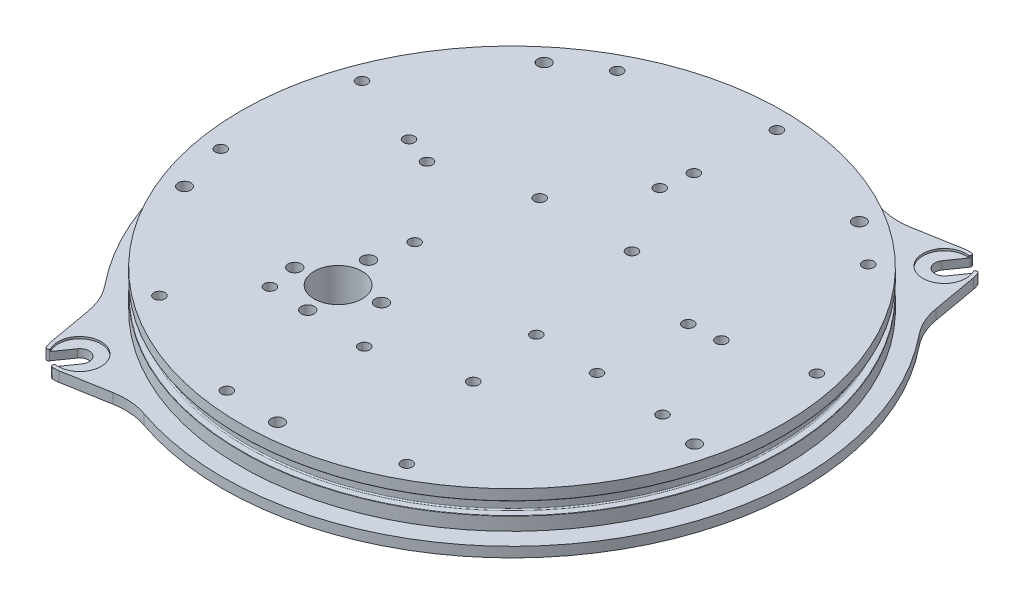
ISO-10303-21;
HEADER;
FILE_DESCRIPTION(('STEP AP214'),'2;1');
FILE_NAME('part.step','',(''),(''),'','','');
FILE_SCHEMA(('AUTOMOTIVE_DESIGN { 1 0 10303 214 1 1 1 1 }'));
ENDSEC;
DATA;
#1=APPLICATION_CONTEXT('core data for automotive mechanical design processes');
#2=APPLICATION_PROTOCOL_DEFINITION('international standard','automotive_design',2000,#1);
#3=PRODUCT_CONTEXT('',#1,'mechanical');
#4=PRODUCT('Part','Part','',(#3));
#5=PRODUCT_RELATED_PRODUCT_CATEGORY('part','',(#4));
#6=PRODUCT_DEFINITION_FORMATION('','',#4);
#7=PRODUCT_DEFINITION_CONTEXT('part definition',#1,'design');
#8=PRODUCT_DEFINITION('design','',#6,#7);
#9=PRODUCT_DEFINITION_SHAPE('','',#8);
#10=(LENGTH_UNIT() NAMED_UNIT(*) SI_UNIT(.MILLI.,.METRE.));
#11=(NAMED_UNIT(*) PLANE_ANGLE_UNIT() SI_UNIT($,.RADIAN.));
#12=(NAMED_UNIT(*) SI_UNIT($,.STERADIAN.) SOLID_ANGLE_UNIT());
#13=UNCERTAINTY_MEASURE_WITH_UNIT(LENGTH_MEASURE(1.E-05),#10,'distance_accuracy_value','');
#14=(GEOMETRIC_REPRESENTATION_CONTEXT(3) GLOBAL_UNCERTAINTY_ASSIGNED_CONTEXT((#13)) GLOBAL_UNIT_ASSIGNED_CONTEXT((#10,
#11,#12)) REPRESENTATION_CONTEXT('',''));
#15=CARTESIAN_POINT('',(0.,0.,0.));
#16=DIRECTION('',(0.,0.,1.));
#17=DIRECTION('',(1.,0.,0.));
#18=AXIS2_PLACEMENT_3D('',#15,#16,#17);
#19=CARTESIAN_POINT('',(0.,13.97,0.));
#20=DIRECTION('',(0.,-1.,0.));
#21=DIRECTION('',(1.,0.,0.));
#22=AXIS2_PLACEMENT_3D('',#19,#20,#21);
#23=PLANE('',#22);
#24=CARTESIAN_POINT('',(-17.4625,13.97,-27.9399999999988));
#25=DIRECTION('',(0.,1.,0.));
#26=DIRECTION('',(0.,0.,1.));
#27=AXIS2_PLACEMENT_3D('',#24,#25,#26);
#28=CIRCLE('',#27,2.0828);
#29=CARTESIAN_POINT('',(-17.4625,13.97,-25.8571999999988));
#30=VERTEX_POINT('',#29);
#31=EDGE_CURVE('E1486',#30,#30,#28,.T.);
#32=ORIENTED_EDGE('',*,*,#31,.F.);
#33=EDGE_LOOP('',(#32));
#34=FACE_BOUND('',#33,.T.);
#35=CARTESIAN_POINT('',(17.4625,13.97,-27.9399999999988));
#36=DIRECTION('',(0.,1.,0.));
#37=DIRECTION('',(0.,0.,1.));
#38=AXIS2_PLACEMENT_3D('',#35,#36,#37);
#39=CIRCLE('',#38,2.0828);
#40=CARTESIAN_POINT('',(17.4625,13.97,-25.8571999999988));
#41=VERTEX_POINT('',#40);
#42=EDGE_CURVE('E333',#41,#41,#39,.T.);
#43=ORIENTED_EDGE('',*,*,#42,.F.);
#44=EDGE_LOOP('',(#43));
#45=FACE_BOUND('',#44,.T.);
#46=CARTESIAN_POINT('',(26.67,13.97,17.4625000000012));
#47=DIRECTION('',(0.,1.,0.));
#48=DIRECTION('',(0.,0.,1.));
#49=AXIS2_PLACEMENT_3D('',#46,#47,#48);
#50=CIRCLE('',#49,2.0828);
#51=CARTESIAN_POINT('',(26.67,13.97,19.5453000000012));
#52=VERTEX_POINT('',#51);
#53=EDGE_CURVE('E354',#52,#52,#50,.T.);
#54=ORIENTED_EDGE('',*,*,#53,.F.);
#55=EDGE_LOOP('',(#54));
#56=FACE_BOUND('',#55,.T.);
#57=CARTESIAN_POINT('',(-26.67,13.97,10.1600000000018));
#58=DIRECTION('',(0.,1.,0.));
#59=DIRECTION('',(0.,0.,1.));
#60=AXIS2_PLACEMENT_3D('',#57,#58,#59);
#61=CIRCLE('',#60,2.0828);
#62=CARTESIAN_POINT('',(-26.67,13.97,12.2428000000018));
#63=VERTEX_POINT('',#62);
#64=EDGE_CURVE('E366',#63,#63,#61,.T.);
#65=ORIENTED_EDGE('',*,*,#64,.F.);
#66=EDGE_LOOP('',(#65));
#67=FACE_BOUND('',#66,.T.);
#68=CARTESIAN_POINT('',(-50.6942593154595,13.97,-18.5308579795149));
#69=DIRECTION('',(0.,1.,0.));
#70=DIRECTION('',(0.,0.,1.));
#71=AXIS2_PLACEMENT_3D('',#68,#69,#70);
#72=CIRCLE('',#71,2.0828);
#73=CARTESIAN_POINT('',(-50.6942593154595,13.97,-16.4480579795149));
#74=VERTEX_POINT('',#73);
#75=EDGE_CURVE('E446',#74,#74,#72,.T.);
#76=ORIENTED_EDGE('',*,*,#75,.F.);
#77=EDGE_LOOP('',(#76));
#78=FACE_BOUND('',#77,.T.);
#79=CARTESIAN_POINT('',(-57.4254275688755,13.97,75.992649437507));
#80=DIRECTION('',(0.,1.,0.));
#81=DIRECTION('',(0.,0.,1.));
#82=AXIS2_PLACEMENT_3D('',#79,#80,#81);
#83=CIRCLE('',#82,2.0828);
#84=CARTESIAN_POINT('',(-57.4254275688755,13.97,78.0754494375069));
#85=VERTEX_POINT('',#84);
#86=EDGE_CURVE('E522',#85,#85,#83,.T.);
#87=ORIENTED_EDGE('',*,*,#86,.F.);
#88=EDGE_LOOP('',(#87));
#89=FACE_BOUND('',#88,.T.);
#90=CARTESIAN_POINT('',(-39.4321269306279,13.97,52.1816192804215));
#91=DIRECTION('',(0.,1.,0.));
#92=DIRECTION('',(0.,0.,1.));
#93=AXIS2_PLACEMENT_3D('',#90,#91,#92);
#94=CIRCLE('',#93,2.0828);
#95=CARTESIAN_POINT('',(-39.4321269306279,13.97,54.2644192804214));
#96=VERTEX_POINT('',#95);
#97=EDGE_CURVE('E534',#96,#96,#94,.T.);
#98=ORIENTED_EDGE('',*,*,#97,.F.);
#99=EDGE_LOOP('',(#98));
#100=FACE_BOUND('',#99,.T.);
#101=CARTESIAN_POINT('',(-61.4295142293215,13.97,-22.4550396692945));
#102=DIRECTION('',(0.,1.,0.));
#103=DIRECTION('',(0.,0.,1.));
#104=AXIS2_PLACEMENT_3D('',#101,#102,#103);
#105=CIRCLE('',#104,2.0828);
#106=CARTESIAN_POINT('',(-61.4295142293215,13.97,-20.3722396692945));
#107=VERTEX_POINT('',#106);
#108=EDGE_CURVE('E549',#107,#107,#105,.T.);
#109=ORIENTED_EDGE('',*,*,#108,.F.);
#110=EDGE_LOOP('',(#109));
#111=FACE_BOUND('',#110,.T.);
#112=CARTESIAN_POINT('',(-89.4604576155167,13.97,-32.7015140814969));
#113=DIRECTION('',(0.,1.,0.));
#114=DIRECTION('',(0.,0.,1.));
#115=AXIS2_PLACEMENT_3D('',#112,#113,#114);
#116=CIRCLE('',#115,2.0828);
#117=CARTESIAN_POINT('',(-89.4604576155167,13.97,-30.6187140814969));
#118=VERTEX_POINT('',#117);
#119=EDGE_CURVE('E565',#118,#118,#116,.T.);
#120=ORIENTED_EDGE('',*,*,#119,.F.);
#121=EDGE_LOOP('',(#120));
#122=FACE_BOUND('',#121,.T.);
#123=CARTESIAN_POINT('',(3.51609526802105,13.97,-65.3104210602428));
#124=DIRECTION('',(0.,1.,0.));
#125=DIRECTION('',(0.,0.,1.));
#126=AXIS2_PLACEMENT_3D('',#123,#124,#125);
#127=CIRCLE('',#126,2.0828);
#128=CARTESIAN_POINT('',(3.51609526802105,13.97,-63.2276210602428));
#129=VERTEX_POINT('',#128);
#130=EDGE_CURVE('E577',#129,#129,#127,.T.);
#131=ORIENTED_EDGE('',*,*,#130,.F.);
#132=EDGE_LOOP('',(#131));
#133=FACE_BOUND('',#132,.T.);
#134=CARTESIAN_POINT('',(5.12052708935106,13.97,-95.1122636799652));
#135=DIRECTION('',(0.,1.,0.));
#136=DIRECTION('',(0.,0.,1.));
#137=AXIS2_PLACEMENT_3D('',#134,#135,#136);
#138=CIRCLE('',#137,2.0828);
#139=CARTESIAN_POINT('',(5.12052708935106,13.97,-93.0294636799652));
#140=VERTEX_POINT('',#139);
#141=EDGE_CURVE('E589',#140,#140,#138,.T.);
#142=ORIENTED_EDGE('',*,*,#141,.F.);
#143=EDGE_LOOP('',(#142));
#144=FACE_BOUND('',#143,.T.);
#145=CARTESIAN_POINT('',(63.4852718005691,13.97,-15.7300441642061));
#146=DIRECTION('',(0.,1.,0.));
#147=DIRECTION('',(0.,0.,1.));
#148=AXIS2_PLACEMENT_3D('',#145,#146,#147);
#149=CIRCLE('',#148,2.0828);
#150=CARTESIAN_POINT('',(63.4852718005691,13.97,-13.6472441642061));
#151=VERTEX_POINT('',#150);
#152=EDGE_CURVE('E601',#151,#151,#149,.T.);
#153=ORIENTED_EDGE('',*,*,#152,.F.);
#154=EDGE_LOOP('',(#153));
#155=FACE_BOUND('',#154,.T.);
#156=CARTESIAN_POINT('',(92.4542793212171,13.97,-22.9078313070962));
#157=DIRECTION('',(0.,1.,0.));
#158=DIRECTION('',(0.,0.,1.));
#159=AXIS2_PLACEMENT_3D('',#156,#157,#158);
#160=CIRCLE('',#159,2.0828);
#161=CARTESIAN_POINT('',(92.4542793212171,13.97,-20.8250313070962));
#162=VERTEX_POINT('',#161);
#163=EDGE_CURVE('E613',#162,#162,#160,.T.);
#164=ORIENTED_EDGE('',*,*,#163,.F.);
#165=EDGE_LOOP('',(#164));
#166=FACE_BOUND('',#165,.T.);
#167=CARTESIAN_POINT('',(76.7283205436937,13.97,19.7747989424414));
#168=DIRECTION('',(0.,1.,0.));
#169=DIRECTION('',(0.,0.,1.));
#170=AXIS2_PLACEMENT_3D('',#167,#168,#169);
#171=CIRCLE('',#170,2.0828);
#172=CARTESIAN_POINT('',(76.7283205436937,13.97,21.8575989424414));
#173=VERTEX_POINT('',#172);
#174=EDGE_CURVE('E625',#173,#173,#171,.T.);
#175=ORIENTED_EDGE('',*,*,#174,.F.);
#176=EDGE_LOOP('',(#175));
#177=FACE_BOUND('',#176,.T.);
#178=CARTESIAN_POINT('',(6.36054956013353,13.97,95.113762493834));
#179=DIRECTION('',(0.,1.,0.));
#180=DIRECTION('',(0.,0.,1.));
#181=AXIS2_PLACEMENT_3D('',#178,#179,#180);
#182=CIRCLE('',#181,2.413);
#183=CARTESIAN_POINT('',(6.36054956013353,13.97,97.526762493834));
#184=VERTEX_POINT('',#183);
#185=EDGE_CURVE('E637',#184,#184,#182,.T.);
#186=ORIENTED_EDGE('',*,*,#185,.F.);
#187=EDGE_LOOP('',(#186));
#188=FACE_BOUND('',#187,.T.);
#189=CARTESIAN_POINT('',(-88.493045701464,13.97,35.4410111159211));
#190=DIRECTION('',(0.,1.,0.));
#191=DIRECTION('',(0.,0.,1.));
#192=AXIS2_PLACEMENT_3D('',#189,#190,#191);
#193=CIRCLE('',#192,2.413);
#194=CARTESIAN_POINT('',(-88.493045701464,13.97,37.8540111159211));
#195=VERTEX_POINT('',#194);
#196=EDGE_CURVE('E652',#195,#195,#193,.T.);
#197=ORIENTED_EDGE('',*,*,#196,.F.);
#198=EDGE_LOOP('',(#197));
#199=FACE_BOUND('',#198,.T.);
#200=CARTESIAN_POINT('',(92.4240815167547,13.97,23.3425269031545));
#201=DIRECTION('',(0.,1.,0.));
#202=DIRECTION('',(0.,0.,1.));
#203=AXIS2_PLACEMENT_3D('',#200,#201,#202);
#204=CIRCLE('',#203,2.413);
#205=CARTESIAN_POINT('',(92.4240815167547,13.97,25.7555269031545));
#206=VERTEX_POINT('',#205);
#207=EDGE_CURVE('E664',#206,#206,#204,.T.);
#208=ORIENTED_EDGE('',*,*,#207,.F.);
#209=EDGE_LOOP('',(#208));
#210=FACE_BOUND('',#209,.T.);
#211=CARTESIAN_POINT('',(-61.0522595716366,13.97,-73.2100130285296));
#212=DIRECTION('',(0.,1.,0.));
#213=DIRECTION('',(0.,0.,1.));
#214=AXIS2_PLACEMENT_3D('',#211,#212,#213);
#215=CIRCLE('',#214,2.41299999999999);
#216=CARTESIAN_POINT('',(-61.0522595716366,13.97,-70.7970130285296));
#217=VERTEX_POINT('',#216);
#218=EDGE_CURVE('E676',#217,#217,#215,.T.);
#219=ORIENTED_EDGE('',*,*,#218,.F.);
#220=EDGE_LOOP('',(#219));
#221=FACE_BOUND('',#220,.T.);
#222=CARTESIAN_POINT('',(50.7606741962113,13.97,-80.6872874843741));
#223=DIRECTION('',(0.,1.,0.));
#224=DIRECTION('',(0.,0.,1.));
#225=AXIS2_PLACEMENT_3D('',#222,#223,#224);
#226=CIRCLE('',#225,2.413);
#227=CARTESIAN_POINT('',(50.7606741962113,13.97,-78.2742874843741));
#228=VERTEX_POINT('',#227);
#229=EDGE_CURVE('E689',#228,#228,#226,.T.);
#230=ORIENTED_EDGE('',*,*,#229,.F.);
#231=EDGE_LOOP('',(#230));
#232=FACE_BOUND('',#231,.T.);
#233=CARTESIAN_POINT('',(-29.5585566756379,13.97,24.756886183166));
#234=DIRECTION('',(0.,1.,0.));
#235=DIRECTION('',(0.,0.,1.));
#236=AXIS2_PLACEMENT_3D('',#233,#234,#235);
#237=CIRCLE('',#236,2.45744999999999);
#238=CARTESIAN_POINT('',(-29.5585566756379,13.97,27.214336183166));
#239=VERTEX_POINT('',#238);
#240=EDGE_CURVE('E701',#239,#239,#237,.T.);
#241=ORIENTED_EDGE('',*,*,#240,.F.);
#242=EDGE_LOOP('',(#241));
#243=FACE_BOUND('',#242,.T.);
#244=CARTESIAN_POINT('',(-41.0449818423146,13.97,41.161201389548));
#245=DIRECTION('',(0.,1.,0.));
#246=DIRECTION('',(0.,0.,1.));
#247=AXIS2_PLACEMENT_3D('',#244,#245,#246);
#248=CIRCLE('',#247,2.45744999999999);
#249=CARTESIAN_POINT('',(-41.0449818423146,13.97,43.618651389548));
#250=VERTEX_POINT('',#249);
#251=EDGE_CURVE('E709',#250,#250,#248,.T.);
#252=ORIENTED_EDGE('',*,*,#251,.F.);
#253=EDGE_LOOP('',(#252));
#254=FACE_BOUND('',#253,.T.);
#255=CARTESIAN_POINT('',(-24.6406666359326,13.97,52.6476265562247));
#256=DIRECTION('',(0.,1.,0.));
#257=DIRECTION('',(0.,0.,1.));
#258=AXIS2_PLACEMENT_3D('',#255,#256,#257);
#259=CIRCLE('',#258,2.45744999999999);
#260=CARTESIAN_POINT('',(-24.6406666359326,13.97,55.1050765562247));
#261=VERTEX_POINT('',#260);
#262=EDGE_CURVE('E717',#261,#261,#259,.T.);
#263=ORIENTED_EDGE('',*,*,#262,.F.);
#264=EDGE_LOOP('',(#263));
#265=FACE_BOUND('',#264,.T.);
#266=CARTESIAN_POINT('',(-13.1542414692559,13.97,36.2433113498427));
#267=DIRECTION('',(0.,1.,0.));
#268=DIRECTION('',(0.,0.,1.));
#269=AXIS2_PLACEMENT_3D('',#266,#267,#268);
#270=CIRCLE('',#269,2.45744999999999);
#271=CARTESIAN_POINT('',(-13.1542414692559,13.97,38.7007613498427));
#272=VERTEX_POINT('',#271);
#273=EDGE_CURVE('E725',#272,#272,#270,.T.);
#274=ORIENTED_EDGE('',*,*,#273,.F.);
#275=EDGE_LOOP('',(#274));
#276=FACE_BOUND('',#275,.T.);
#277=CARTESIAN_POINT('',(-27.0996116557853,13.97,38.7022563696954));
#278=DIRECTION('',(0.,1.,0.));
#279=DIRECTION('',(-1.,0.,0.));
#280=AXIS2_PLACEMENT_3D('',#277,#278,#279);
#281=CIRCLE('',#280,9.0805);
#282=CARTESIAN_POINT('',(-36.1801116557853,13.97,38.7022563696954));
#283=VERTEX_POINT('',#282);
#284=EDGE_CURVE('E789',#283,#283,#281,.T.);
#285=ORIENTED_EDGE('',*,*,#284,.F.);
#286=EDGE_LOOP('',(#285));
#287=FACE_BOUND('',#286,.T.);
#288=CARTESIAN_POINT('',(0.,13.97,0.));
#289=DIRECTION('',(0.,-1.,0.));
#290=DIRECTION('',(1.,0.,0.));
#291=AXIS2_PLACEMENT_3D('',#288,#289,#290);
#292=CIRCLE('',#291,102.5906);
#293=CARTESIAN_POINT('',(102.5906,13.97,0.));
#294=VERTEX_POINT('',#293);
#295=EDGE_CURVE('E1359',#294,#294,#292,.T.);
#296=ORIENTED_EDGE('',*,*,#295,.F.);
#297=EDGE_LOOP('',(#296));
#298=FACE_BOUND('',#297,.T.);
#299=CARTESIAN_POINT('',(-93.927860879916,13.97,16.2678012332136));
#300=DIRECTION('',(0.,1.,0.));
#301=DIRECTION('',(0.,0.,1.));
#302=AXIS2_PLACEMENT_3D('',#299,#300,#301);
#303=CIRCLE('',#302,2.0828);
#304=CARTESIAN_POINT('',(-93.927860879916,13.97,18.3506012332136));
#305=VERTEX_POINT('',#304);
#306=EDGE_CURVE('E510',#305,#305,#303,.T.);
#307=ORIENTED_EDGE('',*,*,#306,.F.);
#308=EDGE_LOOP('',(#307));
#309=FACE_BOUND('',#308,.T.);
#310=CARTESIAN_POINT('',(-44.4969036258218,13.97,-84.3036771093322));
#311=DIRECTION('',(0.,1.,0.));
#312=DIRECTION('',(0.,0.,1.));
#313=AXIS2_PLACEMENT_3D('',#310,#311,#312);
#314=CIRCLE('',#313,2.0828);
#315=CARTESIAN_POINT('',(-44.4969036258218,13.97,-82.2208771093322));
#316=VERTEX_POINT('',#315);
#317=EDGE_CURVE('E498',#316,#316,#314,.T.);
#318=ORIENTED_EDGE('',*,*,#317,.F.);
#319=EDGE_LOOP('',(#318));
#320=FACE_BOUND('',#319,.T.);
#321=CARTESIAN_POINT('',(66.42726204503,13.97,-68.3703390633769));
#322=DIRECTION('',(0.,1.,0.));
#323=DIRECTION('',(0.,0.,1.));
#324=AXIS2_PLACEMENT_3D('',#321,#322,#323);
#325=CIRCLE('',#324,2.0828);
#326=CARTESIAN_POINT('',(66.42726204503,13.97,-66.287539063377));
#327=VERTEX_POINT('',#326);
#328=EDGE_CURVE('E486',#327,#327,#325,.T.);
#329=ORIENTED_EDGE('',*,*,#328,.F.);
#330=EDGE_LOOP('',(#329));
#331=FACE_BOUND('',#330,.T.);
#332=CARTESIAN_POINT('',(44.4969036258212,13.97,84.3036771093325));
#333=DIRECTION('',(0.,1.,0.));
#334=DIRECTION('',(0.,0.,1.));
#335=AXIS2_PLACEMENT_3D('',#332,#333,#334);
#336=CIRCLE('',#335,2.0828);
#337=CARTESIAN_POINT('',(44.4969036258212,13.97,86.3864771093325));
#338=VERTEX_POINT('',#337);
#339=EDGE_CURVE('E474',#338,#338,#336,.T.);
#340=ORIENTED_EDGE('',*,*,#339,.F.);
#341=EDGE_LOOP('',(#340));
#342=FACE_BOUND('',#341,.T.);
#343=CARTESIAN_POINT('',(-13.5537068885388,13.97,94.3577311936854));
#344=DIRECTION('',(0.,1.,0.));
#345=DIRECTION('',(0.,0.,1.));
#346=AXIS2_PLACEMENT_3D('',#343,#344,#345);
#347=CIRCLE('',#346,2.0828);
#348=CARTESIAN_POINT('',(-13.5537068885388,13.97,96.4405311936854));
#349=VERTEX_POINT('',#348);
#350=EDGE_CURVE('E462',#349,#349,#347,.T.);
#351=ORIENTED_EDGE('',*,*,#350,.F.);
#352=EDGE_LOOP('',(#351));
#353=FACE_BOUND('',#352,.T.);
#354=CARTESIAN_POINT('',(1.95850558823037,13.97,-53.9394556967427));
#355=DIRECTION('',(0.,1.,0.));
#356=DIRECTION('',(0.,0.,1.));
#357=AXIS2_PLACEMENT_3D('',#354,#355,#356);
#358=CIRCLE('',#357,2.0828);
#359=CARTESIAN_POINT('',(1.95850558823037,13.97,-51.8566556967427));
#360=VERTEX_POINT('',#359);
#361=EDGE_CURVE('E434',#360,#360,#358,.T.);
#362=ORIENTED_EDGE('',*,*,#361,.F.);
#363=EDGE_LOOP('',(#362));
#364=FACE_BOUND('',#363,.T.);
#365=CARTESIAN_POINT('',(51.9046823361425,13.97,-14.805558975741));
#366=DIRECTION('',(0.,1.,0.));
#367=DIRECTION('',(0.,0.,1.));
#368=AXIS2_PLACEMENT_3D('',#365,#366,#367);
#369=CIRCLE('',#368,2.0828);
#370=CARTESIAN_POINT('',(51.9046823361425,13.97,-12.722758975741));
#371=VERTEX_POINT('',#370);
#372=EDGE_CURVE('E422',#371,#371,#369,.T.);
#373=ORIENTED_EDGE('',*,*,#372,.F.);
#374=EDGE_LOOP('',(#373));
#375=FACE_BOUND('',#374,.T.);
#376=CARTESIAN_POINT('',(50.6942593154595,13.97,18.5308579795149));
#377=DIRECTION('',(0.,1.,0.));
#378=DIRECTION('',(0.,0.,1.));
#379=AXIS2_PLACEMENT_3D('',#376,#377,#378);
#380=CIRCLE('',#379,2.0828);
#381=CARTESIAN_POINT('',(50.6942593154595,13.97,20.6136579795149));
#382=VERTEX_POINT('',#381);
#383=EDGE_CURVE('E410',#382,#382,#380,.T.);
#384=ORIENTED_EDGE('',*,*,#383,.F.);
#385=EDGE_LOOP('',(#384));
#386=FACE_BOUND('',#385,.T.);
#387=CARTESIAN_POINT('',(30.1203522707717,13.97,44.7891170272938));
#388=DIRECTION('',(0.,1.,0.));
#389=DIRECTION('',(0.,0.,1.));
#390=AXIS2_PLACEMENT_3D('',#387,#388,#389);
#391=CIRCLE('',#390,2.0828);
#392=CARTESIAN_POINT('',(30.1203522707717,13.97,46.8719170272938));
#393=VERTEX_POINT('',#392);
#394=EDGE_CURVE('E398',#393,#393,#391,.T.);
#395=ORIENTED_EDGE('',*,*,#394,.F.);
#396=EDGE_LOOP('',(#395));
#397=FACE_BOUND('',#396,.T.);
#398=CARTESIAN_POINT('',(-1.95850558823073,13.97,53.9394556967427));
#399=DIRECTION('',(0.,1.,0.));
#400=DIRECTION('',(0.,0.,1.));
#401=AXIS2_PLACEMENT_3D('',#398,#399,#400);
#402=CIRCLE('',#401,2.0828);
#403=CARTESIAN_POINT('',(-1.95850558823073,13.97,56.0222556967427));
#404=VERTEX_POINT('',#403);
#405=EDGE_CURVE('E382',#404,#404,#402,.T.);
#406=ORIENTED_EDGE('',*,*,#405,.F.);
#407=EDGE_LOOP('',(#406));
#408=FACE_BOUND('',#407,.T.);
#409=ADVANCED_FACE('F43',(#34,#45,#56,#67,#78,#89,#100,#111,#122,#133,#144,#155,#166,#177,#188,
#199,#210,#221,#232,#243,#254,#265,#276,#287,#298,#309,#320,#331,#342,#353,#364,#375,#386,#397,
#408),#23,.F.);
#410=CARTESIAN_POINT('',(70.3068005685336,13.97,-94.1811430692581));
#411=DIRECTION('',(0.819152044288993,0.,0.573576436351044));
#412=DIRECTION('',(0.573576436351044,0.,-0.819152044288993));
#413=AXIS2_PLACEMENT_3D('',#410,#411,#412);
#414=PLANE('',#413);
#415=DIRECTION('',(0.,1.,0.));
#416=VECTOR('',#415,1.);
#417=CARTESIAN_POINT('',(74.4945407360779,-0.762,-100.16185584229));
#418=LINE('',#417,#416);
#419=CARTESIAN_POINT('',(74.4945407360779,0.,-100.16185584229));
#420=VERTEX_POINT('',#419);
#421=CARTESIAN_POINT('',(74.4945407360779,-0.762,-100.16185584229));
#422=VERTEX_POINT('',#421);
#423=EDGE_CURVE('E743',#420,#422,#418,.F.);
#424=ORIENTED_EDGE('',*,*,#423,.F.);
#425=DIRECTION('',(-0.573576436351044,0.,0.819152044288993));
#426=VECTOR('',#425,1.);
#427=CARTESIAN_POINT('',(-30.8253654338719,0.,50.2505582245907));
#428=LINE('',#427,#426);
#429=CARTESIAN_POINT('',(74.6438897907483,0.,-100.375148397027));
#430=VERTEX_POINT('',#429);
#431=EDGE_CURVE('E1280',#430,#420,#428,.T.);
#432=ORIENTED_EDGE('',*,*,#431,.F.);
#433=CARTESIAN_POINT('',(74.6438897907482,-4.00050000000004,-100.375148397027));
#434=CARTESIAN_POINT('',(74.6438897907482,-2.60350000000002,-100.375148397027));
#435=CARTESIAN_POINT('',(74.6438897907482,-1.20649999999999,-100.375148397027));
#436=CARTESIAN_POINT('',(74.6438897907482,0.190500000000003,-100.375148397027));
#437=(BOUNDED_CURVE() B_SPLINE_CURVE(3,(#433,#434,#435,#436),.UNSPECIFIED.,.F.,
.F.) B_SPLINE_CURVE_WITH_KNOTS((4,4),(0.0613971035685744,0.0655881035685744),
.UNSPECIFIED.) CURVE() GEOMETRIC_REPRESENTATION_ITEM() RATIONAL_B_SPLINE_CURVE((1.,1.,1.,1.)) REPRESENTATION_ITEM(''));
#438=CARTESIAN_POINT('',(74.6438897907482,-3.81,-100.375148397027));
#439=VERTEX_POINT('',#438);
#440=EDGE_CURVE('E1060',#430,#439,#437,.F.);
#441=ORIENTED_EDGE('',*,*,#440,.T.);
#442=DIRECTION('',(-0.573576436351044,0.,0.819152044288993));
#443=VECTOR('',#442,1.);
#444=CARTESIAN_POINT('',(70.3068005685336,-3.81,-94.1811430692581));
#445=LINE('',#444,#443);
#446=CARTESIAN_POINT('',(70.3068005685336,-3.81,-94.1811430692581));
#447=VERTEX_POINT('',#446);
#448=EDGE_CURVE('E1110',#439,#447,#445,.T.);
#449=ORIENTED_EDGE('',*,*,#448,.T.);
#450=DIRECTION('',(0.,-1.,0.));
#451=VECTOR('',#450,1.);
#452=CARTESIAN_POINT('',(70.3068005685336,61.5876035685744,-94.1811430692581));
#453=LINE('',#452,#451);
#454=CARTESIAN_POINT('',(70.3068005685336,-0.761999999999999,-94.1811430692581));
#455=VERTEX_POINT('',#454);
#456=EDGE_CURVE('E1356',#447,#455,#453,.F.);
#457=ORIENTED_EDGE('',*,*,#456,.T.);
#458=DIRECTION('',(0.573576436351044,0.,-0.819152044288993));
#459=VECTOR('',#458,1.);
#460=CARTESIAN_POINT('',(70.3068005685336,-0.762000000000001,-94.1811430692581));
#461=LINE('',#460,#459);
#462=EDGE_CURVE('E740',#455,#422,#461,.T.);
#463=ORIENTED_EDGE('',*,*,#462,.T.);
#464=EDGE_LOOP('',(#424,#432,#441,#449,#457,#463));
#465=FACE_BOUND('',#464,.T.);
#466=ADVANCED_FACE('F836',(#465),#414,.F.);
#467=CARTESIAN_POINT('',(64.4549831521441,13.97,-98.2786297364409));
#468=DIRECTION('',(-0.819152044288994,0.,-0.573576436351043));
#469=DIRECTION('',(-0.573576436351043,0.,0.819152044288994));
#470=AXIS2_PLACEMENT_3D('',#467,#468,#469);
#471=PLANE('',#470);
#472=DIRECTION('',(0.,1.,0.));
#473=VECTOR('',#472,1.);
#474=CARTESIAN_POINT('',(68.6427233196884,-0.762,-104.259342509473));
#475=LINE('',#474,#473);
#476=CARTESIAN_POINT('',(68.6427233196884,-0.762,-104.259342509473));
#477=VERTEX_POINT('',#476);
#478=CARTESIAN_POINT('',(68.6427233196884,0.,-104.259342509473));
#479=VERTEX_POINT('',#478);
#480=EDGE_CURVE('E11',#477,#479,#475,.T.);
#481=ORIENTED_EDGE('',*,*,#480,.F.);
#482=DIRECTION('',(-0.573576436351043,0.,0.819152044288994));
#483=VECTOR('',#482,1.);
#484=CARTESIAN_POINT('',(64.4549831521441,-0.762000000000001,-98.2786297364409));
#485=LINE('',#484,#483);
#486=CARTESIAN_POINT('',(64.4549831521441,-0.761999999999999,-98.2786297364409));
#487=VERTEX_POINT('',#486);
#488=EDGE_CURVE('E54',#477,#487,#485,.T.);
#489=ORIENTED_EDGE('',*,*,#488,.T.);
#490=DIRECTION('',(0.,-1.,0.));
#491=VECTOR('',#490,1.);
#492=CARTESIAN_POINT('',(64.4549831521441,61.5876035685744,-98.2786297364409));
#493=LINE('',#492,#491);
#494=CARTESIAN_POINT('',(64.4549831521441,-3.81,-98.2786297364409));
#495=VERTEX_POINT('',#494);
#496=EDGE_CURVE('E1358',#495,#487,#493,.F.);
#497=ORIENTED_EDGE('',*,*,#496,.F.);
#498=DIRECTION('',(0.573576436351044,0.,-0.819152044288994));
#499=VECTOR('',#498,1.);
#500=CARTESIAN_POINT('',(64.4549831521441,-3.81,-98.2786297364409));
#501=LINE('',#500,#499);
#502=CARTESIAN_POINT('',(68.7920723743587,-3.81,-104.472635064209));
#503=VERTEX_POINT('',#502);
#504=EDGE_CURVE('E1347',#495,#503,#501,.T.);
#505=ORIENTED_EDGE('',*,*,#504,.T.);
#506=CARTESIAN_POINT('',(68.7920723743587,0.190500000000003,-104.472635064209));
#507=CARTESIAN_POINT('',(68.7920723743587,-1.20649999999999,-104.472635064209));
#508=CARTESIAN_POINT('',(68.7920723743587,-2.60350000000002,-104.472635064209));
#509=CARTESIAN_POINT('',(68.7920723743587,-4.00050000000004,-104.472635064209));
#510=(BOUNDED_CURVE() B_SPLINE_CURVE(3,(#506,#507,#508,#509),.UNSPECIFIED.,.F.,
.F.) B_SPLINE_CURVE_WITH_KNOTS((4,4),(0.0613971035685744,0.0655881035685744),
.UNSPECIFIED.) CURVE() GEOMETRIC_REPRESENTATION_ITEM() RATIONAL_B_SPLINE_CURVE((1.,1.,1.,1.)) REPRESENTATION_ITEM(''));
#511=CARTESIAN_POINT('',(68.7920723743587,0.,-104.472635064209));
#512=VERTEX_POINT('',#511);
#513=EDGE_CURVE('E1364',#503,#512,#510,.F.);
#514=ORIENTED_EDGE('',*,*,#513,.T.);
#515=DIRECTION('',(0.573576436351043,0.,-0.819152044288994));
#516=VECTOR('',#515,1.);
#517=CARTESIAN_POINT('',(-36.6771828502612,0.,46.1530715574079));
#518=LINE('',#517,#516);
#519=EDGE_CURVE('E1100',#479,#512,#518,.T.);
#520=ORIENTED_EDGE('',*,*,#519,.F.);
#521=EDGE_LOOP('',(#481,#489,#497,#505,#514,#520));
#522=FACE_BOUND('',#521,.T.);
#523=ADVANCED_FACE('F830',(#522),#471,.F.);
#524=CARTESIAN_POINT('',(-71.8611763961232,13.97,108.855769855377));
#525=DIRECTION('',(0.819152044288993,0.,0.573576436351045));
#526=DIRECTION('',(0.573576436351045,0.,-0.819152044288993));
#527=AXIS2_PLACEMENT_3D('',#524,#525,#526);
#528=PLANE('',#527);
#529=DIRECTION('',(0.,1.,0.));
#530=VECTOR('',#529,1.);
#531=CARTESIAN_POINT('',(-68.6427233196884,-0.762,104.259342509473));
#532=LINE('',#531,#530);
#533=CARTESIAN_POINT('',(-68.6427233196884,-0.762,104.259342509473));
#534=VERTEX_POINT('',#533);
#535=CARTESIAN_POINT('',(-68.6427233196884,0.,104.259342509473));
#536=VERTEX_POINT('',#535);
#537=EDGE_CURVE('E755',#534,#536,#532,.T.);
#538=ORIENTED_EDGE('',*,*,#537,.F.);
#539=DIRECTION('',(0.573576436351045,0.,-0.819152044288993));
#540=VECTOR('',#539,1.);
#541=CARTESIAN_POINT('',(-71.8611763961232,-0.762000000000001,108.855769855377));
#542=LINE('',#541,#540);
#543=CARTESIAN_POINT('',(-64.4549831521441,-0.761999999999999,98.2786297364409));
#544=VERTEX_POINT('',#543);
#545=EDGE_CURVE('E752',#534,#544,#542,.T.);
#546=ORIENTED_EDGE('',*,*,#545,.T.);
#547=DIRECTION('',(0.,-1.,0.));
#548=VECTOR('',#547,1.);
#549=CARTESIAN_POINT('',(-64.4549831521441,61.5876035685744,98.2786297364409));
#550=LINE('',#549,#548);
#551=CARTESIAN_POINT('',(-64.4549831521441,-3.81,98.2786297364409));
#552=VERTEX_POINT('',#551);
#553=EDGE_CURVE('E1368',#552,#544,#550,.F.);
#554=ORIENTED_EDGE('',*,*,#553,.F.);
#555=DIRECTION('',(-0.573576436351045,0.,0.819152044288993));
#556=VECTOR('',#555,1.);
#557=CARTESIAN_POINT('',(-71.8611763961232,-3.81,108.855769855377));
#558=LINE('',#557,#556);
#559=CARTESIAN_POINT('',(-68.7920723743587,-3.81,104.472635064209));
#560=VERTEX_POINT('',#559);
#561=EDGE_CURVE('E799',#552,#560,#558,.T.);
#562=ORIENTED_EDGE('',*,*,#561,.T.);
#563=CARTESIAN_POINT('',(-68.7920723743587,0.190500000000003,104.472635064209));
#564=CARTESIAN_POINT('',(-68.7920723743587,-1.20649999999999,104.472635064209));
#565=CARTESIAN_POINT('',(-68.7920723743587,-2.60350000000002,104.472635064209));
#566=CARTESIAN_POINT('',(-68.7920723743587,-4.00050000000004,104.472635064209));
#567=(BOUNDED_CURVE() B_SPLINE_CURVE(3,(#563,#564,#565,#566),.UNSPECIFIED.,.F.,
.F.) B_SPLINE_CURVE_WITH_KNOTS((4,4),(0.0613971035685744,0.0655881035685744),
.UNSPECIFIED.) CURVE() GEOMETRIC_REPRESENTATION_ITEM() RATIONAL_B_SPLINE_CURVE((1.,1.,1.,1.)) REPRESENTATION_ITEM(''));
#568=CARTESIAN_POINT('',(-68.7920723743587,0.,104.472635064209));
#569=VERTEX_POINT('',#568);
#570=EDGE_CURVE('E811',#560,#569,#567,.F.);
#571=ORIENTED_EDGE('',*,*,#570,.T.);
#572=DIRECTION('',(-0.573576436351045,0.,0.819152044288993));
#573=VECTOR('',#572,1.);
#574=CARTESIAN_POINT('',(-30.8253654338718,0.,50.2505582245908));
#575=LINE('',#574,#573);
#576=EDGE_CURVE('E1097',#536,#569,#575,.T.);
#577=ORIENTED_EDGE('',*,*,#576,.F.);
#578=EDGE_LOOP('',(#538,#546,#554,#562,#571,#577));
#579=FACE_BOUND('',#578,.T.);
#580=ADVANCED_FACE('F819',(#579),#528,.F.);
#581=CARTESIAN_POINT('',(-77.7129938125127,13.97,104.758283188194));
#582=DIRECTION('',(-0.819152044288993,0.,-0.573576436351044));
#583=DIRECTION('',(-0.573576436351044,0.,0.819152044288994));
#584=AXIS2_PLACEMENT_3D('',#581,#582,#583);
#585=PLANE('',#584);
#586=DIRECTION('',(0.,1.,0.));
#587=VECTOR('',#586,1.);
#588=CARTESIAN_POINT('',(-74.4945407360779,-0.762,100.16185584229));
#589=LINE('',#588,#587);
#590=CARTESIAN_POINT('',(-74.4945407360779,0.,100.16185584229));
#591=VERTEX_POINT('',#590);
#592=CARTESIAN_POINT('',(-74.4945407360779,-0.762,100.16185584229));
#593=VERTEX_POINT('',#592);
#594=EDGE_CURVE('E1095',#591,#593,#589,.F.);
#595=ORIENTED_EDGE('',*,*,#594,.F.);
#596=DIRECTION('',(0.573576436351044,0.,-0.819152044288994));
#597=VECTOR('',#596,1.);
#598=CARTESIAN_POINT('',(-36.6771828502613,0.,46.1530715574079));
#599=LINE('',#598,#597);
#600=CARTESIAN_POINT('',(-74.6438897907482,0.,100.375148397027));
#601=VERTEX_POINT('',#600);
#602=EDGE_CURVE('E1099',#601,#591,#599,.T.);
#603=ORIENTED_EDGE('',*,*,#602,.F.);
#604=CARTESIAN_POINT('',(-74.6438897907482,-4.00050000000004,100.375148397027));
#605=CARTESIAN_POINT('',(-74.6438897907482,-2.60350000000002,100.375148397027));
#606=CARTESIAN_POINT('',(-74.6438897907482,-1.20649999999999,100.375148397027));
#607=CARTESIAN_POINT('',(-74.6438897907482,0.190500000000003,100.375148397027));
#608=(BOUNDED_CURVE() B_SPLINE_CURVE(3,(#604,#605,#606,#607),.UNSPECIFIED.,.F.,
.F.) B_SPLINE_CURVE_WITH_KNOTS((4,4),(0.0613971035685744,0.0655881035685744),
.UNSPECIFIED.) CURVE() GEOMETRIC_REPRESENTATION_ITEM() RATIONAL_B_SPLINE_CURVE((1.,1.,1.,1.)) REPRESENTATION_ITEM(''));
#609=CARTESIAN_POINT('',(-74.6438897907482,-3.81,100.375148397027));
#610=VERTEX_POINT('',#609);
#611=EDGE_CURVE('E967',#601,#610,#608,.F.);
#612=ORIENTED_EDGE('',*,*,#611,.T.);
#613=DIRECTION('',(0.573576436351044,0.,-0.819152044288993));
#614=VECTOR('',#613,1.);
#615=CARTESIAN_POINT('',(-77.7129938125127,-3.81,104.758283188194));
#616=LINE('',#615,#614);
#617=CARTESIAN_POINT('',(-70.3068005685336,-3.81,94.1811430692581));
#618=VERTEX_POINT('',#617);
#619=EDGE_CURVE('E803',#610,#618,#616,.T.);
#620=ORIENTED_EDGE('',*,*,#619,.T.);
#621=DIRECTION('',(0.,-1.,0.));
#622=VECTOR('',#621,1.);
#623=CARTESIAN_POINT('',(-70.3068005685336,61.5876035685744,94.1811430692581));
#624=LINE('',#623,#622);
#625=CARTESIAN_POINT('',(-70.3068005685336,-0.762000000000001,94.1811430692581));
#626=VERTEX_POINT('',#625);
#627=EDGE_CURVE('E804',#618,#626,#624,.F.);
#628=ORIENTED_EDGE('',*,*,#627,.T.);
#629=DIRECTION('',(-0.573576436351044,0.,0.819152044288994));
#630=VECTOR('',#629,1.);
#631=CARTESIAN_POINT('',(-77.7129938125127,-0.762000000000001,104.758283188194));
#632=LINE('',#631,#630);
#633=EDGE_CURVE('E1092',#626,#593,#632,.T.);
#634=ORIENTED_EDGE('',*,*,#633,.T.);
#635=EDGE_LOOP('',(#595,#603,#612,#620,#628,#634));
#636=FACE_BOUND('',#635,.T.);
#637=ADVANCED_FACE('F829',(#636),#585,.F.);
#638=CARTESIAN_POINT('',(-109.537499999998,-3.81,0.));
#639=DIRECTION('',(0.,1.,0.));
#640=DIRECTION('',(-1.,0.,0.));
#641=AXIS2_PLACEMENT_3D('',#638,#639,#640);
#642=PLANE('',#641);
#643=CARTESIAN_POINT('',(-29.5585566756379,-3.81,24.756886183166));
#644=DIRECTION('',(0.,1.,0.));
#645=DIRECTION('',(-1.,0.,0.));
#646=AXIS2_PLACEMENT_3D('',#643,#644,#645);
#647=CIRCLE('',#646,2.45744999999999);
#648=CARTESIAN_POINT('',(-32.0160066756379,-3.81,24.756886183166));
#649=VERTEX_POINT('',#648);
#650=EDGE_CURVE('E705',#649,#649,#647,.T.);
#651=ORIENTED_EDGE('',*,*,#650,.T.);
#652=EDGE_LOOP('',(#651));
#653=FACE_BOUND('',#652,.T.);
#654=CARTESIAN_POINT('',(-41.0449818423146,-3.81,41.161201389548));
#655=DIRECTION('',(0.,1.,0.));
#656=DIRECTION('',(-1.,0.,0.));
#657=AXIS2_PLACEMENT_3D('',#654,#655,#656);
#658=CIRCLE('',#657,2.45744999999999);
#659=CARTESIAN_POINT('',(-43.5024318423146,-3.81,41.161201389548));
#660=VERTEX_POINT('',#659);
#661=EDGE_CURVE('E713',#660,#660,#658,.T.);
#662=ORIENTED_EDGE('',*,*,#661,.T.);
#663=EDGE_LOOP('',(#662));
#664=FACE_BOUND('',#663,.T.);
#665=CARTESIAN_POINT('',(-24.6406666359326,-3.81,52.6476265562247));
#666=DIRECTION('',(0.,1.,0.));
#667=DIRECTION('',(-1.,0.,0.));
#668=AXIS2_PLACEMENT_3D('',#665,#666,#667);
#669=CIRCLE('',#668,2.45744999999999);
#670=CARTESIAN_POINT('',(-27.0981166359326,-3.81,52.6476265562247));
#671=VERTEX_POINT('',#670);
#672=EDGE_CURVE('E721',#671,#671,#669,.T.);
#673=ORIENTED_EDGE('',*,*,#672,.T.);
#674=EDGE_LOOP('',(#673));
#675=FACE_BOUND('',#674,.T.);
#676=CARTESIAN_POINT('',(-13.1542414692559,-3.81,36.2433113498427));
#677=DIRECTION('',(0.,1.,0.));
#678=DIRECTION('',(-1.,0.,0.));
#679=AXIS2_PLACEMENT_3D('',#676,#677,#678);
#680=CIRCLE('',#679,2.45744999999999);
#681=CARTESIAN_POINT('',(-15.6116914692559,-3.81,36.2433113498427));
#682=VERTEX_POINT('',#681);
#683=EDGE_CURVE('E729',#682,#682,#680,.T.);
#684=ORIENTED_EDGE('',*,*,#683,.T.);
#685=EDGE_LOOP('',(#684));
#686=FACE_BOUND('',#685,.T.);
#687=CARTESIAN_POINT('',(-27.0996116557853,-3.81,38.7022563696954));
#688=DIRECTION('',(0.,1.,0.));
#689=DIRECTION('',(-1.,0.,0.));
#690=AXIS2_PLACEMENT_3D('',#687,#688,#689);
#691=CIRCLE('',#690,9.0805);
#692=CARTESIAN_POINT('',(-36.1801116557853,-3.81,38.7022563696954));
#693=VERTEX_POINT('',#692);
#694=EDGE_CURVE('E793',#693,#693,#691,.T.);
#695=ORIENTED_EDGE('',*,*,#694,.T.);
#696=EDGE_LOOP('',(#695));
#697=FACE_BOUND('',#696,.T.);
#698=CARTESIAN_POINT('',(-27.0996116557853,-3.81,38.7022563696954));
#699=DIRECTION('',(0.,1.,0.));
#700=DIRECTION('',(-1.,0.,0.));
#701=AXIS2_PLACEMENT_3D('',#698,#699,#700);
#702=CIRCLE('',#701,18.7198);
#703=CARTESIAN_POINT('',(-45.8194116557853,-3.81,38.7022563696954));
#704=VERTEX_POINT('',#703);
#705=EDGE_CURVE('E785',#704,#704,#702,.T.);
#706=ORIENTED_EDGE('',*,*,#705,.F.);
#707=EDGE_LOOP('',(#706));
#708=FACE_BOUND('',#707,.T.);
#709=ADVANCED_FACE('F1219',(#653,#664,#675,#686,#697,#708),#642,.F.);
#710=CARTESIAN_POINT('',(-67.3808918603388,61.5876035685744,96.2298864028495));
#711=DIRECTION('',(0.,-1.,0.));
#712=DIRECTION('',(1.,0.,0.));
#713=AXIS2_PLACEMENT_3D('',#710,#711,#712);
#714=CYLINDRICAL_SURFACE('',#713,9.52500000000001);
#715=CARTESIAN_POINT('',(-67.3808918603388,-3.81,96.2298864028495));
#716=DIRECTION('',(0.,-1.,0.));
#717=DIRECTION('',(-1.,0.,0.));
#718=AXIS2_PLACEMENT_3D('',#715,#716,#717);
#719=CIRCLE('',#718,9.52500000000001);
#720=CARTESIAN_POINT('',(-76.0134735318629,-3.81,100.25532534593));
#721=VERTEX_POINT('',#720);
#722=CARTESIAN_POINT('',(-76.7611857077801,-3.81,97.883885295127));
#723=VERTEX_POINT('',#722);
#724=EDGE_CURVE('E1137',#721,#723,#719,.T.);
#725=ORIENTED_EDGE('',*,*,#724,.F.);
#726=CARTESIAN_POINT('',(-76.0134735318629,0.190500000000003,100.25532534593));
#727=CARTESIAN_POINT('',(-76.0134735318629,-1.20649999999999,100.25532534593));
#728=CARTESIAN_POINT('',(-76.0134735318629,-2.60350000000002,100.25532534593));
#729=CARTESIAN_POINT('',(-76.0134735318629,-4.00050000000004,100.25532534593));
#730=(BOUNDED_CURVE() B_SPLINE_CURVE(3,(#726,#727,#728,#729),.UNSPECIFIED.,.F.,
.F.) B_SPLINE_CURVE_WITH_KNOTS((4,4),(0.0613971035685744,0.0655881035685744),
.UNSPECIFIED.) CURVE() GEOMETRIC_REPRESENTATION_ITEM() RATIONAL_B_SPLINE_CURVE((1.,1.,1.,1.)) REPRESENTATION_ITEM(''));
#731=CARTESIAN_POINT('',(-76.0134735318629,0.,100.25532534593));
#732=VERTEX_POINT('',#731);
#733=EDGE_CURVE('E987',#721,#732,#730,.F.);
#734=ORIENTED_EDGE('',*,*,#733,.T.);
#735=CARTESIAN_POINT('',(-67.3808918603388,0.,96.2298864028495));
#736=DIRECTION('',(0.,-1.,0.));
#737=DIRECTION('',(1.,0.,0.));
#738=AXIS2_PLACEMENT_3D('',#735,#736,#737);
#739=CIRCLE('',#738,9.52500000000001);
#740=CARTESIAN_POINT('',(-76.7611857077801,0.,97.883885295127));
#741=VERTEX_POINT('',#740);
#742=EDGE_CURVE('E816',#741,#732,#739,.F.);
#743=ORIENTED_EDGE('',*,*,#742,.F.);
#744=DIRECTION('',(0.,-1.,0.));
#745=VECTOR('',#744,1.);
#746=CARTESIAN_POINT('',(-76.7611857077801,61.5876035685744,97.883885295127));
#747=LINE('',#746,#745);
#748=EDGE_CURVE('E1248',#741,#723,#747,.T.);
#749=ORIENTED_EDGE('',*,*,#748,.T.);
#750=EDGE_LOOP('',(#725,#734,#743,#749));
#751=FACE_BOUND('',#750,.T.);
#752=ADVANCED_FACE('F1174',(#751),#714,.T.);
#753=CARTESIAN_POINT('',(-67.3808918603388,61.5876035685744,96.2298864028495));
#754=DIRECTION('',(0.,-1.,0.));
#755=DIRECTION('',(1.,0.,0.));
#756=AXIS2_PLACEMENT_3D('',#753,#754,#755);
#757=CYLINDRICAL_SURFACE('',#756,3.57187499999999);
#758=ORIENTED_EDGE('',*,*,#553,.T.);
#759=CARTESIAN_POINT('',(-67.3808918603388,-0.761999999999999,96.2298864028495));
#760=DIRECTION('',(0.,-1.,0.));
#761=DIRECTION('',(1.,0.,0.));
#762=AXIS2_PLACEMENT_3D('',#759,#760,#761);
#763=CIRCLE('',#762,3.57187499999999);
#764=EDGE_CURVE('E747',#544,#626,#763,.F.);
#765=ORIENTED_EDGE('',*,*,#764,.T.);
#766=ORIENTED_EDGE('',*,*,#627,.F.);
#767=CARTESIAN_POINT('',(-67.3808918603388,-3.81,96.2298864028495));
#768=DIRECTION('',(0.,-1.,0.));
#769=DIRECTION('',(-1.,0.,0.));
#770=AXIS2_PLACEMENT_3D('',#767,#768,#769);
#771=CIRCLE('',#770,3.57187499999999);
#772=EDGE_CURVE('E1128',#618,#552,#771,.T.);
#773=ORIENTED_EDGE('',*,*,#772,.T.);
#774=EDGE_LOOP('',(#758,#765,#766,#773));
#775=FACE_BOUND('',#774,.T.);
#776=ADVANCED_FACE('F1472',(#775),#757,.F.);
#777=CARTESIAN_POINT('',(67.3808918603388,61.5876035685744,-96.2298864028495));
#778=DIRECTION('',(0.,-1.,0.));
#779=DIRECTION('',(1.,0.,0.));
#780=AXIS2_PLACEMENT_3D('',#777,#778,#779);
#781=CYLINDRICAL_SURFACE('',#780,9.52500000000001);
#782=CARTESIAN_POINT('',(67.3808918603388,0.,-96.2298864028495));
#783=DIRECTION('',(0.,-1.,0.));
#784=DIRECTION('',(1.,0.,0.));
#785=AXIS2_PLACEMENT_3D('',#782,#783,#784);
#786=CIRCLE('',#785,9.52500000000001);
#787=CARTESIAN_POINT('',(68.2110503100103,0.,-105.718640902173));
#788=VERTEX_POINT('',#787);
#789=CARTESIAN_POINT('',(65.7268929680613,0.,-105.610180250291));
#790=VERTEX_POINT('',#789);
#791=EDGE_CURVE('E1277',#788,#790,#786,.F.);
#792=ORIENTED_EDGE('',*,*,#791,.F.);
#793=CARTESIAN_POINT('',(68.2110503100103,-4.00050000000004,-105.718640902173));
#794=CARTESIAN_POINT('',(68.2110503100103,-2.60350000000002,-105.718640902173));
#795=CARTESIAN_POINT('',(68.2110503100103,-1.20649999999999,-105.718640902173));
#796=CARTESIAN_POINT('',(68.2110503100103,0.190500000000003,-105.718640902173));
#797=(BOUNDED_CURVE() B_SPLINE_CURVE(3,(#793,#794,#795,#796),.UNSPECIFIED.,.F.,
.F.) B_SPLINE_CURVE_WITH_KNOTS((4,4),(0.0613971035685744,0.0655881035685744),
.UNSPECIFIED.) CURVE() GEOMETRIC_REPRESENTATION_ITEM() RATIONAL_B_SPLINE_CURVE((1.,1.,1.,1.)) REPRESENTATION_ITEM(''));
#798=CARTESIAN_POINT('',(68.2110503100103,-3.81,-105.718640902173));
#799=VERTEX_POINT('',#798);
#800=EDGE_CURVE('E857',#788,#799,#797,.F.);
#801=ORIENTED_EDGE('',*,*,#800,.T.);
#802=CARTESIAN_POINT('',(67.3808918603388,-3.81,-96.2298864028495));
#803=DIRECTION('',(0.,-1.,0.));
#804=DIRECTION('',(1.,0.,0.));
#805=AXIS2_PLACEMENT_3D('',#802,#803,#804);
#806=CIRCLE('',#805,9.52500000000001);
#807=CARTESIAN_POINT('',(65.7268929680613,-3.81,-105.610180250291));
#808=VERTEX_POINT('',#807);
#809=EDGE_CURVE('E1345',#808,#799,#806,.T.);
#810=ORIENTED_EDGE('',*,*,#809,.F.);
#811=DIRECTION('',(0.,-1.,0.));
#812=VECTOR('',#811,1.);
#813=CARTESIAN_POINT('',(65.7268929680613,61.5876035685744,-105.610180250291));
#814=LINE('',#813,#812);
#815=EDGE_CURVE('E1424',#790,#808,#814,.T.);
#816=ORIENTED_EDGE('',*,*,#815,.F.);
#817=EDGE_LOOP('',(#792,#801,#810,#816));
#818=FACE_BOUND('',#817,.T.);
#819=ADVANCED_FACE('F878',(#818),#781,.T.);
#820=CARTESIAN_POINT('',(0.,13.97,0.));
#821=DIRECTION('',(0.,-1.,0.));
#822=DIRECTION('',(1.,0.,0.));
#823=AXIS2_PLACEMENT_3D('',#820,#821,#822);
#824=CYLINDRICAL_SURFACE('',#823,109.537499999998);
#825=DIRECTION('',(0.,-1.,0.));
#826=VECTOR('',#825,1.);
#827=CARTESIAN_POINT('',(-85.098570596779,61.5876035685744,68.9688131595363));
#828=LINE('',#827,#826);
#829=CARTESIAN_POINT('',(-85.098570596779,0.,68.9688131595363));
#830=VERTEX_POINT('',#829);
#831=CARTESIAN_POINT('',(-85.0985705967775,-3.81,68.9688131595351));
#832=VERTEX_POINT('',#831);
#833=EDGE_CURVE('E1264',#830,#832,#828,.T.);
#834=ORIENTED_EDGE('',*,*,#833,.F.);
#835=CARTESIAN_POINT('',(0.,0.,0.));
#836=DIRECTION('',(0.,-1.,0.));
#837=DIRECTION('',(1.,0.,0.));
#838=AXIS2_PLACEMENT_3D('',#835,#836,#837);
#839=CIRCLE('',#838,109.537499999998);
#840=CARTESIAN_POINT('',(35.7040594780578,0.,-103.555222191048));
#841=VERTEX_POINT('',#840);
#842=EDGE_CURVE('E1417',#830,#841,#839,.T.);
#843=ORIENTED_EDGE('',*,*,#842,.T.);
#844=DIRECTION('',(0.,-1.,0.));
#845=VECTOR('',#844,1.);
#846=CARTESIAN_POINT('',(35.7040594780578,61.5876035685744,-103.555222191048));
#847=LINE('',#846,#845);
#848=CARTESIAN_POINT('',(35.7040594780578,-3.81,-103.555222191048));
#849=VERTEX_POINT('',#848);
#850=EDGE_CURVE('E1279',#841,#849,#847,.T.);
#851=ORIENTED_EDGE('',*,*,#850,.T.);
#852=CARTESIAN_POINT('',(0.,-3.81,0.));
#853=DIRECTION('',(0.,-1.,0.));
#854=DIRECTION('',(1.,0.,0.));
#855=AXIS2_PLACEMENT_3D('',#852,#853,#854);
#856=CIRCLE('',#855,109.537499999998);
#857=EDGE_CURVE('E1269',#832,#849,#856,.T.);
#858=ORIENTED_EDGE('',*,*,#857,.F.);
#859=EDGE_LOOP('',(#834,#843,#851,#858));
#860=FACE_BOUND('',#859,.T.);
#861=ADVANCED_FACE('F1465',(#860),#824,.T.);
#862=CARTESIAN_POINT('',(85.098570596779,0.,-68.9688131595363));
#863=VERTEX_POINT('',#862);
#864=CARTESIAN_POINT('',(-35.7040594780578,0.,103.555222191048));
#865=VERTEX_POINT('',#864);
#866=EDGE_CURVE('E1413',#863,#865,#839,.T.);
#867=ORIENTED_EDGE('',*,*,#866,.T.);
#868=DIRECTION('',(0.,-1.,0.));
#869=VECTOR('',#868,1.);
#870=CARTESIAN_POINT('',(-35.7040594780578,61.5876035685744,103.555222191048));
#871=LINE('',#870,#869);
#872=CARTESIAN_POINT('',(-35.7040594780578,-3.81,103.555222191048));
#873=VERTEX_POINT('',#872);
#874=EDGE_CURVE('E1113',#865,#873,#871,.T.);
#875=ORIENTED_EDGE('',*,*,#874,.T.);
#876=CARTESIAN_POINT('',(85.0985705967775,-3.81,-68.9688131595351));
#877=VERTEX_POINT('',#876);
#878=EDGE_CURVE('E1418',#877,#873,#856,.T.);
#879=ORIENTED_EDGE('',*,*,#878,.F.);
#880=DIRECTION('',(0.,-1.,0.));
#881=VECTOR('',#880,1.);
#882=CARTESIAN_POINT('',(85.098570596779,61.5876035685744,-68.9688131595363));
#883=LINE('',#882,#881);
#884=EDGE_CURVE('E1432',#863,#877,#883,.T.);
#885=ORIENTED_EDGE('',*,*,#884,.F.);
#886=EDGE_LOOP('',(#867,#875,#879,#885));
#887=FACE_BOUND('',#886,.T.);
#888=ADVANCED_FACE('F1221',(#887),#824,.T.);
#889=CARTESIAN_POINT('',(0.,13.97,0.));
#890=DIRECTION('',(0.,-1.,0.));
#891=DIRECTION('',(1.,0.,0.));
#892=AXIS2_PLACEMENT_3D('',#889,#890,#891);
#893=CYLINDRICAL_SURFACE('',#892,102.5906);
#894=CARTESIAN_POINT('',(0.,10.0203,0.));
#895=DIRECTION('',(0.,-1.,0.));
#896=DIRECTION('',(1.,0.,0.));
#897=AXIS2_PLACEMENT_3D('',#894,#895,#896);
#898=CIRCLE('',#897,102.5906);
#899=CARTESIAN_POINT('',(102.5906,10.0203,0.));
#900=VERTEX_POINT('',#899);
#901=EDGE_CURVE('E1377',#900,#900,#898,.T.);
#902=ORIENTED_EDGE('',*,*,#901,.F.);
#903=EDGE_LOOP('',(#902));
#904=FACE_BOUND('',#903,.T.);
#905=ORIENTED_EDGE('',*,*,#295,.T.);
#906=EDGE_LOOP('',(#905));
#907=FACE_BOUND('',#906,.T.);
#908=ADVANCED_FACE('F2224',(#904,#907),#893,.T.);
#909=CARTESIAN_POINT('',(0.,10.0203,0.));
#910=DIRECTION('',(0.,-1.,0.));
#911=DIRECTION('',(1.,0.,0.));
#912=AXIS2_PLACEMENT_3D('',#909,#910,#911);
#913=TOROIDAL_SURFACE('',#912,102.4636,0.127000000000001);
#914=CARTESIAN_POINT('',(0.,9.8933,0.));
#915=DIRECTION('',(0.,-1.,0.));
#916=DIRECTION('',(1.,0.,0.));
#917=AXIS2_PLACEMENT_3D('',#914,#915,#916);
#918=CIRCLE('',#917,102.4636);
#919=CARTESIAN_POINT('',(102.4636,9.8933,0.));
#920=VERTEX_POINT('',#919);
#921=EDGE_CURVE('E1381',#920,#920,#918,.T.);
#922=ORIENTED_EDGE('',*,*,#921,.F.);
#923=EDGE_LOOP('',(#922));
#924=FACE_BOUND('',#923,.T.);
#925=ORIENTED_EDGE('',*,*,#901,.T.);
#926=EDGE_LOOP('',(#925));
#927=FACE_BOUND('',#926,.T.);
#928=ADVANCED_FACE('F2326',(#924,#927),#913,.T.);
#929=CARTESIAN_POINT('',(-102.4636,9.8933,0.));
#930=DIRECTION('',(0.,1.,0.));
#931=DIRECTION('',(-1.,0.,0.));
#932=AXIS2_PLACEMENT_3D('',#929,#930,#931);
#933=PLANE('',#932);
#934=CARTESIAN_POINT('',(0.,9.8933,0.));
#935=DIRECTION('',(0.,-1.,0.));
#936=DIRECTION('',(1.,0.,0.));
#937=AXIS2_PLACEMENT_3D('',#934,#935,#936);
#938=CIRCLE('',#937,100.2157);
#939=CARTESIAN_POINT('',(100.2157,9.8933,0.));
#940=VERTEX_POINT('',#939);
#941=EDGE_CURVE('E1385',#940,#940,#938,.T.);
#942=ORIENTED_EDGE('',*,*,#941,.F.);
#943=EDGE_LOOP('',(#942));
#944=FACE_BOUND('',#943,.T.);
#945=ORIENTED_EDGE('',*,*,#921,.T.);
#946=EDGE_LOOP('',(#945));
#947=FACE_BOUND('',#946,.T.);
#948=ADVANCED_FACE('F2316',(#944,#947),#933,.F.);
#949=CARTESIAN_POINT('',(0.,9.4488,0.));
#950=DIRECTION('',(0.,-1.,0.));
#951=DIRECTION('',(1.,0.,0.));
#952=AXIS2_PLACEMENT_3D('',#949,#950,#951);
#953=TOROIDAL_SURFACE('',#952,100.2157,0.4445);
#954=CARTESIAN_POINT('',(0.,9.4488,0.));
#955=DIRECTION('',(0.,-1.,0.));
#956=DIRECTION('',(1.,0.,0.));
#957=AXIS2_PLACEMENT_3D('',#954,#955,#956);
#958=CIRCLE('',#957,99.7712);
#959=CARTESIAN_POINT('',(99.7712,9.4488,0.));
#960=VERTEX_POINT('',#959);
#961=EDGE_CURVE('E1389',#960,#960,#958,.T.);
#962=ORIENTED_EDGE('',*,*,#961,.F.);
#963=EDGE_LOOP('',(#962));
#964=FACE_BOUND('',#963,.T.);
#965=ORIENTED_EDGE('',*,*,#941,.T.);
#966=EDGE_LOOP('',(#965));
#967=FACE_BOUND('',#966,.T.);
#968=ADVANCED_FACE('F2306',(#964,#967),#953,.F.);
#969=CARTESIAN_POINT('',(0.,13.97,0.));
#970=DIRECTION('',(0.,-1.,0.));
#971=DIRECTION('',(1.,0.,0.));
#972=AXIS2_PLACEMENT_3D('',#969,#970,#971);
#973=CYLINDRICAL_SURFACE('',#972,99.7712);
#974=CARTESIAN_POINT('',(0.,5.5245,0.));
#975=DIRECTION('',(0.,-1.,0.));
#976=DIRECTION('',(1.,0.,0.));
#977=AXIS2_PLACEMENT_3D('',#974,#975,#976);
#978=CIRCLE('',#977,99.7712);
#979=CARTESIAN_POINT('',(99.7712,5.5245,0.));
#980=VERTEX_POINT('',#979);
#981=EDGE_CURVE('E1393',#980,#980,#978,.T.);
#982=ORIENTED_EDGE('',*,*,#981,.F.);
#983=EDGE_LOOP('',(#982));
#984=FACE_BOUND('',#983,.T.);
#985=ORIENTED_EDGE('',*,*,#961,.T.);
#986=EDGE_LOOP('',(#985));
#987=FACE_BOUND('',#986,.T.);
#988=ADVANCED_FACE('F2296',(#984,#987),#973,.T.);
#989=CARTESIAN_POINT('',(0.,5.5245,0.));
#990=DIRECTION('',(0.,-1.,0.));
#991=DIRECTION('',(1.,0.,0.));
#992=AXIS2_PLACEMENT_3D('',#989,#990,#991);
#993=TOROIDAL_SURFACE('',#992,100.2157,0.4445);
#994=CARTESIAN_POINT('',(0.,5.08,0.));
#995=DIRECTION('',(0.,-1.,0.));
#996=DIRECTION('',(1.,0.,0.));
#997=AXIS2_PLACEMENT_3D('',#994,#995,#996);
#998=CIRCLE('',#997,100.2157);
#999=CARTESIAN_POINT('',(100.2157,5.08,0.));
#1000=VERTEX_POINT('',#999);
#1001=EDGE_CURVE('E1397',#1000,#1000,#998,.T.);
#1002=ORIENTED_EDGE('',*,*,#1001,.F.);
#1003=EDGE_LOOP('',(#1002));
#1004=FACE_BOUND('',#1003,.T.);
#1005=ORIENTED_EDGE('',*,*,#981,.T.);
#1006=EDGE_LOOP('',(#1005));
#1007=FACE_BOUND('',#1006,.T.);
#1008=ADVANCED_FACE('F2286',(#1004,#1007),#993,.F.);
#1009=CARTESIAN_POINT('',(-102.4636,5.08,0.));
#1010=DIRECTION('',(0.,-1.,0.));
#1011=DIRECTION('',(1.,0.,0.));
#1012=AXIS2_PLACEMENT_3D('',#1009,#1010,#1011);
#1013=PLANE('',#1012);
#1014=CARTESIAN_POINT('',(0.,5.08,0.));
#1015=DIRECTION('',(0.,-1.,0.));
#1016=DIRECTION('',(1.,0.,0.));
#1017=AXIS2_PLACEMENT_3D('',#1014,#1015,#1016);
#1018=CIRCLE('',#1017,102.4636);
#1019=CARTESIAN_POINT('',(102.4636,5.08,0.));
#1020=VERTEX_POINT('',#1019);
#1021=EDGE_CURVE('E1401',#1020,#1020,#1018,.T.);
#1022=ORIENTED_EDGE('',*,*,#1021,.F.);
#1023=EDGE_LOOP('',(#1022));
#1024=FACE_BOUND('',#1023,.T.);
#1025=ORIENTED_EDGE('',*,*,#1001,.T.);
#1026=EDGE_LOOP('',(#1025));
#1027=FACE_BOUND('',#1026,.T.);
#1028=ADVANCED_FACE('F2277',(#1024,#1027),#1013,.F.);
#1029=CARTESIAN_POINT('',(0.,4.953,0.));
#1030=DIRECTION('',(0.,-1.,0.));
#1031=DIRECTION('',(1.,0.,0.));
#1032=AXIS2_PLACEMENT_3D('',#1029,#1030,#1031);
#1033=TOROIDAL_SURFACE('',#1032,102.4636,0.127000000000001);
#1034=CARTESIAN_POINT('',(0.,4.953,0.));
#1035=DIRECTION('',(0.,-1.,0.));
#1036=DIRECTION('',(1.,0.,0.));
#1037=AXIS2_PLACEMENT_3D('',#1034,#1035,#1036);
#1038=CIRCLE('',#1037,102.5906);
#1039=CARTESIAN_POINT('',(102.5906,4.953,0.));
#1040=VERTEX_POINT('',#1039);
#1041=EDGE_CURVE('E1405',#1040,#1040,#1038,.T.);
#1042=ORIENTED_EDGE('',*,*,#1041,.F.);
#1043=EDGE_LOOP('',(#1042));
#1044=FACE_BOUND('',#1043,.T.);
#1045=ORIENTED_EDGE('',*,*,#1021,.T.);
#1046=EDGE_LOOP('',(#1045));
#1047=FACE_BOUND('',#1046,.T.);
#1048=ADVANCED_FACE('F2267',(#1044,#1047),#1033,.T.);
#1049=CARTESIAN_POINT('',(0.,13.97,0.));
#1050=DIRECTION('',(0.,-1.,0.));
#1051=DIRECTION('',(1.,0.,0.));
#1052=AXIS2_PLACEMENT_3D('',#1049,#1050,#1051);
#1053=CYLINDRICAL_SURFACE('',#1052,102.5906);
#1054=CARTESIAN_POINT('',(0.,0.,0.));
#1055=DIRECTION('',(0.,-1.,0.));
#1056=DIRECTION('',(1.,0.,0.));
#1057=AXIS2_PLACEMENT_3D('',#1054,#1055,#1056);
#1058=CIRCLE('',#1057,102.5906);
#1059=CARTESIAN_POINT('',(102.5906,0.,0.));
#1060=VERTEX_POINT('',#1059);
#1061=EDGE_CURVE('E1409',#1060,#1060,#1058,.T.);
#1062=ORIENTED_EDGE('',*,*,#1061,.F.);
#1063=EDGE_LOOP('',(#1062));
#1064=FACE_BOUND('',#1063,.T.);
#1065=ORIENTED_EDGE('',*,*,#1041,.T.);
#1066=EDGE_LOOP('',(#1065));
#1067=FACE_BOUND('',#1066,.T.);
#1068=ADVANCED_FACE('F1299',(#1064,#1067),#1053,.T.);
#1069=CARTESIAN_POINT('',(-102.5906,0.,0.));
#1070=DIRECTION('',(0.,-1.,0.));
#1071=DIRECTION('',(1.,0.,0.));
#1072=AXIS2_PLACEMENT_3D('',#1069,#1070,#1071);
#1073=PLANE('',#1072);
#1074=CARTESIAN_POINT('',(67.3808918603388,0.,-96.2298864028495));
#1075=DIRECTION('',(0.,-1.,0.));
#1076=DIRECTION('',(1.,0.,0.));
#1077=AXIS2_PLACEMENT_3D('',#1074,#1075,#1076);
#1078=CIRCLE('',#1077,8.128);
#1079=EDGE_CURVE('E733',#420,#479,#1078,.T.);
#1080=ORIENTED_EDGE('',*,*,#1079,.T.);
#1081=ORIENTED_EDGE('',*,*,#519,.T.);
#1082=CARTESIAN_POINT('',(68.2110503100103,0.,-105.718640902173));
#1083=CARTESIAN_POINT('',(69.580634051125,0.,-105.598817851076));
#1084=CARTESIAN_POINT('',(68.7920723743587,0.,-104.472635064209));
#1085=(BOUNDED_CURVE() B_SPLINE_CURVE(2,(#1082,#1083,#1084),.UNSPECIFIED.,.F.,
.F.) B_SPLINE_CURVE_WITH_KNOTS((3,3),(0.,1.),
.UNSPECIFIED.) CURVE() GEOMETRIC_REPRESENTATION_ITEM() RATIONAL_B_SPLINE_CURVE((1.,
0.500000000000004,1.)) REPRESENTATION_ITEM(''));
#1086=EDGE_CURVE('E1000',#512,#788,#1085,.F.);
#1087=ORIENTED_EDGE('',*,*,#1086,.T.);
#1088=ORIENTED_EDGE('',*,*,#791,.T.);
#1089=DIRECTION('',(-0.984807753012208,0.,0.173648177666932));
#1090=VECTOR('',#1089,1.);
#1091=CARTESIAN_POINT('',(65.7268929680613,0.,-105.610180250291));
#1092=LINE('',#1091,#1090);
#1093=CARTESIAN_POINT('',(48.3939253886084,0.,-102.553910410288));
#1094=VERTEX_POINT('',#1093);
#1095=EDGE_CURVE('E1268',#790,#1094,#1092,.T.);
#1096=ORIENTED_EDGE('',*,*,#1095,.T.);
#1097=CARTESIAN_POINT('',(43.9832616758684,0.,-127.568027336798));
#1098=DIRECTION('',(0.,-1.,0.));
#1099=DIRECTION('',(1.,0.,0.));
#1100=AXIS2_PLACEMENT_3D('',#1097,#1098,#1099);
#1101=CIRCLE('',#1100,25.4);
#1102=EDGE_CURVE('E1270',#1094,#841,#1101,.T.);
#1103=ORIENTED_EDGE('',*,*,#1102,.T.);
#1104=ORIENTED_EDGE('',*,*,#842,.F.);
#1105=CARTESIAN_POINT('',(-104.831572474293,0.,84.9615814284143));
#1106=DIRECTION('',(0.,-1.,0.));
#1107=DIRECTION('',(1.,0.,0.));
#1108=AXIS2_PLACEMENT_3D('',#1105,#1106,#1107);
#1109=CIRCLE('',#1108,25.4);
#1110=CARTESIAN_POINT('',(-79.8174555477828,0.,80.5509177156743));
#1111=VERTEX_POINT('',#1110);
#1112=EDGE_CURVE('E1124',#830,#1111,#1109,.T.);
#1113=ORIENTED_EDGE('',*,*,#1112,.T.);
#1114=DIRECTION('',(0.173648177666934,0.,0.984807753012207));
#1115=VECTOR('',#1114,1.);
#1116=CARTESIAN_POINT('',(-79.8174555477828,0.,80.5509177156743));
#1117=LINE('',#1116,#1115);
#1118=EDGE_CURVE('E1121',#1111,#741,#1117,.T.);
#1119=ORIENTED_EDGE('',*,*,#1118,.T.);
#1120=ORIENTED_EDGE('',*,*,#742,.T.);
#1121=CARTESIAN_POINT('',(-74.6438897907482,0.,100.375148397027));
#1122=CARTESIAN_POINT('',(-75.4324514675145,0.,101.501331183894));
#1123=CARTESIAN_POINT('',(-76.0134735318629,0.,100.25532534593));
#1124=(BOUNDED_CURVE() B_SPLINE_CURVE(2,(#1121,#1122,#1123),.UNSPECIFIED.,.F.,
.F.) B_SPLINE_CURVE_WITH_KNOTS((3,3),(0.,1.),
.UNSPECIFIED.) CURVE() GEOMETRIC_REPRESENTATION_ITEM() RATIONAL_B_SPLINE_CURVE((1.,
0.499999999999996,1.)) REPRESENTATION_ITEM(''));
#1125=EDGE_CURVE('E977',#732,#601,#1124,.F.);
#1126=ORIENTED_EDGE('',*,*,#1125,.T.);
#1127=ORIENTED_EDGE('',*,*,#602,.T.);
#1128=CARTESIAN_POINT('',(-67.3808918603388,0.,96.2298864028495));
#1129=DIRECTION('',(0.,-1.,0.));
#1130=DIRECTION('',(1.,0.,0.));
#1131=AXIS2_PLACEMENT_3D('',#1128,#1129,#1130);
#1132=CIRCLE('',#1131,8.128);
#1133=EDGE_CURVE('E745',#591,#536,#1132,.T.);
#1134=ORIENTED_EDGE('',*,*,#1133,.T.);
#1135=ORIENTED_EDGE('',*,*,#576,.T.);
#1136=CARTESIAN_POINT('',(-68.2110503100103,0.,105.718640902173));
#1137=CARTESIAN_POINT('',(-69.580634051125,0.,105.598817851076));
#1138=CARTESIAN_POINT('',(-68.7920723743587,0.,104.472635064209));
#1139=(BOUNDED_CURVE() B_SPLINE_CURVE(2,(#1136,#1137,#1138),.UNSPECIFIED.,.F.,
.F.) B_SPLINE_CURVE_WITH_KNOTS((3,3),(0.,1.),
.UNSPECIFIED.) CURVE() GEOMETRIC_REPRESENTATION_ITEM() RATIONAL_B_SPLINE_CURVE((1.,
0.500000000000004,1.)) REPRESENTATION_ITEM(''));
#1140=CARTESIAN_POINT('',(-68.2110503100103,0.,105.718640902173));
#1141=VERTEX_POINT('',#1140);
#1142=EDGE_CURVE('E896',#569,#1141,#1139,.F.);
#1143=ORIENTED_EDGE('',*,*,#1142,.T.);
#1144=CARTESIAN_POINT('',(-65.7268929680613,0.,105.610180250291));
#1145=VERTEX_POINT('',#1144);
#1146=EDGE_CURVE('E1111',#1141,#1145,#739,.F.);
#1147=ORIENTED_EDGE('',*,*,#1146,.T.);
#1148=DIRECTION('',(0.984807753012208,0.,-0.173648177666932));
#1149=VECTOR('',#1148,1.);
#1150=CARTESIAN_POINT('',(-65.7268929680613,0.,105.610180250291));
#1151=LINE('',#1150,#1149);
#1152=CARTESIAN_POINT('',(-48.3939253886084,0.,102.553910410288));
#1153=VERTEX_POINT('',#1152);
#1154=EDGE_CURVE('E1120',#1145,#1153,#1151,.T.);
#1155=ORIENTED_EDGE('',*,*,#1154,.T.);
#1156=CARTESIAN_POINT('',(-43.9832616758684,0.,127.568027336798));
#1157=DIRECTION('',(0.,-1.,0.));
#1158=DIRECTION('',(1.,0.,0.));
#1159=AXIS2_PLACEMENT_3D('',#1156,#1157,#1158);
#1160=CIRCLE('',#1159,25.4);
#1161=EDGE_CURVE('E1126',#1153,#865,#1160,.T.);
#1162=ORIENTED_EDGE('',*,*,#1161,.T.);
#1163=ORIENTED_EDGE('',*,*,#866,.F.);
#1164=CARTESIAN_POINT('',(104.831572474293,0.,-84.9615814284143));
#1165=DIRECTION('',(0.,-1.,0.));
#1166=DIRECTION('',(1.,0.,0.));
#1167=AXIS2_PLACEMENT_3D('',#1164,#1165,#1166);
#1168=CIRCLE('',#1167,25.4);
#1169=CARTESIAN_POINT('',(79.8174555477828,0.,-80.5509177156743));
#1170=VERTEX_POINT('',#1169);
#1171=EDGE_CURVE('E1448',#863,#1170,#1168,.T.);
#1172=ORIENTED_EDGE('',*,*,#1171,.T.);
#1173=DIRECTION('',(-0.173648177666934,0.,-0.984807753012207));
#1174=VECTOR('',#1173,1.);
#1175=CARTESIAN_POINT('',(79.8174555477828,0.,-80.5509177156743));
#1176=LINE('',#1175,#1174);
#1177=CARTESIAN_POINT('',(76.7611857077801,0.,-97.883885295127));
#1178=VERTEX_POINT('',#1177);
#1179=EDGE_CURVE('E1273',#1170,#1178,#1176,.T.);
#1180=ORIENTED_EDGE('',*,*,#1179,.T.);
#1181=CARTESIAN_POINT('',(76.0134735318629,0.,-100.25532534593));
#1182=VERTEX_POINT('',#1181);
#1183=EDGE_CURVE('E1114',#1178,#1182,#786,.F.);
#1184=ORIENTED_EDGE('',*,*,#1183,.T.);
#1185=CARTESIAN_POINT('',(74.6438897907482,0.,-100.375148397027));
#1186=CARTESIAN_POINT('',(75.4324514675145,0.,-101.501331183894));
#1187=CARTESIAN_POINT('',(76.0134735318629,0.,-100.25532534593));
#1188=(BOUNDED_CURVE() B_SPLINE_CURVE(2,(#1185,#1186,#1187),.UNSPECIFIED.,.F.,
.F.) B_SPLINE_CURVE_WITH_KNOTS((3,3),(0.,1.),
.UNSPECIFIED.) CURVE() GEOMETRIC_REPRESENTATION_ITEM() RATIONAL_B_SPLINE_CURVE((1.,
0.499999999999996,1.)) REPRESENTATION_ITEM(''));
#1189=EDGE_CURVE('E1070',#1182,#430,#1188,.F.);
#1190=ORIENTED_EDGE('',*,*,#1189,.T.);
#1191=ORIENTED_EDGE('',*,*,#431,.T.);
#1192=EDGE_LOOP('',(#1080,#1081,#1087,#1088,#1096,#1103,#1104,#1113,#1119,#1120,#1126,#1127,
#1134,#1135,#1143,#1147,#1155,#1162,#1163,#1172,#1180,#1184,#1190,#1191));
#1193=FACE_BOUND('',#1192,.T.);
#1194=ORIENTED_EDGE('',*,*,#1061,.T.);
#1195=EDGE_LOOP('',(#1194));
#1196=FACE_BOUND('',#1195,.T.);
#1197=ADVANCED_FACE('F1217',(#1193,#1196),#1073,.F.);
#1198=CARTESIAN_POINT('',(-27.0996116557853,-3.81,38.7022563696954));
#1199=DIRECTION('',(0.,1.,0.));
#1200=DIRECTION('',(-1.,0.,0.));
#1201=AXIS2_PLACEMENT_3D('',#1198,#1199,#1200);
#1202=CIRCLE('',#1201,23.5966);
#1203=CARTESIAN_POINT('',(-50.6962116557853,-3.81,38.7022563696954));
#1204=VERTEX_POINT('',#1203);
#1205=EDGE_CURVE('E781',#1204,#1204,#1202,.T.);
#1206=ORIENTED_EDGE('',*,*,#1205,.T.);
#1207=EDGE_LOOP('',(#1206));
#1208=FACE_BOUND('',#1207,.T.);
#1209=CARTESIAN_POINT('',(-65.7268929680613,-3.81,105.610180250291));
#1210=VERTEX_POINT('',#1209);
#1211=CARTESIAN_POINT('',(-68.2110503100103,-3.81,105.718640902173));
#1212=VERTEX_POINT('',#1211);
#1213=EDGE_CURVE('E1147',#1210,#1212,#719,.T.);
#1214=ORIENTED_EDGE('',*,*,#1213,.T.);
#1215=CARTESIAN_POINT('',(-68.7920723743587,-3.81,104.472635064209));
#1216=CARTESIAN_POINT('',(-69.580634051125,-3.81,105.598817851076));
#1217=CARTESIAN_POINT('',(-68.2110503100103,-3.81,105.718640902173));
#1218=(BOUNDED_CURVE() B_SPLINE_CURVE(2,(#1215,#1216,#1217),.UNSPECIFIED.,.F.,
.F.) B_SPLINE_CURVE_WITH_KNOTS((3,3),(0.,1.),
.UNSPECIFIED.) CURVE() GEOMETRIC_REPRESENTATION_ITEM() RATIONAL_B_SPLINE_CURVE((1.,
0.500000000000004,1.)) REPRESENTATION_ITEM(''));
#1219=EDGE_CURVE('E1245',#1212,#560,#1218,.F.);
#1220=ORIENTED_EDGE('',*,*,#1219,.T.);
#1221=ORIENTED_EDGE('',*,*,#561,.F.);
#1222=ORIENTED_EDGE('',*,*,#772,.F.);
#1223=ORIENTED_EDGE('',*,*,#619,.F.);
#1224=CARTESIAN_POINT('',(-76.0134735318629,-3.81,100.25532534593));
#1225=CARTESIAN_POINT('',(-75.4324514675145,-3.81,101.501331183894));
#1226=CARTESIAN_POINT('',(-74.6438897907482,-3.81,100.375148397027));
#1227=(BOUNDED_CURVE() B_SPLINE_CURVE(2,(#1224,#1225,#1226),.UNSPECIFIED.,.F.,
.F.) B_SPLINE_CURVE_WITH_KNOTS((3,3),(0.,1.),
.UNSPECIFIED.) CURVE() GEOMETRIC_REPRESENTATION_ITEM() RATIONAL_B_SPLINE_CURVE((1.,
0.499999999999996,1.)) REPRESENTATION_ITEM(''));
#1228=EDGE_CURVE('E955',#610,#721,#1227,.F.);
#1229=ORIENTED_EDGE('',*,*,#1228,.T.);
#1230=ORIENTED_EDGE('',*,*,#724,.T.);
#1231=DIRECTION('',(-0.173648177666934,0.,-0.984807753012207));
#1232=VECTOR('',#1231,1.);
#1233=CARTESIAN_POINT('',(-79.8174555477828,-3.81,80.5509177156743));
#1234=LINE('',#1233,#1232);
#1235=CARTESIAN_POINT('',(-79.8174555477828,-3.81,80.5509177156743));
#1236=VERTEX_POINT('',#1235);
#1237=EDGE_CURVE('E1140',#723,#1236,#1234,.T.);
#1238=ORIENTED_EDGE('',*,*,#1237,.T.);
#1239=CARTESIAN_POINT('',(-104.831572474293,-3.81,84.9615814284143));
#1240=DIRECTION('',(0.,1.,0.));
#1241=DIRECTION('',(-1.,0.,0.));
#1242=AXIS2_PLACEMENT_3D('',#1239,#1240,#1241);
#1243=CIRCLE('',#1242,25.4);
#1244=EDGE_CURVE('E1257',#1236,#832,#1243,.T.);
#1245=ORIENTED_EDGE('',*,*,#1244,.T.);
#1246=ORIENTED_EDGE('',*,*,#857,.T.);
#1247=CARTESIAN_POINT('',(43.9832616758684,-3.81,-127.568027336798));
#1248=DIRECTION('',(0.,1.,0.));
#1249=DIRECTION('',(1.,0.,0.));
#1250=AXIS2_PLACEMENT_3D('',#1247,#1248,#1249);
#1251=CIRCLE('',#1250,25.4);
#1252=CARTESIAN_POINT('',(48.3939253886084,-3.81,-102.553910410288));
#1253=VERTEX_POINT('',#1252);
#1254=EDGE_CURVE('E1324',#849,#1253,#1251,.T.);
#1255=ORIENTED_EDGE('',*,*,#1254,.T.);
#1256=DIRECTION('',(0.984807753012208,0.,-0.173648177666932));
#1257=VECTOR('',#1256,1.);
#1258=CARTESIAN_POINT('',(65.7268929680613,-3.81,-105.610180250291));
#1259=LINE('',#1258,#1257);
#1260=EDGE_CURVE('E1331',#1253,#808,#1259,.T.);
#1261=ORIENTED_EDGE('',*,*,#1260,.T.);
#1262=ORIENTED_EDGE('',*,*,#809,.T.);
#1263=CARTESIAN_POINT('',(68.7920723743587,-3.81,-104.472635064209));
#1264=CARTESIAN_POINT('',(69.580634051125,-3.81,-105.598817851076));
#1265=CARTESIAN_POINT('',(68.2110503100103,-3.81,-105.718640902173));
#1266=(BOUNDED_CURVE() B_SPLINE_CURVE(2,(#1263,#1264,#1265),.UNSPECIFIED.,.F.,
.F.) B_SPLINE_CURVE_WITH_KNOTS((3,3),(0.,1.),
.UNSPECIFIED.) CURVE() GEOMETRIC_REPRESENTATION_ITEM() RATIONAL_B_SPLINE_CURVE((1.,
0.500000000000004,1.)) REPRESENTATION_ITEM(''));
#1267=EDGE_CURVE('E1246',#799,#503,#1266,.F.);
#1268=ORIENTED_EDGE('',*,*,#1267,.T.);
#1269=ORIENTED_EDGE('',*,*,#504,.F.);
#1270=CARTESIAN_POINT('',(67.3808918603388,-3.81,-96.2298864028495));
#1271=DIRECTION('',(0.,-1.,0.));
#1272=DIRECTION('',(1.,0.,0.));
#1273=AXIS2_PLACEMENT_3D('',#1270,#1271,#1272);
#1274=CIRCLE('',#1273,3.57187499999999);
#1275=EDGE_CURVE('E1322',#447,#495,#1274,.T.);
#1276=ORIENTED_EDGE('',*,*,#1275,.F.);
#1277=ORIENTED_EDGE('',*,*,#448,.F.);
#1278=CARTESIAN_POINT('',(76.0134735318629,-3.81,-100.25532534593));
#1279=CARTESIAN_POINT('',(75.4324514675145,-3.81,-101.501331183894));
#1280=CARTESIAN_POINT('',(74.6438897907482,-3.81,-100.375148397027));
#1281=(BOUNDED_CURVE() B_SPLINE_CURVE(2,(#1278,#1279,#1280),.UNSPECIFIED.,.F.,
.F.) B_SPLINE_CURVE_WITH_KNOTS((3,3),(0.,1.),
.UNSPECIFIED.) CURVE() GEOMETRIC_REPRESENTATION_ITEM() RATIONAL_B_SPLINE_CURVE((1.,
0.499999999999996,1.)) REPRESENTATION_ITEM(''));
#1282=CARTESIAN_POINT('',(76.0134735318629,-3.81,-100.25532534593));
#1283=VERTEX_POINT('',#1282);
#1284=EDGE_CURVE('E1049',#439,#1283,#1281,.F.);
#1285=ORIENTED_EDGE('',*,*,#1284,.T.);
#1286=CARTESIAN_POINT('',(76.7611857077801,-3.81,-97.883885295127));
#1287=VERTEX_POINT('',#1286);
#1288=EDGE_CURVE('E1337',#1283,#1287,#806,.T.);
#1289=ORIENTED_EDGE('',*,*,#1288,.T.);
#1290=DIRECTION('',(0.173648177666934,0.,0.984807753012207));
#1291=VECTOR('',#1290,1.);
#1292=CARTESIAN_POINT('',(79.8174555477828,-3.81,-80.5509177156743));
#1293=LINE('',#1292,#1291);
#1294=CARTESIAN_POINT('',(79.8174555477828,-3.81,-80.5509177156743));
#1295=VERTEX_POINT('',#1294);
#1296=EDGE_CURVE('E1340',#1287,#1295,#1293,.T.);
#1297=ORIENTED_EDGE('',*,*,#1296,.T.);
#1298=CARTESIAN_POINT('',(104.831572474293,-3.81,-84.9615814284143));
#1299=DIRECTION('',(0.,1.,0.));
#1300=DIRECTION('',(1.,0.,0.));
#1301=AXIS2_PLACEMENT_3D('',#1298,#1299,#1300);
#1302=CIRCLE('',#1301,25.4);
#1303=EDGE_CURVE('E1425',#1295,#877,#1302,.T.);
#1304=ORIENTED_EDGE('',*,*,#1303,.T.);
#1305=ORIENTED_EDGE('',*,*,#878,.T.);
#1306=CARTESIAN_POINT('',(-43.9832616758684,-3.81,127.568027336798));
#1307=DIRECTION('',(0.,1.,0.));
#1308=DIRECTION('',(-1.,0.,0.));
#1309=AXIS2_PLACEMENT_3D('',#1306,#1307,#1308);
#1310=CIRCLE('',#1309,25.4);
#1311=CARTESIAN_POINT('',(-48.3939253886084,-3.81,102.553910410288));
#1312=VERTEX_POINT('',#1311);
#1313=EDGE_CURVE('E1131',#873,#1312,#1310,.T.);
#1314=ORIENTED_EDGE('',*,*,#1313,.T.);
#1315=DIRECTION('',(-0.984807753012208,0.,0.173648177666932));
#1316=VECTOR('',#1315,1.);
#1317=CARTESIAN_POINT('',(-65.7268929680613,-3.81,105.610180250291));
#1318=LINE('',#1317,#1316);
#1319=EDGE_CURVE('E1134',#1312,#1210,#1318,.T.);
#1320=ORIENTED_EDGE('',*,*,#1319,.T.);
#1321=EDGE_LOOP('',(#1214,#1220,#1221,#1222,#1223,#1229,#1230,#1238,#1245,#1246,#1255,#1261,
#1262,#1268,#1269,#1276,#1277,#1285,#1289,#1297,#1304,#1305,#1314,#1320));
#1322=FACE_BOUND('',#1321,.T.);
#1323=ADVANCED_FACE('F1208',(#1208,#1322),#642,.F.);
#1324=CARTESIAN_POINT('',(65.7268929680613,61.5876035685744,-105.610180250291));
#1325=DIRECTION('',(-0.173648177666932,0.,-0.984807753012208));
#1326=DIRECTION('',(-0.984807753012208,0.,0.173648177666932));
#1327=AXIS2_PLACEMENT_3D('',#1324,#1325,#1326);
#1328=PLANE('',#1327);
#1329=ORIENTED_EDGE('',*,*,#1095,.F.);
#1330=ORIENTED_EDGE('',*,*,#815,.T.);
#1331=ORIENTED_EDGE('',*,*,#1260,.F.);
#1332=DIRECTION('',(0.,-1.,0.));
#1333=VECTOR('',#1332,1.);
#1334=CARTESIAN_POINT('',(48.3939253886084,61.5876035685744,-102.553910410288));
#1335=LINE('',#1334,#1333);
#1336=EDGE_CURVE('E1422',#1094,#1253,#1335,.T.);
#1337=ORIENTED_EDGE('',*,*,#1336,.F.);
#1338=EDGE_LOOP('',(#1329,#1330,#1331,#1337));
#1339=FACE_BOUND('',#1338,.T.);
#1340=ADVANCED_FACE('F876',(#1339),#1328,.T.);
#1341=ORIENTED_EDGE('',*,*,#1288,.F.);
#1342=CARTESIAN_POINT('',(76.0134735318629,0.190500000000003,-100.25532534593));
#1343=CARTESIAN_POINT('',(76.0134735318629,-1.20649999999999,-100.25532534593));
#1344=CARTESIAN_POINT('',(76.0134735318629,-2.60350000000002,-100.25532534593));
#1345=CARTESIAN_POINT('',(76.0134735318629,-4.00050000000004,-100.25532534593));
#1346=(BOUNDED_CURVE() B_SPLINE_CURVE(3,(#1342,#1343,#1344,#1345),.UNSPECIFIED.,.F.,
.F.) B_SPLINE_CURVE_WITH_KNOTS((4,4),(0.0613971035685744,0.0655881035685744),
.UNSPECIFIED.) CURVE() GEOMETRIC_REPRESENTATION_ITEM() RATIONAL_B_SPLINE_CURVE((1.,1.,1.,1.)) REPRESENTATION_ITEM(''));
#1347=EDGE_CURVE('E1080',#1283,#1182,#1346,.F.);
#1348=ORIENTED_EDGE('',*,*,#1347,.T.);
#1349=ORIENTED_EDGE('',*,*,#1183,.F.);
#1350=DIRECTION('',(0.,-1.,0.));
#1351=VECTOR('',#1350,1.);
#1352=CARTESIAN_POINT('',(76.7611857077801,61.5876035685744,-97.883885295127));
#1353=LINE('',#1352,#1351);
#1354=EDGE_CURVE('E1427',#1178,#1287,#1353,.T.);
#1355=ORIENTED_EDGE('',*,*,#1354,.T.);
#1356=EDGE_LOOP('',(#1341,#1348,#1349,#1355));
#1357=FACE_BOUND('',#1356,.T.);
#1358=ADVANCED_FACE('F865',(#1357),#781,.T.);
#1359=CARTESIAN_POINT('',(79.8174555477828,61.5876035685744,-80.5509177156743));
#1360=DIRECTION('',(0.984807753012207,0.,-0.173648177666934));
#1361=DIRECTION('',(-0.173648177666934,0.,-0.984807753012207));
#1362=AXIS2_PLACEMENT_3D('',#1359,#1360,#1361);
#1363=PLANE('',#1362);
#1364=ORIENTED_EDGE('',*,*,#1179,.F.);
#1365=DIRECTION('',(0.,-1.,0.));
#1366=VECTOR('',#1365,1.);
#1367=CARTESIAN_POINT('',(79.8174555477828,61.5876035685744,-80.5509177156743));
#1368=LINE('',#1367,#1366);
#1369=EDGE_CURVE('E1430',#1170,#1295,#1368,.T.);
#1370=ORIENTED_EDGE('',*,*,#1369,.T.);
#1371=ORIENTED_EDGE('',*,*,#1296,.F.);
#1372=ORIENTED_EDGE('',*,*,#1354,.F.);
#1373=EDGE_LOOP('',(#1364,#1370,#1371,#1372));
#1374=FACE_BOUND('',#1373,.T.);
#1375=ADVANCED_FACE('F875',(#1374),#1363,.T.);
#1376=CARTESIAN_POINT('',(104.831572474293,61.5876035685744,-84.9615814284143));
#1377=DIRECTION('',(0.,-1.,0.));
#1378=DIRECTION('',(1.,0.,0.));
#1379=AXIS2_PLACEMENT_3D('',#1376,#1377,#1378);
#1380=CYLINDRICAL_SURFACE('',#1379,25.4);
#1381=ORIENTED_EDGE('',*,*,#1171,.F.);
#1382=ORIENTED_EDGE('',*,*,#884,.T.);
#1383=ORIENTED_EDGE('',*,*,#1303,.F.);
#1384=ORIENTED_EDGE('',*,*,#1369,.F.);
#1385=EDGE_LOOP('',(#1381,#1382,#1383,#1384));
#1386=FACE_BOUND('',#1385,.T.);
#1387=ADVANCED_FACE('F1445',(#1386),#1380,.F.);
#1388=CARTESIAN_POINT('',(43.9832616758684,61.5876035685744,-127.568027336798));
#1389=DIRECTION('',(0.,-1.,0.));
#1390=DIRECTION('',(1.,0.,0.));
#1391=AXIS2_PLACEMENT_3D('',#1388,#1389,#1390);
#1392=CYLINDRICAL_SURFACE('',#1391,25.4);
#1393=ORIENTED_EDGE('',*,*,#1102,.F.);
#1394=ORIENTED_EDGE('',*,*,#1336,.T.);
#1395=ORIENTED_EDGE('',*,*,#1254,.F.);
#1396=ORIENTED_EDGE('',*,*,#850,.F.);
#1397=EDGE_LOOP('',(#1393,#1394,#1395,#1396));
#1398=FACE_BOUND('',#1397,.T.);
#1399=ADVANCED_FACE('F1220',(#1398),#1392,.F.);
#1400=CARTESIAN_POINT('',(67.3808918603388,61.5876035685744,-96.2298864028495));
#1401=DIRECTION('',(0.,-1.,0.));
#1402=DIRECTION('',(1.,0.,0.));
#1403=AXIS2_PLACEMENT_3D('',#1400,#1401,#1402);
#1404=CYLINDRICAL_SURFACE('',#1403,3.57187499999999);
#1405=ORIENTED_EDGE('',*,*,#496,.T.);
#1406=CARTESIAN_POINT('',(67.3808918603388,-0.761999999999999,-96.2298864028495));
#1407=DIRECTION('',(0.,-1.,0.));
#1408=DIRECTION('',(1.,0.,0.));
#1409=AXIS2_PLACEMENT_3D('',#1406,#1407,#1408);
#1410=CIRCLE('',#1409,3.57187499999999);
#1411=EDGE_CURVE('E61',#487,#455,#1410,.F.);
#1412=ORIENTED_EDGE('',*,*,#1411,.T.);
#1413=ORIENTED_EDGE('',*,*,#456,.F.);
#1414=ORIENTED_EDGE('',*,*,#1275,.T.);
#1415=EDGE_LOOP('',(#1405,#1412,#1413,#1414));
#1416=FACE_BOUND('',#1415,.T.);
#1417=ADVANCED_FACE('F1357',(#1416),#1404,.F.);
#1418=CARTESIAN_POINT('',(-65.7268929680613,61.5876035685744,105.610180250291));
#1419=DIRECTION('',(0.173648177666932,0.,0.984807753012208));
#1420=DIRECTION('',(0.984807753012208,0.,-0.173648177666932));
#1421=AXIS2_PLACEMENT_3D('',#1418,#1419,#1420);
#1422=PLANE('',#1421);
#1423=ORIENTED_EDGE('',*,*,#1154,.F.);
#1424=DIRECTION('',(0.,-1.,0.));
#1425=VECTOR('',#1424,1.);
#1426=CARTESIAN_POINT('',(-65.7268929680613,61.5876035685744,105.610180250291));
#1427=LINE('',#1426,#1425);
#1428=EDGE_CURVE('E1253',#1145,#1210,#1427,.T.);
#1429=ORIENTED_EDGE('',*,*,#1428,.T.);
#1430=ORIENTED_EDGE('',*,*,#1319,.F.);
#1431=DIRECTION('',(0.,-1.,0.));
#1432=VECTOR('',#1431,1.);
#1433=CARTESIAN_POINT('',(-48.3939253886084,61.5876035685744,102.553910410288));
#1434=LINE('',#1433,#1432);
#1435=EDGE_CURVE('E1258',#1153,#1312,#1434,.T.);
#1436=ORIENTED_EDGE('',*,*,#1435,.F.);
#1437=EDGE_LOOP('',(#1423,#1429,#1430,#1436));
#1438=FACE_BOUND('',#1437,.T.);
#1439=ADVANCED_FACE('F1173',(#1438),#1422,.T.);
#1440=ORIENTED_EDGE('',*,*,#1146,.F.);
#1441=CARTESIAN_POINT('',(-68.2110503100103,-4.00050000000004,105.718640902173));
#1442=CARTESIAN_POINT('',(-68.2110503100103,-2.60350000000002,105.718640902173));
#1443=CARTESIAN_POINT('',(-68.2110503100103,-1.20649999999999,105.718640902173));
#1444=CARTESIAN_POINT('',(-68.2110503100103,0.190500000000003,105.718640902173));
#1445=(BOUNDED_CURVE() B_SPLINE_CURVE(3,(#1441,#1442,#1443,#1444),.UNSPECIFIED.,.F.,
.F.) B_SPLINE_CURVE_WITH_KNOTS((4,4),(0.0613971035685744,0.0655881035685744),
.UNSPECIFIED.) CURVE() GEOMETRIC_REPRESENTATION_ITEM() RATIONAL_B_SPLINE_CURVE((1.,1.,1.,1.)) REPRESENTATION_ITEM(''));
#1446=EDGE_CURVE('E942',#1141,#1212,#1445,.F.);
#1447=ORIENTED_EDGE('',*,*,#1446,.T.);
#1448=ORIENTED_EDGE('',*,*,#1213,.F.);
#1449=ORIENTED_EDGE('',*,*,#1428,.F.);
#1450=EDGE_LOOP('',(#1440,#1447,#1448,#1449));
#1451=FACE_BOUND('',#1450,.T.);
#1452=ADVANCED_FACE('F1162',(#1451),#714,.T.);
#1453=CARTESIAN_POINT('',(-79.8174555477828,61.5876035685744,80.5509177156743));
#1454=DIRECTION('',(-0.984807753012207,0.,0.173648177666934));
#1455=DIRECTION('',(0.173648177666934,0.,0.984807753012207));
#1456=AXIS2_PLACEMENT_3D('',#1453,#1454,#1455);
#1457=PLANE('',#1456);
#1458=ORIENTED_EDGE('',*,*,#1118,.F.);
#1459=DIRECTION('',(0.,-1.,0.));
#1460=VECTOR('',#1459,1.);
#1461=CARTESIAN_POINT('',(-79.8174555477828,61.5876035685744,80.5509177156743));
#1462=LINE('',#1461,#1460);
#1463=EDGE_CURVE('E1252',#1111,#1236,#1462,.T.);
#1464=ORIENTED_EDGE('',*,*,#1463,.T.);
#1465=ORIENTED_EDGE('',*,*,#1237,.F.);
#1466=ORIENTED_EDGE('',*,*,#748,.F.);
#1467=EDGE_LOOP('',(#1458,#1464,#1465,#1466));
#1468=FACE_BOUND('',#1467,.T.);
#1469=ADVANCED_FACE('F1172',(#1468),#1457,.T.);
#1470=CARTESIAN_POINT('',(-104.831572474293,61.5876035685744,84.9615814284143));
#1471=DIRECTION('',(0.,-1.,0.));
#1472=DIRECTION('',(1.,0.,0.));
#1473=AXIS2_PLACEMENT_3D('',#1470,#1471,#1472);
#1474=CYLINDRICAL_SURFACE('',#1473,25.4);
#1475=ORIENTED_EDGE('',*,*,#1112,.F.);
#1476=ORIENTED_EDGE('',*,*,#833,.T.);
#1477=ORIENTED_EDGE('',*,*,#1244,.F.);
#1478=ORIENTED_EDGE('',*,*,#1463,.F.);
#1479=EDGE_LOOP('',(#1475,#1476,#1477,#1478));
#1480=FACE_BOUND('',#1479,.T.);
#1481=ADVANCED_FACE('F1467',(#1480),#1474,.F.);
#1482=CARTESIAN_POINT('',(-43.9832616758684,61.5876035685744,127.568027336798));
#1483=DIRECTION('',(0.,-1.,0.));
#1484=DIRECTION('',(1.,0.,0.));
#1485=AXIS2_PLACEMENT_3D('',#1482,#1483,#1484);
#1486=CYLINDRICAL_SURFACE('',#1485,25.4);
#1487=ORIENTED_EDGE('',*,*,#1161,.F.);
#1488=ORIENTED_EDGE('',*,*,#1435,.T.);
#1489=ORIENTED_EDGE('',*,*,#1313,.F.);
#1490=ORIENTED_EDGE('',*,*,#874,.F.);
#1491=EDGE_LOOP('',(#1487,#1488,#1489,#1490));
#1492=FACE_BOUND('',#1491,.T.);
#1493=ADVANCED_FACE('F915',(#1492),#1486,.F.);
#1494=CARTESIAN_POINT('',(-68.2110503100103,0.190500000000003,105.718640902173));
#1495=CARTESIAN_POINT('',(-68.2110503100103,-1.20649999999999,105.718640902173));
#1496=CARTESIAN_POINT('',(-68.2110503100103,-2.60350000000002,105.718640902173));
#1497=CARTESIAN_POINT('',(-68.2110503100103,-4.00050000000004,105.718640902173));
#1498=CARTESIAN_POINT('',(-69.580634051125,0.190500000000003,105.598817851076));
#1499=CARTESIAN_POINT('',(-69.580634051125,-1.20649999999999,105.598817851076));
#1500=CARTESIAN_POINT('',(-69.580634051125,-2.60350000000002,105.598817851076));
#1501=CARTESIAN_POINT('',(-69.580634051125,-4.00050000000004,105.598817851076));
#1502=CARTESIAN_POINT('',(-68.7920723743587,0.190500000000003,104.472635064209));
#1503=CARTESIAN_POINT('',(-68.7920723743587,-1.20649999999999,104.472635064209));
#1504=CARTESIAN_POINT('',(-68.7920723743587,-2.60350000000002,104.472635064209));
#1505=CARTESIAN_POINT('',(-68.7920723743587,-4.00050000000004,104.472635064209));
#1506=(BOUNDED_SURFACE() B_SPLINE_SURFACE(2,3,((#1494,#1495,#1496,#1497),(#1498,#1499,#1500,
#1501),(#1502,#1503,#1504,#1505)),.UNSPECIFIED.,.F.,.F.,.F.) B_SPLINE_SURFACE_WITH_KNOTS((3,3),
(4,4),(0.,1.),(0.0613971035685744,0.0655881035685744),
.UNSPECIFIED.) GEOMETRIC_REPRESENTATION_ITEM() RATIONAL_B_SPLINE_SURFACE(((1.,1.,1.,1.),
(0.500000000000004,0.500000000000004,0.500000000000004,0.500000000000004),(1.,1.,1.,1.))) REPRESENTATION_ITEM('') SURFACE());
#1507=ORIENTED_EDGE('',*,*,#1219,.F.);
#1508=ORIENTED_EDGE('',*,*,#1446,.F.);
#1509=ORIENTED_EDGE('',*,*,#1142,.F.);
#1510=ORIENTED_EDGE('',*,*,#570,.F.);
#1511=EDGE_LOOP('',(#1507,#1508,#1509,#1510));
#1512=FACE_BOUND('',#1511,.T.);
#1513=ADVANCED_FACE('F902',(#1512),#1506,.T.);
#1514=CARTESIAN_POINT('',(-74.6438897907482,0.190500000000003,100.375148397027));
#1515=CARTESIAN_POINT('',(-74.6438897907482,-1.20649999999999,100.375148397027));
#1516=CARTESIAN_POINT('',(-74.6438897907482,-2.60350000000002,100.375148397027));
#1517=CARTESIAN_POINT('',(-74.6438897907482,-4.00050000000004,100.375148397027));
#1518=CARTESIAN_POINT('',(-75.4324514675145,0.190500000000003,101.501331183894));
#1519=CARTESIAN_POINT('',(-75.4324514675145,-1.20649999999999,101.501331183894));
#1520=CARTESIAN_POINT('',(-75.4324514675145,-2.60350000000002,101.501331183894));
#1521=CARTESIAN_POINT('',(-75.4324514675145,-4.00050000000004,101.501331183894));
#1522=CARTESIAN_POINT('',(-76.0134735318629,0.190500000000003,100.25532534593));
#1523=CARTESIAN_POINT('',(-76.0134735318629,-1.20649999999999,100.25532534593));
#1524=CARTESIAN_POINT('',(-76.0134735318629,-2.60350000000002,100.25532534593));
#1525=CARTESIAN_POINT('',(-76.0134735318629,-4.00050000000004,100.25532534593));
#1526=(BOUNDED_SURFACE() B_SPLINE_SURFACE(2,3,((#1514,#1515,#1516,#1517),(#1518,#1519,#1520,
#1521),(#1522,#1523,#1524,#1525)),.UNSPECIFIED.,.F.,.F.,.F.) B_SPLINE_SURFACE_WITH_KNOTS((3,3),
(4,4),(0.,1.),(0.0613971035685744,0.0655881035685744),
.UNSPECIFIED.) GEOMETRIC_REPRESENTATION_ITEM() RATIONAL_B_SPLINE_SURFACE(((1.,1.,1.,1.),
(0.499999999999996,0.499999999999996,0.499999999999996,0.499999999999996),(1.,1.,1.,1.))) REPRESENTATION_ITEM('') SURFACE());
#1527=ORIENTED_EDGE('',*,*,#1125,.F.);
#1528=ORIENTED_EDGE('',*,*,#733,.F.);
#1529=ORIENTED_EDGE('',*,*,#1228,.F.);
#1530=ORIENTED_EDGE('',*,*,#611,.F.);
#1531=EDGE_LOOP('',(#1527,#1528,#1529,#1530));
#1532=FACE_BOUND('',#1531,.T.);
#1533=ADVANCED_FACE('F914',(#1532),#1526,.T.);
#1534=CARTESIAN_POINT('',(68.2110503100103,0.190500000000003,-105.718640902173));
#1535=CARTESIAN_POINT('',(68.2110503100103,-1.20649999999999,-105.718640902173));
#1536=CARTESIAN_POINT('',(68.2110503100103,-2.60350000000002,-105.718640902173));
#1537=CARTESIAN_POINT('',(68.2110503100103,-4.00050000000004,-105.718640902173));
#1538=CARTESIAN_POINT('',(69.580634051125,0.190500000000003,-105.598817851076));
#1539=CARTESIAN_POINT('',(69.580634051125,-1.20649999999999,-105.598817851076));
#1540=CARTESIAN_POINT('',(69.580634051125,-2.60350000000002,-105.598817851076));
#1541=CARTESIAN_POINT('',(69.580634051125,-4.00050000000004,-105.598817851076));
#1542=CARTESIAN_POINT('',(68.7920723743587,0.190500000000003,-104.472635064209));
#1543=CARTESIAN_POINT('',(68.7920723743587,-1.20649999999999,-104.472635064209));
#1544=CARTESIAN_POINT('',(68.7920723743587,-2.60350000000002,-104.472635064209));
#1545=CARTESIAN_POINT('',(68.7920723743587,-4.00050000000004,-104.472635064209));
#1546=(BOUNDED_SURFACE() B_SPLINE_SURFACE(2,3,((#1534,#1535,#1536,#1537),(#1538,#1539,#1540,
#1541),(#1542,#1543,#1544,#1545)),.UNSPECIFIED.,.F.,.F.,.F.) B_SPLINE_SURFACE_WITH_KNOTS((3,3),
(4,4),(0.,1.),(0.0613971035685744,0.0655881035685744),
.UNSPECIFIED.) GEOMETRIC_REPRESENTATION_ITEM() RATIONAL_B_SPLINE_SURFACE(((1.,1.,1.,1.),
(0.500000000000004,0.500000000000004,0.500000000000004,0.500000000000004),(1.,1.,1.,1.))) REPRESENTATION_ITEM('') SURFACE());
#1547=ORIENTED_EDGE('',*,*,#1267,.F.);
#1548=ORIENTED_EDGE('',*,*,#800,.F.);
#1549=ORIENTED_EDGE('',*,*,#1086,.F.);
#1550=ORIENTED_EDGE('',*,*,#513,.F.);
#1551=EDGE_LOOP('',(#1547,#1548,#1549,#1550));
#1552=FACE_BOUND('',#1551,.T.);
#1553=ADVANCED_FACE('F1005',(#1552),#1546,.T.);
#1554=CARTESIAN_POINT('',(74.6438897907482,0.190500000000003,-100.375148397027));
#1555=CARTESIAN_POINT('',(74.6438897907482,-1.20649999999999,-100.375148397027));
#1556=CARTESIAN_POINT('',(74.6438897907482,-2.60350000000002,-100.375148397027));
#1557=CARTESIAN_POINT('',(74.6438897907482,-4.00050000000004,-100.375148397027));
#1558=CARTESIAN_POINT('',(75.4324514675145,0.190500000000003,-101.501331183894));
#1559=CARTESIAN_POINT('',(75.4324514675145,-1.20649999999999,-101.501331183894));
#1560=CARTESIAN_POINT('',(75.4324514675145,-2.60350000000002,-101.501331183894));
#1561=CARTESIAN_POINT('',(75.4324514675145,-4.00050000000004,-101.501331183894));
#1562=CARTESIAN_POINT('',(76.0134735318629,0.190500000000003,-100.25532534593));
#1563=CARTESIAN_POINT('',(76.0134735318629,-1.20649999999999,-100.25532534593));
#1564=CARTESIAN_POINT('',(76.0134735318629,-2.60350000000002,-100.25532534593));
#1565=CARTESIAN_POINT('',(76.0134735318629,-4.00050000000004,-100.25532534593));
#1566=(BOUNDED_SURFACE() B_SPLINE_SURFACE(2,3,((#1554,#1555,#1556,#1557),(#1558,#1559,#1560,
#1561),(#1562,#1563,#1564,#1565)),.UNSPECIFIED.,.F.,.F.,.F.) B_SPLINE_SURFACE_WITH_KNOTS((3,3),
(4,4),(0.,1.),(0.0613971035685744,0.0655881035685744),
.UNSPECIFIED.) GEOMETRIC_REPRESENTATION_ITEM() RATIONAL_B_SPLINE_SURFACE(((1.,1.,1.,1.),
(0.499999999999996,0.499999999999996,0.499999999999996,0.499999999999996),(1.,1.,1.,1.))) REPRESENTATION_ITEM('') SURFACE());
#1567=ORIENTED_EDGE('',*,*,#1189,.F.);
#1568=ORIENTED_EDGE('',*,*,#1347,.F.);
#1569=ORIENTED_EDGE('',*,*,#1284,.F.);
#1570=ORIENTED_EDGE('',*,*,#440,.F.);
#1571=EDGE_LOOP('',(#1567,#1568,#1569,#1570));
#1572=FACE_BOUND('',#1571,.T.);
#1573=ADVANCED_FACE('F45',(#1572),#1566,.T.);
#1574=CARTESIAN_POINT('',(-27.0996116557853,-3.815,38.7022563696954));
#1575=DIRECTION('',(0.,1.,0.));
#1576=DIRECTION('',(-1.,0.,0.));
#1577=AXIS2_PLACEMENT_3D('',#1574,#1575,#1576);
#1578=CYLINDRICAL_SURFACE('',#1577,9.0805);
#1579=ORIENTED_EDGE('',*,*,#284,.T.);
#1580=EDGE_LOOP('',(#1579));
#1581=FACE_BOUND('',#1580,.T.);
#1582=ORIENTED_EDGE('',*,*,#694,.F.);
#1583=EDGE_LOOP('',(#1582));
#1584=FACE_BOUND('',#1583,.T.);
#1585=ADVANCED_FACE('F2018',(#1581,#1584),#1578,.F.);
#1586=CARTESIAN_POINT('',(-27.0996116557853,-3.683,38.7022563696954));
#1587=DIRECTION('',(0.,1.,0.));
#1588=DIRECTION('',(-1.,0.,0.));
#1589=AXIS2_PLACEMENT_3D('',#1586,#1587,#1588);
#1590=TOROIDAL_SURFACE('',#1589,18.7198,0.127);
#1591=ORIENTED_EDGE('',*,*,#705,.T.);
#1592=EDGE_LOOP('',(#1591));
#1593=FACE_BOUND('',#1592,.T.);
#1594=CARTESIAN_POINT('',(-27.0996116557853,-3.683,38.7022563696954));
#1595=DIRECTION('',(0.,1.,0.));
#1596=DIRECTION('',(-1.,0.,0.));
#1597=AXIS2_PLACEMENT_3D('',#1594,#1595,#1596);
#1598=CIRCLE('',#1597,18.8468);
#1599=CARTESIAN_POINT('',(-45.9464116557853,-3.683,38.7022563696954));
#1600=VERTEX_POINT('',#1599);
#1601=EDGE_CURVE('E757',#1600,#1600,#1598,.T.);
#1602=ORIENTED_EDGE('',*,*,#1601,.F.);
#1603=EDGE_LOOP('',(#1602));
#1604=FACE_BOUND('',#1603,.T.);
#1605=ADVANCED_FACE('F2015',(#1593,#1604),#1590,.T.);
#1606=CARTESIAN_POINT('',(-27.0996116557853,-3.683,38.7022563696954));
#1607=DIRECTION('',(0.,1.,0.));
#1608=DIRECTION('',(-1.,0.,0.));
#1609=AXIS2_PLACEMENT_3D('',#1606,#1607,#1608);
#1610=TOROIDAL_SURFACE('',#1609,23.5966,0.126999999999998);
#1611=CARTESIAN_POINT('',(-27.0996116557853,-3.683,38.7022563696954));
#1612=DIRECTION('',(0.,1.,0.));
#1613=DIRECTION('',(-1.,0.,0.));
#1614=AXIS2_PLACEMENT_3D('',#1611,#1612,#1613);
#1615=CIRCLE('',#1614,23.4696);
#1616=CARTESIAN_POINT('',(-50.5692116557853,-3.683,38.7022563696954));
#1617=VERTEX_POINT('',#1616);
#1618=EDGE_CURVE('E777',#1617,#1617,#1615,.T.);
#1619=ORIENTED_EDGE('',*,*,#1618,.T.);
#1620=EDGE_LOOP('',(#1619));
#1621=FACE_BOUND('',#1620,.T.);
#1622=ORIENTED_EDGE('',*,*,#1205,.F.);
#1623=EDGE_LOOP('',(#1622));
#1624=FACE_BOUND('',#1623,.T.);
#1625=ADVANCED_FACE('F2011',(#1621,#1624),#1610,.T.);
#1626=CARTESIAN_POINT('',(-27.0996116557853,13.97,38.7022563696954));
#1627=DIRECTION('',(0.,1.,0.));
#1628=DIRECTION('',(-1.,0.,0.));
#1629=AXIS2_PLACEMENT_3D('',#1626,#1627,#1628);
#1630=CYLINDRICAL_SURFACE('',#1629,23.4696);
#1631=CARTESIAN_POINT('',(-27.0996116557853,-1.6129,38.7022563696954));
#1632=DIRECTION('',(0.,1.,0.));
#1633=DIRECTION('',(-1.,0.,0.));
#1634=AXIS2_PLACEMENT_3D('',#1631,#1632,#1633);
#1635=CIRCLE('',#1634,23.4696);
#1636=CARTESIAN_POINT('',(-50.5692116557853,-1.6129,38.7022563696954));
#1637=VERTEX_POINT('',#1636);
#1638=EDGE_CURVE('E773',#1637,#1637,#1635,.T.);
#1639=ORIENTED_EDGE('',*,*,#1638,.T.);
#1640=EDGE_LOOP('',(#1639));
#1641=FACE_BOUND('',#1640,.T.);
#1642=ORIENTED_EDGE('',*,*,#1618,.F.);
#1643=EDGE_LOOP('',(#1642));
#1644=FACE_BOUND('',#1643,.T.);
#1645=ADVANCED_FACE('F2007',(#1641,#1644),#1630,.F.);
#1646=CARTESIAN_POINT('',(-27.0996116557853,-1.6129,38.7022563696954));
#1647=DIRECTION('',(0.,1.,0.));
#1648=DIRECTION('',(-1.,0.,0.));
#1649=AXIS2_PLACEMENT_3D('',#1646,#1647,#1648);
#1650=TOROIDAL_SURFACE('',#1649,23.0251,0.444500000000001);
#1651=CARTESIAN_POINT('',(-27.0996116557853,-1.1684,38.7022563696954));
#1652=DIRECTION('',(0.,1.,0.));
#1653=DIRECTION('',(-1.,0.,0.));
#1654=AXIS2_PLACEMENT_3D('',#1651,#1652,#1653);
#1655=CIRCLE('',#1654,23.0251);
#1656=CARTESIAN_POINT('',(-50.1247116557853,-1.1684,38.7022563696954));
#1657=VERTEX_POINT('',#1656);
#1658=EDGE_CURVE('E769',#1657,#1657,#1655,.T.);
#1659=ORIENTED_EDGE('',*,*,#1658,.T.);
#1660=EDGE_LOOP('',(#1659));
#1661=FACE_BOUND('',#1660,.T.);
#1662=ORIENTED_EDGE('',*,*,#1638,.F.);
#1663=EDGE_LOOP('',(#1662));
#1664=FACE_BOUND('',#1663,.T.);
#1665=ADVANCED_FACE('F2003',(#1661,#1664),#1650,.F.);
#1666=CARTESIAN_POINT('',(-16.0345765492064,-1.1684,22.8997485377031));
#1667=DIRECTION('',(0.,-1.,0.));
#1668=DIRECTION('',(1.,0.,0.));
#1669=AXIS2_PLACEMENT_3D('',#1666,#1667,#1668);
#1670=PLANE('',#1669);
#1671=CARTESIAN_POINT('',(-27.0996116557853,-1.1684,38.7022563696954));
#1672=DIRECTION('',(0.,1.,0.));
#1673=DIRECTION('',(-1.,0.,0.));
#1674=AXIS2_PLACEMENT_3D('',#1671,#1672,#1673);
#1675=CIRCLE('',#1674,19.2913);
#1676=CARTESIAN_POINT('',(-46.3909116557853,-1.16840000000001,38.7022563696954));
#1677=VERTEX_POINT('',#1676);
#1678=EDGE_CURVE('E765',#1677,#1677,#1675,.T.);
#1679=ORIENTED_EDGE('',*,*,#1678,.T.);
#1680=EDGE_LOOP('',(#1679));
#1681=FACE_BOUND('',#1680,.T.);
#1682=ORIENTED_EDGE('',*,*,#1658,.F.);
#1683=EDGE_LOOP('',(#1682));
#1684=FACE_BOUND('',#1683,.T.);
#1685=ADVANCED_FACE('F1999',(#1681,#1684),#1670,.T.);
#1686=CARTESIAN_POINT('',(-27.0996116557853,-1.6129,38.7022563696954));
#1687=DIRECTION('',(0.,1.,0.));
#1688=DIRECTION('',(-1.,0.,0.));
#1689=AXIS2_PLACEMENT_3D('',#1686,#1687,#1688);
#1690=TOROIDAL_SURFACE('',#1689,19.2913,0.444499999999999);
#1691=CARTESIAN_POINT('',(-27.0996116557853,-1.6129,38.7022563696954));
#1692=DIRECTION('',(0.,1.,0.));
#1693=DIRECTION('',(-1.,0.,0.));
#1694=AXIS2_PLACEMENT_3D('',#1691,#1692,#1693);
#1695=CIRCLE('',#1694,18.8468);
#1696=CARTESIAN_POINT('',(-45.9464116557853,-1.6129,38.7022563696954));
#1697=VERTEX_POINT('',#1696);
#1698=EDGE_CURVE('E761',#1697,#1697,#1695,.T.);
#1699=ORIENTED_EDGE('',*,*,#1698,.T.);
#1700=EDGE_LOOP('',(#1699));
#1701=FACE_BOUND('',#1700,.T.);
#1702=ORIENTED_EDGE('',*,*,#1678,.F.);
#1703=EDGE_LOOP('',(#1702));
#1704=FACE_BOUND('',#1703,.T.);
#1705=ADVANCED_FACE('F1995',(#1701,#1704),#1690,.F.);
#1706=CARTESIAN_POINT('',(-27.0996116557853,13.97,38.7022563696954));
#1707=DIRECTION('',(0.,1.,0.));
#1708=DIRECTION('',(-1.,0.,0.));
#1709=AXIS2_PLACEMENT_3D('',#1706,#1707,#1708);
#1710=CYLINDRICAL_SURFACE('',#1709,18.8468);
#1711=ORIENTED_EDGE('',*,*,#1601,.T.);
#1712=EDGE_LOOP('',(#1711));
#1713=FACE_BOUND('',#1712,.T.);
#1714=ORIENTED_EDGE('',*,*,#1698,.F.);
#1715=EDGE_LOOP('',(#1714));
#1716=FACE_BOUND('',#1715,.T.);
#1717=ADVANCED_FACE('F1992',(#1713,#1716),#1710,.T.);
#1718=CARTESIAN_POINT('',(-67.3808918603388,-0.762,96.2298864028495));
#1719=DIRECTION('',(0.,1.,0.));
#1720=DIRECTION('',(-1.,0.,0.));
#1721=AXIS2_PLACEMENT_3D('',#1718,#1719,#1720);
#1722=CYLINDRICAL_SURFACE('',#1721,8.128);
#1723=ORIENTED_EDGE('',*,*,#537,.T.);
#1724=ORIENTED_EDGE('',*,*,#1133,.F.);
#1725=ORIENTED_EDGE('',*,*,#594,.T.);
#1726=CARTESIAN_POINT('',(-67.3808918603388,-0.762,96.2298864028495));
#1727=DIRECTION('',(0.,-1.,0.));
#1728=DIRECTION('',(1.,0.,0.));
#1729=AXIS2_PLACEMENT_3D('',#1726,#1727,#1728);
#1730=CIRCLE('',#1729,8.128);
#1731=EDGE_CURVE('E69',#593,#534,#1730,.T.);
#1732=ORIENTED_EDGE('',*,*,#1731,.T.);
#1733=EDGE_LOOP('',(#1723,#1724,#1725,#1732));
#1734=FACE_BOUND('',#1733,.T.);
#1735=ADVANCED_FACE('F1470',(#1734),#1722,.F.);
#1736=CARTESIAN_POINT('',(-67.3808918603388,-0.762,96.2298864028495));
#1737=DIRECTION('',(0.,-1.,0.));
#1738=DIRECTION('',(1.,0.,0.));
#1739=AXIS2_PLACEMENT_3D('',#1736,#1737,#1738);
#1740=PLANE('',#1739);
#1741=ORIENTED_EDGE('',*,*,#1731,.F.);
#1742=ORIENTED_EDGE('',*,*,#633,.F.);
#1743=ORIENTED_EDGE('',*,*,#764,.F.);
#1744=ORIENTED_EDGE('',*,*,#545,.F.);
#1745=EDGE_LOOP('',(#1741,#1742,#1743,#1744));
#1746=FACE_BOUND('',#1745,.T.);
#1747=ADVANCED_FACE('F1471',(#1746),#1740,.F.);
#1748=CARTESIAN_POINT('',(67.3808918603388,-0.762,-96.2298864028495));
#1749=DIRECTION('',(0.,1.,0.));
#1750=DIRECTION('',(-1.,0.,0.));
#1751=AXIS2_PLACEMENT_3D('',#1748,#1749,#1750);
#1752=CYLINDRICAL_SURFACE('',#1751,8.128);
#1753=ORIENTED_EDGE('',*,*,#423,.T.);
#1754=CARTESIAN_POINT('',(67.3808918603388,-0.762,-96.2298864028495));
#1755=DIRECTION('',(0.,-1.,0.));
#1756=DIRECTION('',(1.,0.,0.));
#1757=AXIS2_PLACEMENT_3D('',#1754,#1755,#1756);
#1758=CIRCLE('',#1757,8.128);
#1759=EDGE_CURVE('E734',#422,#477,#1758,.T.);
#1760=ORIENTED_EDGE('',*,*,#1759,.T.);
#1761=ORIENTED_EDGE('',*,*,#480,.T.);
#1762=ORIENTED_EDGE('',*,*,#1079,.F.);
#1763=EDGE_LOOP('',(#1753,#1760,#1761,#1762));
#1764=FACE_BOUND('',#1763,.T.);
#1765=ADVANCED_FACE('F1984',(#1764),#1752,.F.);
#1766=CARTESIAN_POINT('',(67.3808918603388,-0.762,-96.2298864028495));
#1767=DIRECTION('',(0.,-1.,0.));
#1768=DIRECTION('',(1.,0.,0.));
#1769=AXIS2_PLACEMENT_3D('',#1766,#1767,#1768);
#1770=PLANE('',#1769);
#1771=ORIENTED_EDGE('',*,*,#1411,.F.);
#1772=ORIENTED_EDGE('',*,*,#488,.F.);
#1773=ORIENTED_EDGE('',*,*,#1759,.F.);
#1774=ORIENTED_EDGE('',*,*,#462,.F.);
#1775=EDGE_LOOP('',(#1771,#1772,#1773,#1774));
#1776=FACE_BOUND('',#1775,.T.);
#1777=ADVANCED_FACE('F1980',(#1776),#1770,.F.);
#1778=CARTESIAN_POINT('',(-13.1542414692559,13.97,36.2433113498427));
#1779=DIRECTION('',(0.,1.,0.));
#1780=DIRECTION('',(0.,0.,1.));
#1781=AXIS2_PLACEMENT_3D('',#1778,#1779,#1780);
#1782=CYLINDRICAL_SURFACE('',#1781,2.45744999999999);
#1783=ORIENTED_EDGE('',*,*,#273,.T.);
#1784=EDGE_LOOP('',(#1783));
#1785=FACE_BOUND('',#1784,.T.);
#1786=ORIENTED_EDGE('',*,*,#683,.F.);
#1787=EDGE_LOOP('',(#1786));
#1788=FACE_BOUND('',#1787,.T.);
#1789=ADVANCED_FACE('F1976',(#1785,#1788),#1782,.F.);
#1790=CARTESIAN_POINT('',(-24.6406666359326,13.97,52.6476265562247));
#1791=DIRECTION('',(0.,1.,0.));
#1792=DIRECTION('',(0.,0.,1.));
#1793=AXIS2_PLACEMENT_3D('',#1790,#1791,#1792);
#1794=CYLINDRICAL_SURFACE('',#1793,2.45744999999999);
#1795=ORIENTED_EDGE('',*,*,#262,.T.);
#1796=EDGE_LOOP('',(#1795));
#1797=FACE_BOUND('',#1796,.T.);
#1798=ORIENTED_EDGE('',*,*,#672,.F.);
#1799=EDGE_LOOP('',(#1798));
#1800=FACE_BOUND('',#1799,.T.);
#1801=ADVANCED_FACE('F1972',(#1797,#1800),#1794,.F.);
#1802=CARTESIAN_POINT('',(-41.0449818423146,13.97,41.161201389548));
#1803=DIRECTION('',(0.,1.,0.));
#1804=DIRECTION('',(0.,0.,1.));
#1805=AXIS2_PLACEMENT_3D('',#1802,#1803,#1804);
#1806=CYLINDRICAL_SURFACE('',#1805,2.45744999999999);
#1807=ORIENTED_EDGE('',*,*,#251,.T.);
#1808=EDGE_LOOP('',(#1807));
#1809=FACE_BOUND('',#1808,.T.);
#1810=ORIENTED_EDGE('',*,*,#661,.F.);
#1811=EDGE_LOOP('',(#1810));
#1812=FACE_BOUND('',#1811,.T.);
#1813=ADVANCED_FACE('F1968',(#1809,#1812),#1806,.F.);
#1814=CARTESIAN_POINT('',(-29.5585566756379,13.97,24.756886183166));
#1815=DIRECTION('',(0.,1.,0.));
#1816=DIRECTION('',(0.,0.,1.));
#1817=AXIS2_PLACEMENT_3D('',#1814,#1815,#1816);
#1818=CYLINDRICAL_SURFACE('',#1817,2.45744999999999);
#1819=ORIENTED_EDGE('',*,*,#240,.T.);
#1820=EDGE_LOOP('',(#1819));
#1821=FACE_BOUND('',#1820,.T.);
#1822=ORIENTED_EDGE('',*,*,#650,.F.);
#1823=EDGE_LOOP('',(#1822));
#1824=FACE_BOUND('',#1823,.T.);
#1825=ADVANCED_FACE('F1964',(#1821,#1824),#1818,.F.);
#1826=CARTESIAN_POINT('',(50.7606741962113,5.07999999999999,-80.6872874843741));
#1827=DIRECTION('',(0.,1.,0.));
#1828=DIRECTION('',(0.,0.,1.));
#1829=AXIS2_PLACEMENT_3D('',#1826,#1827,#1828);
#1830=CONICAL_SURFACE('',#1829,2.01929999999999,1.02974425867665);
#1831=CARTESIAN_POINT('',(50.7606741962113,3.86668215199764,-80.6872874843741));
#1832=VERTEX_POINT('',#1831);
#1833=VERTEX_LOOP('',#1832);
#1834=FACE_BOUND('',#1833,.T.);
#1835=CARTESIAN_POINT('',(50.7606741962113,5.07999999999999,-80.6872874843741));
#1836=DIRECTION('',(0.,1.,0.));
#1837=DIRECTION('',(0.,0.,1.));
#1838=AXIS2_PLACEMENT_3D('',#1835,#1836,#1837);
#1839=CIRCLE('',#1838,2.01929999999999);
#1840=CARTESIAN_POINT('',(50.7606741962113,5.07999999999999,-78.6679874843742));
#1841=VERTEX_POINT('',#1840);
#1842=EDGE_CURVE('E698',#1841,#1841,#1839,.T.);
#1843=ORIENTED_EDGE('',*,*,#1842,.T.);
#1844=EDGE_LOOP('',(#1843));
#1845=FACE_BOUND('',#1844,.T.);
#1846=ADVANCED_FACE('F1960',(#1834,#1845),#1830,.F.);
#1847=CARTESIAN_POINT('',(50.7606741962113,13.97,-80.6872874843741));
#1848=DIRECTION('',(0.,1.,0.));
#1849=DIRECTION('',(0.,0.,1.));
#1850=AXIS2_PLACEMENT_3D('',#1847,#1848,#1849);
#1851=CYLINDRICAL_SURFACE('',#1850,2.01929999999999);
#1852=ORIENTED_EDGE('',*,*,#1842,.F.);
#1853=EDGE_LOOP('',(#1852));
#1854=FACE_BOUND('',#1853,.T.);
#1855=CARTESIAN_POINT('',(50.7606741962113,6.34999999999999,-80.6872874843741));
#1856=DIRECTION('',(0.,1.,0.));
#1857=DIRECTION('',(0.,0.,1.));
#1858=AXIS2_PLACEMENT_3D('',#1855,#1856,#1857);
#1859=CIRCLE('',#1858,2.01929999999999);
#1860=CARTESIAN_POINT('',(50.7606741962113,6.34999999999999,-78.6679874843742));
#1861=VERTEX_POINT('',#1860);
#1862=EDGE_CURVE('E695',#1861,#1861,#1859,.T.);
#1863=ORIENTED_EDGE('',*,*,#1862,.T.);
#1864=EDGE_LOOP('',(#1863));
#1865=FACE_BOUND('',#1864,.T.);
#1866=ADVANCED_FACE('F1956',(#1854,#1865),#1851,.F.);
#1867=CARTESIAN_POINT('',(52.7799741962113,6.34999999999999,-80.6872874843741));
#1868=DIRECTION('',(0.,-1.,0.));
#1869=DIRECTION('',(0.,0.,-1.));
#1870=AXIS2_PLACEMENT_3D('',#1867,#1868,#1869);
#1871=PLANE('',#1870);
#1872=ORIENTED_EDGE('',*,*,#1862,.F.);
#1873=EDGE_LOOP('',(#1872));
#1874=FACE_BOUND('',#1873,.T.);
#1875=CARTESIAN_POINT('',(50.7606741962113,6.34999999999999,-80.6872874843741));
#1876=DIRECTION('',(0.,1.,0.));
#1877=DIRECTION('',(0.,0.,1.));
#1878=AXIS2_PLACEMENT_3D('',#1875,#1876,#1877);
#1879=CIRCLE('',#1878,2.413);
#1880=CARTESIAN_POINT('',(50.7606741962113,6.34999999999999,-78.2742874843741));
#1881=VERTEX_POINT('',#1880);
#1882=EDGE_CURVE('E692',#1881,#1881,#1879,.T.);
#1883=ORIENTED_EDGE('',*,*,#1882,.T.);
#1884=EDGE_LOOP('',(#1883));
#1885=FACE_BOUND('',#1884,.T.);
#1886=ADVANCED_FACE('F1952',(#1874,#1885),#1871,.F.);
#1887=CARTESIAN_POINT('',(50.7606741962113,13.97,-80.6872874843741));
#1888=DIRECTION('',(0.,1.,0.));
#1889=DIRECTION('',(0.,0.,1.));
#1890=AXIS2_PLACEMENT_3D('',#1887,#1888,#1889);
#1891=CYLINDRICAL_SURFACE('',#1890,2.413);
#1892=ORIENTED_EDGE('',*,*,#1882,.F.);
#1893=EDGE_LOOP('',(#1892));
#1894=FACE_BOUND('',#1893,.T.);
#1895=ORIENTED_EDGE('',*,*,#229,.T.);
#1896=EDGE_LOOP('',(#1895));
#1897=FACE_BOUND('',#1896,.T.);
#1898=ADVANCED_FACE('F1948',(#1894,#1897),#1891,.F.);
#1899=CARTESIAN_POINT('',(-61.0522595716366,5.07999999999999,-73.2100130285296));
#1900=DIRECTION('',(0.,1.,0.));
#1901=DIRECTION('',(0.,0.,1.));
#1902=AXIS2_PLACEMENT_3D('',#1899,#1900,#1901);
#1903=CONICAL_SURFACE('',#1902,2.01929999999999,1.02974425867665);
#1904=CARTESIAN_POINT('',(-61.0522595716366,3.86668215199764,-73.2100130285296));
#1905=VERTEX_POINT('',#1904);
#1906=VERTEX_LOOP('',#1905);
#1907=FACE_BOUND('',#1906,.T.);
#1908=CARTESIAN_POINT('',(-61.0522595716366,5.07999999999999,-73.2100130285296));
#1909=DIRECTION('',(0.,1.,0.));
#1910=DIRECTION('',(0.,0.,1.));
#1911=AXIS2_PLACEMENT_3D('',#1908,#1909,#1910);
#1912=CIRCLE('',#1911,2.01929999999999);
#1913=CARTESIAN_POINT('',(-61.0522595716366,5.07999999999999,-71.1907130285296));
#1914=VERTEX_POINT('',#1913);
#1915=EDGE_CURVE('E686',#1914,#1914,#1912,.T.);
#1916=ORIENTED_EDGE('',*,*,#1915,.T.);
#1917=EDGE_LOOP('',(#1916));
#1918=FACE_BOUND('',#1917,.T.);
#1919=ADVANCED_FACE('F1944',(#1907,#1918),#1903,.F.);
#1920=CARTESIAN_POINT('',(-61.0522595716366,13.97,-73.2100130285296));
#1921=DIRECTION('',(0.,1.,0.));
#1922=DIRECTION('',(0.,0.,1.));
#1923=AXIS2_PLACEMENT_3D('',#1920,#1921,#1922);
#1924=CYLINDRICAL_SURFACE('',#1923,2.01929999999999);
#1925=ORIENTED_EDGE('',*,*,#1915,.F.);
#1926=EDGE_LOOP('',(#1925));
#1927=FACE_BOUND('',#1926,.T.);
#1928=CARTESIAN_POINT('',(-61.0522595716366,6.34999999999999,-73.2100130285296));
#1929=DIRECTION('',(0.,1.,0.));
#1930=DIRECTION('',(0.,0.,1.));
#1931=AXIS2_PLACEMENT_3D('',#1928,#1929,#1930);
#1932=CIRCLE('',#1931,2.01929999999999);
#1933=CARTESIAN_POINT('',(-61.0522595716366,6.34999999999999,-71.1907130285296));
#1934=VERTEX_POINT('',#1933);
#1935=EDGE_CURVE('E683',#1934,#1934,#1932,.T.);
#1936=ORIENTED_EDGE('',*,*,#1935,.T.);
#1937=EDGE_LOOP('',(#1936));
#1938=FACE_BOUND('',#1937,.T.);
#1939=ADVANCED_FACE('F1940',(#1927,#1938),#1924,.F.);
#1940=CARTESIAN_POINT('',(-59.0329595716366,6.34999999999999,-73.2100130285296));
#1941=DIRECTION('',(0.,-1.,0.));
#1942=DIRECTION('',(0.,0.,-1.));
#1943=AXIS2_PLACEMENT_3D('',#1940,#1941,#1942);
#1944=PLANE('',#1943);
#1945=ORIENTED_EDGE('',*,*,#1935,.F.);
#1946=EDGE_LOOP('',(#1945));
#1947=FACE_BOUND('',#1946,.T.);
#1948=CARTESIAN_POINT('',(-61.0522595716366,6.34999999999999,-73.2100130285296));
#1949=DIRECTION('',(0.,1.,0.));
#1950=DIRECTION('',(0.,0.,1.));
#1951=AXIS2_PLACEMENT_3D('',#1948,#1949,#1950);
#1952=CIRCLE('',#1951,2.413);
#1953=CARTESIAN_POINT('',(-61.0522595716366,6.34999999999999,-70.7970130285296));
#1954=VERTEX_POINT('',#1953);
#1955=EDGE_CURVE('E680',#1954,#1954,#1952,.T.);
#1956=ORIENTED_EDGE('',*,*,#1955,.T.);
#1957=EDGE_LOOP('',(#1956));
#1958=FACE_BOUND('',#1957,.T.);
#1959=ADVANCED_FACE('F1936',(#1947,#1958),#1944,.F.);
#1960=CARTESIAN_POINT('',(-61.0522595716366,13.97,-73.2100130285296));
#1961=DIRECTION('',(0.,1.,0.));
#1962=DIRECTION('',(0.,0.,1.));
#1963=AXIS2_PLACEMENT_3D('',#1960,#1961,#1962);
#1964=CYLINDRICAL_SURFACE('',#1963,2.41299999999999);
#1965=ORIENTED_EDGE('',*,*,#1955,.F.);
#1966=EDGE_LOOP('',(#1965));
#1967=FACE_BOUND('',#1966,.T.);
#1968=ORIENTED_EDGE('',*,*,#218,.T.);
#1969=EDGE_LOOP('',(#1968));
#1970=FACE_BOUND('',#1969,.T.);
#1971=ADVANCED_FACE('F1932',(#1967,#1970),#1964,.F.);
#1972=CARTESIAN_POINT('',(92.4240815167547,5.07999999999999,23.3425269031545));
#1973=DIRECTION('',(0.,1.,0.));
#1974=DIRECTION('',(0.,0.,1.));
#1975=AXIS2_PLACEMENT_3D('',#1972,#1973,#1974);
#1976=CONICAL_SURFACE('',#1975,2.0193,1.02974425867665);
#1977=CARTESIAN_POINT('',(92.4240815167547,3.86668215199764,23.3425269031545));
#1978=VERTEX_POINT('',#1977);
#1979=VERTEX_LOOP('',#1978);
#1980=FACE_BOUND('',#1979,.T.);
#1981=CARTESIAN_POINT('',(92.4240815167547,5.07999999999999,23.3425269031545));
#1982=DIRECTION('',(0.,1.,0.));
#1983=DIRECTION('',(0.,0.,1.));
#1984=AXIS2_PLACEMENT_3D('',#1981,#1982,#1983);
#1985=CIRCLE('',#1984,2.0193);
#1986=CARTESIAN_POINT('',(92.4240815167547,5.07999999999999,25.3618269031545));
#1987=VERTEX_POINT('',#1986);
#1988=EDGE_CURVE('E673',#1987,#1987,#1985,.T.);
#1989=ORIENTED_EDGE('',*,*,#1988,.T.);
#1990=EDGE_LOOP('',(#1989));
#1991=FACE_BOUND('',#1990,.T.);
#1992=ADVANCED_FACE('F1928',(#1980,#1991),#1976,.F.);
#1993=CARTESIAN_POINT('',(92.4240815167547,13.97,23.3425269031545));
#1994=DIRECTION('',(0.,1.,0.));
#1995=DIRECTION('',(0.,0.,1.));
#1996=AXIS2_PLACEMENT_3D('',#1993,#1994,#1995);
#1997=CYLINDRICAL_SURFACE('',#1996,2.0193);
#1998=ORIENTED_EDGE('',*,*,#1988,.F.);
#1999=EDGE_LOOP('',(#1998));
#2000=FACE_BOUND('',#1999,.T.);
#2001=CARTESIAN_POINT('',(92.4240815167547,6.34999999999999,23.3425269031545));
#2002=DIRECTION('',(0.,1.,0.));
#2003=DIRECTION('',(0.,0.,1.));
#2004=AXIS2_PLACEMENT_3D('',#2001,#2002,#2003);
#2005=CIRCLE('',#2004,2.0193);
#2006=CARTESIAN_POINT('',(92.4240815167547,6.34999999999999,25.3618269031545));
#2007=VERTEX_POINT('',#2006);
#2008=EDGE_CURVE('E670',#2007,#2007,#2005,.T.);
#2009=ORIENTED_EDGE('',*,*,#2008,.T.);
#2010=EDGE_LOOP('',(#2009));
#2011=FACE_BOUND('',#2010,.T.);
#2012=ADVANCED_FACE('F1924',(#2000,#2011),#1997,.F.);
#2013=CARTESIAN_POINT('',(94.4433815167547,6.34999999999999,23.3425269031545));
#2014=DIRECTION('',(0.,-1.,0.));
#2015=DIRECTION('',(0.,0.,-1.));
#2016=AXIS2_PLACEMENT_3D('',#2013,#2014,#2015);
#2017=PLANE('',#2016);
#2018=ORIENTED_EDGE('',*,*,#2008,.F.);
#2019=EDGE_LOOP('',(#2018));
#2020=FACE_BOUND('',#2019,.T.);
#2021=CARTESIAN_POINT('',(92.4240815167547,6.34999999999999,23.3425269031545));
#2022=DIRECTION('',(0.,1.,0.));
#2023=DIRECTION('',(0.,0.,1.));
#2024=AXIS2_PLACEMENT_3D('',#2021,#2022,#2023);
#2025=CIRCLE('',#2024,2.413);
#2026=CARTESIAN_POINT('',(92.4240815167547,6.34999999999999,25.7555269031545));
#2027=VERTEX_POINT('',#2026);
#2028=EDGE_CURVE('E667',#2027,#2027,#2025,.T.);
#2029=ORIENTED_EDGE('',*,*,#2028,.T.);
#2030=EDGE_LOOP('',(#2029));
#2031=FACE_BOUND('',#2030,.T.);
#2032=ADVANCED_FACE('F1920',(#2020,#2031),#2017,.F.);
#2033=CARTESIAN_POINT('',(92.4240815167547,13.97,23.3425269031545));
#2034=DIRECTION('',(0.,1.,0.));
#2035=DIRECTION('',(0.,0.,1.));
#2036=AXIS2_PLACEMENT_3D('',#2033,#2034,#2035);
#2037=CYLINDRICAL_SURFACE('',#2036,2.413);
#2038=ORIENTED_EDGE('',*,*,#2028,.F.);
#2039=EDGE_LOOP('',(#2038));
#2040=FACE_BOUND('',#2039,.T.);
#2041=ORIENTED_EDGE('',*,*,#207,.T.);
#2042=EDGE_LOOP('',(#2041));
#2043=FACE_BOUND('',#2042,.T.);
#2044=ADVANCED_FACE('F1916',(#2040,#2043),#2037,.F.);
#2045=CARTESIAN_POINT('',(-88.493045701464,5.07999999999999,35.4410111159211));
#2046=DIRECTION('',(0.,1.,0.));
#2047=DIRECTION('',(0.,0.,1.));
#2048=AXIS2_PLACEMENT_3D('',#2045,#2046,#2047);
#2049=CONICAL_SURFACE('',#2048,2.0193,1.02974425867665);
#2050=CARTESIAN_POINT('',(-88.493045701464,3.86668215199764,35.4410111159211));
#2051=VERTEX_POINT('',#2050);
#2052=VERTEX_LOOP('',#2051);
#2053=FACE_BOUND('',#2052,.T.);
#2054=CARTESIAN_POINT('',(-88.493045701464,5.07999999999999,35.4410111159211));
#2055=DIRECTION('',(0.,1.,0.));
#2056=DIRECTION('',(0.,0.,1.));
#2057=AXIS2_PLACEMENT_3D('',#2054,#2055,#2056);
#2058=CIRCLE('',#2057,2.0193);
#2059=CARTESIAN_POINT('',(-88.493045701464,5.07999999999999,37.4603111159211));
#2060=VERTEX_POINT('',#2059);
#2061=EDGE_CURVE('E661',#2060,#2060,#2058,.T.);
#2062=ORIENTED_EDGE('',*,*,#2061,.T.);
#2063=EDGE_LOOP('',(#2062));
#2064=FACE_BOUND('',#2063,.T.);
#2065=ADVANCED_FACE('F1912',(#2053,#2064),#2049,.F.);
#2066=CARTESIAN_POINT('',(-88.493045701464,13.97,35.4410111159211));
#2067=DIRECTION('',(0.,1.,0.));
#2068=DIRECTION('',(0.,0.,1.));
#2069=AXIS2_PLACEMENT_3D('',#2066,#2067,#2068);
#2070=CYLINDRICAL_SURFACE('',#2069,2.0193);
#2071=ORIENTED_EDGE('',*,*,#2061,.F.);
#2072=EDGE_LOOP('',(#2071));
#2073=FACE_BOUND('',#2072,.T.);
#2074=CARTESIAN_POINT('',(-88.493045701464,6.34999999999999,35.4410111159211));
#2075=DIRECTION('',(0.,1.,0.));
#2076=DIRECTION('',(0.,0.,1.));
#2077=AXIS2_PLACEMENT_3D('',#2074,#2075,#2076);
#2078=CIRCLE('',#2077,2.0193);
#2079=CARTESIAN_POINT('',(-88.493045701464,6.34999999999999,37.4603111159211));
#2080=VERTEX_POINT('',#2079);
#2081=EDGE_CURVE('E658',#2080,#2080,#2078,.T.);
#2082=ORIENTED_EDGE('',*,*,#2081,.T.);
#2083=EDGE_LOOP('',(#2082));
#2084=FACE_BOUND('',#2083,.T.);
#2085=ADVANCED_FACE('F1908',(#2073,#2084),#2070,.F.);
#2086=CARTESIAN_POINT('',(-86.473745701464,6.34999999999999,35.4410111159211));
#2087=DIRECTION('',(0.,-1.,0.));
#2088=DIRECTION('',(0.,0.,-1.));
#2089=AXIS2_PLACEMENT_3D('',#2086,#2087,#2088);
#2090=PLANE('',#2089);
#2091=ORIENTED_EDGE('',*,*,#2081,.F.);
#2092=EDGE_LOOP('',(#2091));
#2093=FACE_BOUND('',#2092,.T.);
#2094=CARTESIAN_POINT('',(-88.493045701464,6.34999999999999,35.4410111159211));
#2095=DIRECTION('',(0.,1.,0.));
#2096=DIRECTION('',(0.,0.,1.));
#2097=AXIS2_PLACEMENT_3D('',#2094,#2095,#2096);
#2098=CIRCLE('',#2097,2.413);
#2099=CARTESIAN_POINT('',(-88.493045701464,6.34999999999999,37.8540111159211));
#2100=VERTEX_POINT('',#2099);
#2101=EDGE_CURVE('E655',#2100,#2100,#2098,.T.);
#2102=ORIENTED_EDGE('',*,*,#2101,.T.);
#2103=EDGE_LOOP('',(#2102));
#2104=FACE_BOUND('',#2103,.T.);
#2105=ADVANCED_FACE('F1904',(#2093,#2104),#2090,.F.);
#2106=CARTESIAN_POINT('',(-88.493045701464,13.97,35.4410111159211));
#2107=DIRECTION('',(0.,1.,0.));
#2108=DIRECTION('',(0.,0.,1.));
#2109=AXIS2_PLACEMENT_3D('',#2106,#2107,#2108);
#2110=CYLINDRICAL_SURFACE('',#2109,2.413);
#2111=ORIENTED_EDGE('',*,*,#2101,.F.);
#2112=EDGE_LOOP('',(#2111));
#2113=FACE_BOUND('',#2112,.T.);
#2114=ORIENTED_EDGE('',*,*,#196,.T.);
#2115=EDGE_LOOP('',(#2114));
#2116=FACE_BOUND('',#2115,.T.);
#2117=ADVANCED_FACE('F1900',(#2113,#2116),#2110,.F.);
#2118=CARTESIAN_POINT('',(6.36054956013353,5.07999999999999,95.113762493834));
#2119=DIRECTION('',(0.,1.,0.));
#2120=DIRECTION('',(0.,0.,1.));
#2121=AXIS2_PLACEMENT_3D('',#2118,#2119,#2120);
#2122=CONICAL_SURFACE('',#2121,2.0193,1.02974425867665);
#2123=CARTESIAN_POINT('',(6.36054956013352,3.86668215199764,95.113762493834));
#2124=VERTEX_POINT('',#2123);
#2125=VERTEX_LOOP('',#2124);
#2126=FACE_BOUND('',#2125,.T.);
#2127=CARTESIAN_POINT('',(6.36054956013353,5.07999999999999,95.113762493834));
#2128=DIRECTION('',(0.,1.,0.));
#2129=DIRECTION('',(0.,0.,1.));
#2130=AXIS2_PLACEMENT_3D('',#2127,#2128,#2129);
#2131=CIRCLE('',#2130,2.0193);
#2132=CARTESIAN_POINT('',(6.36054956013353,5.07999999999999,97.133062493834));
#2133=VERTEX_POINT('',#2132);
#2134=EDGE_CURVE('E648',#2133,#2133,#2131,.T.);
#2135=ORIENTED_EDGE('',*,*,#2134,.T.);
#2136=EDGE_LOOP('',(#2135));
#2137=FACE_BOUND('',#2136,.T.);
#2138=ADVANCED_FACE('F1896',(#2126,#2137),#2122,.F.);
#2139=CARTESIAN_POINT('',(6.36054956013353,13.97,95.113762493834));
#2140=DIRECTION('',(0.,1.,0.));
#2141=DIRECTION('',(0.,0.,1.));
#2142=AXIS2_PLACEMENT_3D('',#2139,#2140,#2141);
#2143=CYLINDRICAL_SURFACE('',#2142,2.0193);
#2144=ORIENTED_EDGE('',*,*,#2134,.F.);
#2145=EDGE_LOOP('',(#2144));
#2146=FACE_BOUND('',#2145,.T.);
#2147=CARTESIAN_POINT('',(6.36054956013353,6.34999999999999,95.113762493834));
#2148=DIRECTION('',(0.,1.,0.));
#2149=DIRECTION('',(0.,0.,1.));
#2150=AXIS2_PLACEMENT_3D('',#2147,#2148,#2149);
#2151=CIRCLE('',#2150,2.0193);
#2152=CARTESIAN_POINT('',(6.36054956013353,6.34999999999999,97.133062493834));
#2153=VERTEX_POINT('',#2152);
#2154=EDGE_CURVE('E644',#2153,#2153,#2151,.T.);
#2155=ORIENTED_EDGE('',*,*,#2154,.T.);
#2156=EDGE_LOOP('',(#2155));
#2157=FACE_BOUND('',#2156,.T.);
#2158=ADVANCED_FACE('F1892',(#2146,#2157),#2143,.F.);
#2159=CARTESIAN_POINT('',(8.37984956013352,6.34999999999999,95.113762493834));
#2160=DIRECTION('',(0.,-1.,0.));
#2161=DIRECTION('',(0.,0.,-1.));
#2162=AXIS2_PLACEMENT_3D('',#2159,#2160,#2161);
#2163=PLANE('',#2162);
#2164=ORIENTED_EDGE('',*,*,#2154,.F.);
#2165=EDGE_LOOP('',(#2164));
#2166=FACE_BOUND('',#2165,.T.);
#2167=CARTESIAN_POINT('',(6.36054956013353,6.34999999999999,95.113762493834));
#2168=DIRECTION('',(0.,1.,0.));
#2169=DIRECTION('',(0.,0.,1.));
#2170=AXIS2_PLACEMENT_3D('',#2167,#2168,#2169);
#2171=CIRCLE('',#2170,2.413);
#2172=CARTESIAN_POINT('',(6.36054956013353,6.34999999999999,97.526762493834));
#2173=VERTEX_POINT('',#2172);
#2174=EDGE_CURVE('E640',#2173,#2173,#2171,.T.);
#2175=ORIENTED_EDGE('',*,*,#2174,.T.);
#2176=EDGE_LOOP('',(#2175));
#2177=FACE_BOUND('',#2176,.T.);
#2178=ADVANCED_FACE('F1888',(#2166,#2177),#2163,.F.);
#2179=CARTESIAN_POINT('',(6.36054956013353,13.97,95.113762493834));
#2180=DIRECTION('',(0.,1.,0.));
#2181=DIRECTION('',(0.,0.,1.));
#2182=AXIS2_PLACEMENT_3D('',#2179,#2180,#2181);
#2183=CYLINDRICAL_SURFACE('',#2182,2.413);
#2184=ORIENTED_EDGE('',*,*,#2174,.F.);
#2185=EDGE_LOOP('',(#2184));
#2186=FACE_BOUND('',#2185,.T.);
#2187=ORIENTED_EDGE('',*,*,#185,.T.);
#2188=EDGE_LOOP('',(#2187));
#2189=FACE_BOUND('',#2188,.T.);
#2190=ADVANCED_FACE('F1884',(#2186,#2189),#2183,.F.);
#2191=CARTESIAN_POINT('',(76.7283205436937,3.30199999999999,19.7747989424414));
#2192=DIRECTION('',(0.,1.,0.));
#2193=DIRECTION('',(0.,0.,1.));
#2194=AXIS2_PLACEMENT_3D('',#2191,#2192,#2193);
#2195=CONICAL_SURFACE('',#2194,1.7272,1.02974425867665);
#2196=CARTESIAN_POINT('',(76.7283205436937,2.26419353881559,19.7747989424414));
#2197=VERTEX_POINT('',#2196);
#2198=VERTEX_LOOP('',#2197);
#2199=FACE_BOUND('',#2198,.T.);
#2200=CARTESIAN_POINT('',(76.7283205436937,3.30199999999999,19.7747989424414));
#2201=DIRECTION('',(0.,1.,0.));
#2202=DIRECTION('',(0.,0.,1.));
#2203=AXIS2_PLACEMENT_3D('',#2200,#2201,#2202);
#2204=CIRCLE('',#2203,1.7272);
#2205=CARTESIAN_POINT('',(76.7283205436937,3.30199999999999,21.5019989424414));
#2206=VERTEX_POINT('',#2205);
#2207=EDGE_CURVE('E634',#2206,#2206,#2204,.T.);
#2208=ORIENTED_EDGE('',*,*,#2207,.T.);
#2209=EDGE_LOOP('',(#2208));
#2210=FACE_BOUND('',#2209,.T.);
#2211=ADVANCED_FACE('F1880',(#2199,#2210),#2195,.F.);
#2212=CARTESIAN_POINT('',(76.7283205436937,13.97,19.7747989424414));
#2213=DIRECTION('',(0.,1.,0.));
#2214=DIRECTION('',(0.,0.,1.));
#2215=AXIS2_PLACEMENT_3D('',#2212,#2213,#2214);
#2216=CYLINDRICAL_SURFACE('',#2215,1.7272);
#2217=ORIENTED_EDGE('',*,*,#2207,.F.);
#2218=EDGE_LOOP('',(#2217));
#2219=FACE_BOUND('',#2218,.T.);
#2220=CARTESIAN_POINT('',(76.7283205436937,5.58799999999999,19.7747989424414));
#2221=DIRECTION('',(0.,1.,0.));
#2222=DIRECTION('',(0.,0.,1.));
#2223=AXIS2_PLACEMENT_3D('',#2220,#2221,#2222);
#2224=CIRCLE('',#2223,1.7272);
#2225=CARTESIAN_POINT('',(76.7283205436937,5.58799999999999,21.5019989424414));
#2226=VERTEX_POINT('',#2225);
#2227=EDGE_CURVE('E631',#2226,#2226,#2224,.T.);
#2228=ORIENTED_EDGE('',*,*,#2227,.T.);
#2229=EDGE_LOOP('',(#2228));
#2230=FACE_BOUND('',#2229,.T.);
#2231=ADVANCED_FACE('F1876',(#2219,#2230),#2216,.F.);
#2232=CARTESIAN_POINT('',(78.4555205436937,5.58799999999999,19.7747989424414));
#2233=DIRECTION('',(0.,-1.,0.));
#2234=DIRECTION('',(0.,0.,-1.));
#2235=AXIS2_PLACEMENT_3D('',#2232,#2233,#2234);
#2236=PLANE('',#2235);
#2237=ORIENTED_EDGE('',*,*,#2227,.F.);
#2238=EDGE_LOOP('',(#2237));
#2239=FACE_BOUND('',#2238,.T.);
#2240=CARTESIAN_POINT('',(76.7283205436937,5.58799999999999,19.7747989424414));
#2241=DIRECTION('',(0.,1.,0.));
#2242=DIRECTION('',(0.,0.,1.));
#2243=AXIS2_PLACEMENT_3D('',#2240,#2241,#2242);
#2244=CIRCLE('',#2243,2.0828);
#2245=CARTESIAN_POINT('',(76.7283205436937,5.58799999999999,21.8575989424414));
#2246=VERTEX_POINT('',#2245);
#2247=EDGE_CURVE('E628',#2246,#2246,#2244,.T.);
#2248=ORIENTED_EDGE('',*,*,#2247,.T.);
#2249=EDGE_LOOP('',(#2248));
#2250=FACE_BOUND('',#2249,.T.);
#2251=ADVANCED_FACE('F1872',(#2239,#2250),#2236,.F.);
#2252=CARTESIAN_POINT('',(76.7283205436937,13.97,19.7747989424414));
#2253=DIRECTION('',(0.,1.,0.));
#2254=DIRECTION('',(0.,0.,1.));
#2255=AXIS2_PLACEMENT_3D('',#2252,#2253,#2254);
#2256=CYLINDRICAL_SURFACE('',#2255,2.0828);
#2257=ORIENTED_EDGE('',*,*,#2247,.F.);
#2258=EDGE_LOOP('',(#2257));
#2259=FACE_BOUND('',#2258,.T.);
#2260=ORIENTED_EDGE('',*,*,#174,.T.);
#2261=EDGE_LOOP('',(#2260));
#2262=FACE_BOUND('',#2261,.T.);
#2263=ADVANCED_FACE('F1868',(#2259,#2262),#2256,.F.);
#2264=CARTESIAN_POINT('',(92.4542793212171,3.30199999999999,-22.9078313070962));
#2265=DIRECTION('',(0.,1.,0.));
#2266=DIRECTION('',(0.,0.,1.));
#2267=AXIS2_PLACEMENT_3D('',#2264,#2265,#2266);
#2268=CONICAL_SURFACE('',#2267,1.7272,1.02974425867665);
#2269=CARTESIAN_POINT('',(92.4542793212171,2.26419353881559,-22.9078313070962));
#2270=VERTEX_POINT('',#2269);
#2271=VERTEX_LOOP('',#2270);
#2272=FACE_BOUND('',#2271,.T.);
#2273=CARTESIAN_POINT('',(92.4542793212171,3.30199999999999,-22.9078313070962));
#2274=DIRECTION('',(0.,1.,0.));
#2275=DIRECTION('',(0.,0.,1.));
#2276=AXIS2_PLACEMENT_3D('',#2273,#2274,#2275);
#2277=CIRCLE('',#2276,1.7272);
#2278=CARTESIAN_POINT('',(92.4542793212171,3.30199999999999,-21.1806313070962));
#2279=VERTEX_POINT('',#2278);
#2280=EDGE_CURVE('E622',#2279,#2279,#2277,.T.);
#2281=ORIENTED_EDGE('',*,*,#2280,.T.);
#2282=EDGE_LOOP('',(#2281));
#2283=FACE_BOUND('',#2282,.T.);
#2284=ADVANCED_FACE('F1864',(#2272,#2283),#2268,.F.);
#2285=CARTESIAN_POINT('',(92.4542793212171,13.97,-22.9078313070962));
#2286=DIRECTION('',(0.,1.,0.));
#2287=DIRECTION('',(0.,0.,1.));
#2288=AXIS2_PLACEMENT_3D('',#2285,#2286,#2287);
#2289=CYLINDRICAL_SURFACE('',#2288,1.7272);
#2290=ORIENTED_EDGE('',*,*,#2280,.F.);
#2291=EDGE_LOOP('',(#2290));
#2292=FACE_BOUND('',#2291,.T.);
#2293=CARTESIAN_POINT('',(92.4542793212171,5.58799999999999,-22.9078313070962));
#2294=DIRECTION('',(0.,1.,0.));
#2295=DIRECTION('',(0.,0.,1.));
#2296=AXIS2_PLACEMENT_3D('',#2293,#2294,#2295);
#2297=CIRCLE('',#2296,1.7272);
#2298=CARTESIAN_POINT('',(92.4542793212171,5.58799999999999,-21.1806313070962));
#2299=VERTEX_POINT('',#2298);
#2300=EDGE_CURVE('E619',#2299,#2299,#2297,.T.);
#2301=ORIENTED_EDGE('',*,*,#2300,.T.);
#2302=EDGE_LOOP('',(#2301));
#2303=FACE_BOUND('',#2302,.T.);
#2304=ADVANCED_FACE('F1860',(#2292,#2303),#2289,.F.);
#2305=CARTESIAN_POINT('',(94.1814793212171,5.58799999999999,-22.9078313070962));
#2306=DIRECTION('',(0.,-1.,0.));
#2307=DIRECTION('',(0.,0.,-1.));
#2308=AXIS2_PLACEMENT_3D('',#2305,#2306,#2307);
#2309=PLANE('',#2308);
#2310=ORIENTED_EDGE('',*,*,#2300,.F.);
#2311=EDGE_LOOP('',(#2310));
#2312=FACE_BOUND('',#2311,.T.);
#2313=CARTESIAN_POINT('',(92.4542793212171,5.58799999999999,-22.9078313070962));
#2314=DIRECTION('',(0.,1.,0.));
#2315=DIRECTION('',(0.,0.,1.));
#2316=AXIS2_PLACEMENT_3D('',#2313,#2314,#2315);
#2317=CIRCLE('',#2316,2.0828);
#2318=CARTESIAN_POINT('',(92.4542793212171,5.58799999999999,-20.8250313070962));
#2319=VERTEX_POINT('',#2318);
#2320=EDGE_CURVE('E616',#2319,#2319,#2317,.T.);
#2321=ORIENTED_EDGE('',*,*,#2320,.T.);
#2322=EDGE_LOOP('',(#2321));
#2323=FACE_BOUND('',#2322,.T.);
#2324=ADVANCED_FACE('F1856',(#2312,#2323),#2309,.F.);
#2325=CARTESIAN_POINT('',(92.4542793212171,13.97,-22.9078313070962));
#2326=DIRECTION('',(0.,1.,0.));
#2327=DIRECTION('',(0.,0.,1.));
#2328=AXIS2_PLACEMENT_3D('',#2325,#2326,#2327);
#2329=CYLINDRICAL_SURFACE('',#2328,2.0828);
#2330=ORIENTED_EDGE('',*,*,#2320,.F.);
#2331=EDGE_LOOP('',(#2330));
#2332=FACE_BOUND('',#2331,.T.);
#2333=ORIENTED_EDGE('',*,*,#163,.T.);
#2334=EDGE_LOOP('',(#2333));
#2335=FACE_BOUND('',#2334,.T.);
#2336=ADVANCED_FACE('F1852',(#2332,#2335),#2329,.F.);
#2337=CARTESIAN_POINT('',(63.4852718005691,3.30199999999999,-15.7300441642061));
#2338=DIRECTION('',(0.,1.,0.));
#2339=DIRECTION('',(0.,0.,1.));
#2340=AXIS2_PLACEMENT_3D('',#2337,#2338,#2339);
#2341=CONICAL_SURFACE('',#2340,1.7272,1.02974425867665);
#2342=CARTESIAN_POINT('',(63.4852718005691,2.26419353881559,-15.7300441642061));
#2343=VERTEX_POINT('',#2342);
#2344=VERTEX_LOOP('',#2343);
#2345=FACE_BOUND('',#2344,.T.);
#2346=CARTESIAN_POINT('',(63.4852718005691,3.30199999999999,-15.7300441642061));
#2347=DIRECTION('',(0.,1.,0.));
#2348=DIRECTION('',(0.,0.,1.));
#2349=AXIS2_PLACEMENT_3D('',#2346,#2347,#2348);
#2350=CIRCLE('',#2349,1.7272);
#2351=CARTESIAN_POINT('',(63.4852718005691,3.30199999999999,-14.0028441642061));
#2352=VERTEX_POINT('',#2351);
#2353=EDGE_CURVE('E610',#2352,#2352,#2350,.T.);
#2354=ORIENTED_EDGE('',*,*,#2353,.T.);
#2355=EDGE_LOOP('',(#2354));
#2356=FACE_BOUND('',#2355,.T.);
#2357=ADVANCED_FACE('F1848',(#2345,#2356),#2341,.F.);
#2358=CARTESIAN_POINT('',(63.4852718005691,13.97,-15.7300441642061));
#2359=DIRECTION('',(0.,1.,0.));
#2360=DIRECTION('',(0.,0.,1.));
#2361=AXIS2_PLACEMENT_3D('',#2358,#2359,#2360);
#2362=CYLINDRICAL_SURFACE('',#2361,1.7272);
#2363=ORIENTED_EDGE('',*,*,#2353,.F.);
#2364=EDGE_LOOP('',(#2363));
#2365=FACE_BOUND('',#2364,.T.);
#2366=CARTESIAN_POINT('',(63.4852718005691,5.58799999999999,-15.7300441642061));
#2367=DIRECTION('',(0.,1.,0.));
#2368=DIRECTION('',(0.,0.,1.));
#2369=AXIS2_PLACEMENT_3D('',#2366,#2367,#2368);
#2370=CIRCLE('',#2369,1.7272);
#2371=CARTESIAN_POINT('',(63.4852718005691,5.58799999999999,-14.0028441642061));
#2372=VERTEX_POINT('',#2371);
#2373=EDGE_CURVE('E607',#2372,#2372,#2370,.T.);
#2374=ORIENTED_EDGE('',*,*,#2373,.T.);
#2375=EDGE_LOOP('',(#2374));
#2376=FACE_BOUND('',#2375,.T.);
#2377=ADVANCED_FACE('F1844',(#2365,#2376),#2362,.F.);
#2378=CARTESIAN_POINT('',(65.212471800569,5.58799999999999,-15.7300441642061));
#2379=DIRECTION('',(0.,-1.,0.));
#2380=DIRECTION('',(0.,0.,-1.));
#2381=AXIS2_PLACEMENT_3D('',#2378,#2379,#2380);
#2382=PLANE('',#2381);
#2383=ORIENTED_EDGE('',*,*,#2373,.F.);
#2384=EDGE_LOOP('',(#2383));
#2385=FACE_BOUND('',#2384,.T.);
#2386=CARTESIAN_POINT('',(63.4852718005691,5.58799999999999,-15.7300441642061));
#2387=DIRECTION('',(0.,1.,0.));
#2388=DIRECTION('',(0.,0.,1.));
#2389=AXIS2_PLACEMENT_3D('',#2386,#2387,#2388);
#2390=CIRCLE('',#2389,2.0828);
#2391=CARTESIAN_POINT('',(63.4852718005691,5.58799999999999,-13.6472441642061));
#2392=VERTEX_POINT('',#2391);
#2393=EDGE_CURVE('E604',#2392,#2392,#2390,.T.);
#2394=ORIENTED_EDGE('',*,*,#2393,.T.);
#2395=EDGE_LOOP('',(#2394));
#2396=FACE_BOUND('',#2395,.T.);
#2397=ADVANCED_FACE('F1840',(#2385,#2396),#2382,.F.);
#2398=CARTESIAN_POINT('',(63.4852718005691,13.97,-15.7300441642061));
#2399=DIRECTION('',(0.,1.,0.));
#2400=DIRECTION('',(0.,0.,1.));
#2401=AXIS2_PLACEMENT_3D('',#2398,#2399,#2400);
#2402=CYLINDRICAL_SURFACE('',#2401,2.0828);
#2403=ORIENTED_EDGE('',*,*,#2393,.F.);
#2404=EDGE_LOOP('',(#2403));
#2405=FACE_BOUND('',#2404,.T.);
#2406=ORIENTED_EDGE('',*,*,#152,.T.);
#2407=EDGE_LOOP('',(#2406));
#2408=FACE_BOUND('',#2407,.T.);
#2409=ADVANCED_FACE('F1836',(#2405,#2408),#2402,.F.);
#2410=CARTESIAN_POINT('',(5.12052708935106,3.30199999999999,-95.1122636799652));
#2411=DIRECTION('',(0.,1.,0.));
#2412=DIRECTION('',(0.,0.,1.));
#2413=AXIS2_PLACEMENT_3D('',#2410,#2411,#2412);
#2414=CONICAL_SURFACE('',#2413,1.7272,1.02974425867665);
#2415=CARTESIAN_POINT('',(5.12052708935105,2.26419353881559,-95.1122636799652));
#2416=VERTEX_POINT('',#2415);
#2417=VERTEX_LOOP('',#2416);
#2418=FACE_BOUND('',#2417,.T.);
#2419=CARTESIAN_POINT('',(5.12052708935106,3.30199999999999,-95.1122636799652));
#2420=DIRECTION('',(0.,1.,0.));
#2421=DIRECTION('',(0.,0.,1.));
#2422=AXIS2_PLACEMENT_3D('',#2419,#2420,#2421);
#2423=CIRCLE('',#2422,1.7272);
#2424=CARTESIAN_POINT('',(5.12052708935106,3.30199999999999,-93.3850636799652));
#2425=VERTEX_POINT('',#2424);
#2426=EDGE_CURVE('E598',#2425,#2425,#2423,.T.);
#2427=ORIENTED_EDGE('',*,*,#2426,.T.);
#2428=EDGE_LOOP('',(#2427));
#2429=FACE_BOUND('',#2428,.T.);
#2430=ADVANCED_FACE('F1832',(#2418,#2429),#2414,.F.);
#2431=CARTESIAN_POINT('',(5.12052708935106,13.97,-95.1122636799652));
#2432=DIRECTION('',(0.,1.,0.));
#2433=DIRECTION('',(0.,0.,1.));
#2434=AXIS2_PLACEMENT_3D('',#2431,#2432,#2433);
#2435=CYLINDRICAL_SURFACE('',#2434,1.7272);
#2436=ORIENTED_EDGE('',*,*,#2426,.F.);
#2437=EDGE_LOOP('',(#2436));
#2438=FACE_BOUND('',#2437,.T.);
#2439=CARTESIAN_POINT('',(5.12052708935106,5.58799999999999,-95.1122636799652));
#2440=DIRECTION('',(0.,1.,0.));
#2441=DIRECTION('',(0.,0.,1.));
#2442=AXIS2_PLACEMENT_3D('',#2439,#2440,#2441);
#2443=CIRCLE('',#2442,1.7272);
#2444=CARTESIAN_POINT('',(5.12052708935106,5.58799999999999,-93.3850636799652));
#2445=VERTEX_POINT('',#2444);
#2446=EDGE_CURVE('E595',#2445,#2445,#2443,.T.);
#2447=ORIENTED_EDGE('',*,*,#2446,.T.);
#2448=EDGE_LOOP('',(#2447));
#2449=FACE_BOUND('',#2448,.T.);
#2450=ADVANCED_FACE('F1828',(#2438,#2449),#2435,.F.);
#2451=CARTESIAN_POINT('',(6.84772708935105,5.58799999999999,-95.1122636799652));
#2452=DIRECTION('',(0.,-1.,0.));
#2453=DIRECTION('',(0.,0.,-1.));
#2454=AXIS2_PLACEMENT_3D('',#2451,#2452,#2453);
#2455=PLANE('',#2454);
#2456=ORIENTED_EDGE('',*,*,#2446,.F.);
#2457=EDGE_LOOP('',(#2456));
#2458=FACE_BOUND('',#2457,.T.);
#2459=CARTESIAN_POINT('',(5.12052708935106,5.58799999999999,-95.1122636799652));
#2460=DIRECTION('',(0.,1.,0.));
#2461=DIRECTION('',(0.,0.,1.));
#2462=AXIS2_PLACEMENT_3D('',#2459,#2460,#2461);
#2463=CIRCLE('',#2462,2.0828);
#2464=CARTESIAN_POINT('',(5.12052708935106,5.58799999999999,-93.0294636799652));
#2465=VERTEX_POINT('',#2464);
#2466=EDGE_CURVE('E592',#2465,#2465,#2463,.T.);
#2467=ORIENTED_EDGE('',*,*,#2466,.T.);
#2468=EDGE_LOOP('',(#2467));
#2469=FACE_BOUND('',#2468,.T.);
#2470=ADVANCED_FACE('F1824',(#2458,#2469),#2455,.F.);
#2471=CARTESIAN_POINT('',(5.12052708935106,13.97,-95.1122636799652));
#2472=DIRECTION('',(0.,1.,0.));
#2473=DIRECTION('',(0.,0.,1.));
#2474=AXIS2_PLACEMENT_3D('',#2471,#2472,#2473);
#2475=CYLINDRICAL_SURFACE('',#2474,2.0828);
#2476=ORIENTED_EDGE('',*,*,#2466,.F.);
#2477=EDGE_LOOP('',(#2476));
#2478=FACE_BOUND('',#2477,.T.);
#2479=ORIENTED_EDGE('',*,*,#141,.T.);
#2480=EDGE_LOOP('',(#2479));
#2481=FACE_BOUND('',#2480,.T.);
#2482=ADVANCED_FACE('F1820',(#2478,#2481),#2475,.F.);
#2483=CARTESIAN_POINT('',(3.51609526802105,3.30199999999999,-65.3104210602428));
#2484=DIRECTION('',(0.,1.,0.));
#2485=DIRECTION('',(0.,0.,1.));
#2486=AXIS2_PLACEMENT_3D('',#2483,#2484,#2485);
#2487=CONICAL_SURFACE('',#2486,1.7272,1.02974425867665);
#2488=CARTESIAN_POINT('',(3.51609526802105,2.26419353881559,-65.3104210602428));
#2489=VERTEX_POINT('',#2488);
#2490=VERTEX_LOOP('',#2489);
#2491=FACE_BOUND('',#2490,.T.);
#2492=CARTESIAN_POINT('',(3.51609526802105,3.30199999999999,-65.3104210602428));
#2493=DIRECTION('',(0.,1.,0.));
#2494=DIRECTION('',(0.,0.,1.));
#2495=AXIS2_PLACEMENT_3D('',#2492,#2493,#2494);
#2496=CIRCLE('',#2495,1.7272);
#2497=CARTESIAN_POINT('',(3.51609526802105,3.30199999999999,-63.5832210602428));
#2498=VERTEX_POINT('',#2497);
#2499=EDGE_CURVE('E586',#2498,#2498,#2496,.T.);
#2500=ORIENTED_EDGE('',*,*,#2499,.T.);
#2501=EDGE_LOOP('',(#2500));
#2502=FACE_BOUND('',#2501,.T.);
#2503=ADVANCED_FACE('F1816',(#2491,#2502),#2487,.F.);
#2504=CARTESIAN_POINT('',(3.51609526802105,13.97,-65.3104210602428));
#2505=DIRECTION('',(0.,1.,0.));
#2506=DIRECTION('',(0.,0.,1.));
#2507=AXIS2_PLACEMENT_3D('',#2504,#2505,#2506);
#2508=CYLINDRICAL_SURFACE('',#2507,1.7272);
#2509=ORIENTED_EDGE('',*,*,#2499,.F.);
#2510=EDGE_LOOP('',(#2509));
#2511=FACE_BOUND('',#2510,.T.);
#2512=CARTESIAN_POINT('',(3.51609526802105,5.58799999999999,-65.3104210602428));
#2513=DIRECTION('',(0.,1.,0.));
#2514=DIRECTION('',(0.,0.,1.));
#2515=AXIS2_PLACEMENT_3D('',#2512,#2513,#2514);
#2516=CIRCLE('',#2515,1.7272);
#2517=CARTESIAN_POINT('',(3.51609526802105,5.58799999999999,-63.5832210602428));
#2518=VERTEX_POINT('',#2517);
#2519=EDGE_CURVE('E583',#2518,#2518,#2516,.T.);
#2520=ORIENTED_EDGE('',*,*,#2519,.T.);
#2521=EDGE_LOOP('',(#2520));
#2522=FACE_BOUND('',#2521,.T.);
#2523=ADVANCED_FACE('F1812',(#2511,#2522),#2508,.F.);
#2524=CARTESIAN_POINT('',(5.24329526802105,5.58799999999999,-65.3104210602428));
#2525=DIRECTION('',(0.,-1.,0.));
#2526=DIRECTION('',(0.,0.,-1.));
#2527=AXIS2_PLACEMENT_3D('',#2524,#2525,#2526);
#2528=PLANE('',#2527);
#2529=ORIENTED_EDGE('',*,*,#2519,.F.);
#2530=EDGE_LOOP('',(#2529));
#2531=FACE_BOUND('',#2530,.T.);
#2532=CARTESIAN_POINT('',(3.51609526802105,5.58799999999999,-65.3104210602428));
#2533=DIRECTION('',(0.,1.,0.));
#2534=DIRECTION('',(0.,0.,1.));
#2535=AXIS2_PLACEMENT_3D('',#2532,#2533,#2534);
#2536=CIRCLE('',#2535,2.0828);
#2537=CARTESIAN_POINT('',(3.51609526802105,5.58799999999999,-63.2276210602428));
#2538=VERTEX_POINT('',#2537);
#2539=EDGE_CURVE('E580',#2538,#2538,#2536,.T.);
#2540=ORIENTED_EDGE('',*,*,#2539,.T.);
#2541=EDGE_LOOP('',(#2540));
#2542=FACE_BOUND('',#2541,.T.);
#2543=ADVANCED_FACE('F1808',(#2531,#2542),#2528,.F.);
#2544=CARTESIAN_POINT('',(3.51609526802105,13.97,-65.3104210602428));
#2545=DIRECTION('',(0.,1.,0.));
#2546=DIRECTION('',(0.,0.,1.));
#2547=AXIS2_PLACEMENT_3D('',#2544,#2545,#2546);
#2548=CYLINDRICAL_SURFACE('',#2547,2.0828);
#2549=ORIENTED_EDGE('',*,*,#2539,.F.);
#2550=EDGE_LOOP('',(#2549));
#2551=FACE_BOUND('',#2550,.T.);
#2552=ORIENTED_EDGE('',*,*,#130,.T.);
#2553=EDGE_LOOP('',(#2552));
#2554=FACE_BOUND('',#2553,.T.);
#2555=ADVANCED_FACE('F1804',(#2551,#2554),#2548,.F.);
#2556=CARTESIAN_POINT('',(-89.4604576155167,3.30199999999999,-32.7015140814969));
#2557=DIRECTION('',(0.,1.,0.));
#2558=DIRECTION('',(0.,0.,1.));
#2559=AXIS2_PLACEMENT_3D('',#2556,#2557,#2558);
#2560=CONICAL_SURFACE('',#2559,1.7272,1.02974425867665);
#2561=CARTESIAN_POINT('',(-89.4604576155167,2.26419353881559,-32.7015140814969));
#2562=VERTEX_POINT('',#2561);
#2563=VERTEX_LOOP('',#2562);
#2564=FACE_BOUND('',#2563,.T.);
#2565=CARTESIAN_POINT('',(-89.4604576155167,3.30199999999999,-32.7015140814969));
#2566=DIRECTION('',(0.,1.,0.));
#2567=DIRECTION('',(0.,0.,1.));
#2568=AXIS2_PLACEMENT_3D('',#2565,#2566,#2567);
#2569=CIRCLE('',#2568,1.7272);
#2570=CARTESIAN_POINT('',(-89.4604576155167,3.30199999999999,-30.9743140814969));
#2571=VERTEX_POINT('',#2570);
#2572=EDGE_CURVE('E574',#2571,#2571,#2569,.T.);
#2573=ORIENTED_EDGE('',*,*,#2572,.T.);
#2574=EDGE_LOOP('',(#2573));
#2575=FACE_BOUND('',#2574,.T.);
#2576=ADVANCED_FACE('F1800',(#2564,#2575),#2560,.F.);
#2577=CARTESIAN_POINT('',(-89.4604576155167,13.97,-32.7015140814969));
#2578=DIRECTION('',(0.,1.,0.));
#2579=DIRECTION('',(0.,0.,1.));
#2580=AXIS2_PLACEMENT_3D('',#2577,#2578,#2579);
#2581=CYLINDRICAL_SURFACE('',#2580,1.7272);
#2582=ORIENTED_EDGE('',*,*,#2572,.F.);
#2583=EDGE_LOOP('',(#2582));
#2584=FACE_BOUND('',#2583,.T.);
#2585=CARTESIAN_POINT('',(-89.4604576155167,5.58799999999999,-32.7015140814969));
#2586=DIRECTION('',(0.,1.,0.));
#2587=DIRECTION('',(0.,0.,1.));
#2588=AXIS2_PLACEMENT_3D('',#2585,#2586,#2587);
#2589=CIRCLE('',#2588,1.7272);
#2590=CARTESIAN_POINT('',(-89.4604576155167,5.58799999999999,-30.9743140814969));
#2591=VERTEX_POINT('',#2590);
#2592=EDGE_CURVE('E571',#2591,#2591,#2589,.T.);
#2593=ORIENTED_EDGE('',*,*,#2592,.T.);
#2594=EDGE_LOOP('',(#2593));
#2595=FACE_BOUND('',#2594,.T.);
#2596=ADVANCED_FACE('F1796',(#2584,#2595),#2581,.F.);
#2597=CARTESIAN_POINT('',(-87.7332576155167,5.58799999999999,-32.7015140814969));
#2598=DIRECTION('',(0.,-1.,0.));
#2599=DIRECTION('',(0.,0.,-1.));
#2600=AXIS2_PLACEMENT_3D('',#2597,#2598,#2599);
#2601=PLANE('',#2600);
#2602=ORIENTED_EDGE('',*,*,#2592,.F.);
#2603=EDGE_LOOP('',(#2602));
#2604=FACE_BOUND('',#2603,.T.);
#2605=CARTESIAN_POINT('',(-89.4604576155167,5.58799999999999,-32.7015140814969));
#2606=DIRECTION('',(0.,1.,0.));
#2607=DIRECTION('',(0.,0.,1.));
#2608=AXIS2_PLACEMENT_3D('',#2605,#2606,#2607);
#2609=CIRCLE('',#2608,2.0828);
#2610=CARTESIAN_POINT('',(-89.4604576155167,5.58799999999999,-30.6187140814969));
#2611=VERTEX_POINT('',#2610);
#2612=EDGE_CURVE('E568',#2611,#2611,#2609,.T.);
#2613=ORIENTED_EDGE('',*,*,#2612,.T.);
#2614=EDGE_LOOP('',(#2613));
#2615=FACE_BOUND('',#2614,.T.);
#2616=ADVANCED_FACE('F1792',(#2604,#2615),#2601,.F.);
#2617=CARTESIAN_POINT('',(-89.4604576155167,13.97,-32.7015140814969));
#2618=DIRECTION('',(0.,1.,0.));
#2619=DIRECTION('',(0.,0.,1.));
#2620=AXIS2_PLACEMENT_3D('',#2617,#2618,#2619);
#2621=CYLINDRICAL_SURFACE('',#2620,2.0828);
#2622=ORIENTED_EDGE('',*,*,#2612,.F.);
#2623=EDGE_LOOP('',(#2622));
#2624=FACE_BOUND('',#2623,.T.);
#2625=ORIENTED_EDGE('',*,*,#119,.T.);
#2626=EDGE_LOOP('',(#2625));
#2627=FACE_BOUND('',#2626,.T.);
#2628=ADVANCED_FACE('F1788',(#2624,#2627),#2621,.F.);
#2629=CARTESIAN_POINT('',(-61.4295142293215,3.30199999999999,-22.4550396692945));
#2630=DIRECTION('',(0.,1.,0.));
#2631=DIRECTION('',(0.,0.,1.));
#2632=AXIS2_PLACEMENT_3D('',#2629,#2630,#2631);
#2633=CONICAL_SURFACE('',#2632,1.7272,1.02974425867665);
#2634=CARTESIAN_POINT('',(-61.4295142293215,2.26419353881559,-22.4550396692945));
#2635=VERTEX_POINT('',#2634);
#2636=VERTEX_LOOP('',#2635);
#2637=FACE_BOUND('',#2636,.T.);
#2638=CARTESIAN_POINT('',(-61.4295142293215,3.30199999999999,-22.4550396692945));
#2639=DIRECTION('',(0.,1.,0.));
#2640=DIRECTION('',(0.,0.,1.));
#2641=AXIS2_PLACEMENT_3D('',#2638,#2639,#2640);
#2642=CIRCLE('',#2641,1.7272);
#2643=CARTESIAN_POINT('',(-61.4295142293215,3.30199999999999,-20.7278396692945));
#2644=VERTEX_POINT('',#2643);
#2645=EDGE_CURVE('E561',#2644,#2644,#2642,.T.);
#2646=ORIENTED_EDGE('',*,*,#2645,.T.);
#2647=EDGE_LOOP('',(#2646));
#2648=FACE_BOUND('',#2647,.T.);
#2649=ADVANCED_FACE('F1784',(#2637,#2648),#2633,.F.);
#2650=CARTESIAN_POINT('',(-61.4295142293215,13.97,-22.4550396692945));
#2651=DIRECTION('',(0.,1.,0.));
#2652=DIRECTION('',(0.,0.,1.));
#2653=AXIS2_PLACEMENT_3D('',#2650,#2651,#2652);
#2654=CYLINDRICAL_SURFACE('',#2653,1.7272);
#2655=ORIENTED_EDGE('',*,*,#2645,.F.);
#2656=EDGE_LOOP('',(#2655));
#2657=FACE_BOUND('',#2656,.T.);
#2658=CARTESIAN_POINT('',(-61.4295142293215,5.58799999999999,-22.4550396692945));
#2659=DIRECTION('',(0.,1.,0.));
#2660=DIRECTION('',(0.,0.,1.));
#2661=AXIS2_PLACEMENT_3D('',#2658,#2659,#2660);
#2662=CIRCLE('',#2661,1.7272);
#2663=CARTESIAN_POINT('',(-61.4295142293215,5.58799999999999,-20.7278396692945));
#2664=VERTEX_POINT('',#2663);
#2665=EDGE_CURVE('E557',#2664,#2664,#2662,.T.);
#2666=ORIENTED_EDGE('',*,*,#2665,.T.);
#2667=EDGE_LOOP('',(#2666));
#2668=FACE_BOUND('',#2667,.T.);
#2669=ADVANCED_FACE('F1780',(#2657,#2668),#2654,.F.);
#2670=CARTESIAN_POINT('',(-59.7023142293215,5.58799999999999,-22.4550396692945));
#2671=DIRECTION('',(0.,-1.,0.));
#2672=DIRECTION('',(0.,0.,-1.));
#2673=AXIS2_PLACEMENT_3D('',#2670,#2671,#2672);
#2674=PLANE('',#2673);
#2675=ORIENTED_EDGE('',*,*,#2665,.F.);
#2676=EDGE_LOOP('',(#2675));
#2677=FACE_BOUND('',#2676,.T.);
#2678=CARTESIAN_POINT('',(-61.4295142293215,5.58799999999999,-22.4550396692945));
#2679=DIRECTION('',(0.,1.,0.));
#2680=DIRECTION('',(0.,0.,1.));
#2681=AXIS2_PLACEMENT_3D('',#2678,#2679,#2680);
#2682=CIRCLE('',#2681,2.0828);
#2683=CARTESIAN_POINT('',(-61.4295142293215,5.58799999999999,-20.3722396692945));
#2684=VERTEX_POINT('',#2683);
#2685=EDGE_CURVE('E553',#2684,#2684,#2682,.T.);
#2686=ORIENTED_EDGE('',*,*,#2685,.T.);
#2687=EDGE_LOOP('',(#2686));
#2688=FACE_BOUND('',#2687,.T.);
#2689=ADVANCED_FACE('F1776',(#2677,#2688),#2674,.F.);
#2690=CARTESIAN_POINT('',(-61.4295142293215,13.97,-22.4550396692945));
#2691=DIRECTION('',(0.,1.,0.));
#2692=DIRECTION('',(0.,0.,1.));
#2693=AXIS2_PLACEMENT_3D('',#2690,#2691,#2692);
#2694=CYLINDRICAL_SURFACE('',#2693,2.0828);
#2695=ORIENTED_EDGE('',*,*,#2685,.F.);
#2696=EDGE_LOOP('',(#2695));
#2697=FACE_BOUND('',#2696,.T.);
#2698=ORIENTED_EDGE('',*,*,#108,.T.);
#2699=EDGE_LOOP('',(#2698));
#2700=FACE_BOUND('',#2699,.T.);
#2701=ADVANCED_FACE('F1772',(#2697,#2700),#2694,.F.);
#2702=CARTESIAN_POINT('',(-39.4321269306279,3.30199999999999,52.1816192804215));
#2703=DIRECTION('',(0.,1.,0.));
#2704=DIRECTION('',(0.,0.,1.));
#2705=AXIS2_PLACEMENT_3D('',#2702,#2703,#2704);
#2706=CONICAL_SURFACE('',#2705,1.7272,1.02974425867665);
#2707=CARTESIAN_POINT('',(-39.4321269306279,2.26419353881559,52.1816192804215));
#2708=VERTEX_POINT('',#2707);
#2709=VERTEX_LOOP('',#2708);
#2710=FACE_BOUND('',#2709,.T.);
#2711=CARTESIAN_POINT('',(-39.4321269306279,3.30199999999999,52.1816192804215));
#2712=DIRECTION('',(0.,1.,0.));
#2713=DIRECTION('',(0.,0.,1.));
#2714=AXIS2_PLACEMENT_3D('',#2711,#2712,#2713);
#2715=CIRCLE('',#2714,1.7272);
#2716=CARTESIAN_POINT('',(-39.4321269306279,3.30199999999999,53.9088192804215));
#2717=VERTEX_POINT('',#2716);
#2718=EDGE_CURVE('E545',#2717,#2717,#2715,.T.);
#2719=ORIENTED_EDGE('',*,*,#2718,.T.);
#2720=EDGE_LOOP('',(#2719));
#2721=FACE_BOUND('',#2720,.T.);
#2722=ADVANCED_FACE('F1768',(#2710,#2721),#2706,.F.);
#2723=CARTESIAN_POINT('',(-39.4321269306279,13.97,52.1816192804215));
#2724=DIRECTION('',(0.,1.,0.));
#2725=DIRECTION('',(0.,0.,1.));
#2726=AXIS2_PLACEMENT_3D('',#2723,#2724,#2725);
#2727=CYLINDRICAL_SURFACE('',#2726,1.7272);
#2728=ORIENTED_EDGE('',*,*,#2718,.F.);
#2729=EDGE_LOOP('',(#2728));
#2730=FACE_BOUND('',#2729,.T.);
#2731=CARTESIAN_POINT('',(-39.4321269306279,5.58799999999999,52.1816192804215));
#2732=DIRECTION('',(0.,1.,0.));
#2733=DIRECTION('',(0.,0.,1.));
#2734=AXIS2_PLACEMENT_3D('',#2731,#2732,#2733);
#2735=CIRCLE('',#2734,1.7272);
#2736=CARTESIAN_POINT('',(-39.4321269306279,5.58799999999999,53.9088192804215));
#2737=VERTEX_POINT('',#2736);
#2738=EDGE_CURVE('E541',#2737,#2737,#2735,.T.);
#2739=ORIENTED_EDGE('',*,*,#2738,.T.);
#2740=EDGE_LOOP('',(#2739));
#2741=FACE_BOUND('',#2740,.T.);
#2742=ADVANCED_FACE('F1764',(#2730,#2741),#2727,.F.);
#2743=CARTESIAN_POINT('',(-37.7049269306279,5.58799999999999,52.1816192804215));
#2744=DIRECTION('',(0.,-1.,0.));
#2745=DIRECTION('',(0.,0.,-1.));
#2746=AXIS2_PLACEMENT_3D('',#2743,#2744,#2745);
#2747=PLANE('',#2746);
#2748=ORIENTED_EDGE('',*,*,#2738,.F.);
#2749=EDGE_LOOP('',(#2748));
#2750=FACE_BOUND('',#2749,.T.);
#2751=CARTESIAN_POINT('',(-39.4321269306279,5.58799999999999,52.1816192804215));
#2752=DIRECTION('',(0.,1.,0.));
#2753=DIRECTION('',(0.,0.,1.));
#2754=AXIS2_PLACEMENT_3D('',#2751,#2752,#2753);
#2755=CIRCLE('',#2754,2.0828);
#2756=CARTESIAN_POINT('',(-39.4321269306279,5.58799999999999,54.2644192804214));
#2757=VERTEX_POINT('',#2756);
#2758=EDGE_CURVE('E537',#2757,#2757,#2755,.T.);
#2759=ORIENTED_EDGE('',*,*,#2758,.T.);
#2760=EDGE_LOOP('',(#2759));
#2761=FACE_BOUND('',#2760,.T.);
#2762=ADVANCED_FACE('F1760',(#2750,#2761),#2747,.F.);
#2763=CARTESIAN_POINT('',(-39.4321269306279,13.97,52.1816192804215));
#2764=DIRECTION('',(0.,1.,0.));
#2765=DIRECTION('',(0.,0.,1.));
#2766=AXIS2_PLACEMENT_3D('',#2763,#2764,#2765);
#2767=CYLINDRICAL_SURFACE('',#2766,2.0828);
#2768=ORIENTED_EDGE('',*,*,#2758,.F.);
#2769=EDGE_LOOP('',(#2768));
#2770=FACE_BOUND('',#2769,.T.);
#2771=ORIENTED_EDGE('',*,*,#97,.T.);
#2772=EDGE_LOOP('',(#2771));
#2773=FACE_BOUND('',#2772,.T.);
#2774=ADVANCED_FACE('F1756',(#2770,#2773),#2767,.F.);
#2775=CARTESIAN_POINT('',(-57.4254275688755,3.30199999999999,75.992649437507));
#2776=DIRECTION('',(0.,1.,0.));
#2777=DIRECTION('',(0.,0.,1.));
#2778=AXIS2_PLACEMENT_3D('',#2775,#2776,#2777);
#2779=CONICAL_SURFACE('',#2778,1.7272,1.02974425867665);
#2780=CARTESIAN_POINT('',(-57.4254275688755,2.26419353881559,75.992649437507));
#2781=VERTEX_POINT('',#2780);
#2782=VERTEX_LOOP('',#2781);
#2783=FACE_BOUND('',#2782,.T.);
#2784=CARTESIAN_POINT('',(-57.4254275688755,3.30199999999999,75.992649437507));
#2785=DIRECTION('',(0.,1.,0.));
#2786=DIRECTION('',(0.,0.,1.));
#2787=AXIS2_PLACEMENT_3D('',#2784,#2785,#2786);
#2788=CIRCLE('',#2787,1.7272);
#2789=CARTESIAN_POINT('',(-57.4254275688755,3.30199999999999,77.719849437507));
#2790=VERTEX_POINT('',#2789);
#2791=EDGE_CURVE('E531',#2790,#2790,#2788,.T.);
#2792=ORIENTED_EDGE('',*,*,#2791,.T.);
#2793=EDGE_LOOP('',(#2792));
#2794=FACE_BOUND('',#2793,.T.);
#2795=ADVANCED_FACE('F1752',(#2783,#2794),#2779,.F.);
#2796=CARTESIAN_POINT('',(-57.4254275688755,13.97,75.992649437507));
#2797=DIRECTION('',(0.,1.,0.));
#2798=DIRECTION('',(0.,0.,1.));
#2799=AXIS2_PLACEMENT_3D('',#2796,#2797,#2798);
#2800=CYLINDRICAL_SURFACE('',#2799,1.7272);
#2801=ORIENTED_EDGE('',*,*,#2791,.F.);
#2802=EDGE_LOOP('',(#2801));
#2803=FACE_BOUND('',#2802,.T.);
#2804=CARTESIAN_POINT('',(-57.4254275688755,5.58799999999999,75.992649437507));
#2805=DIRECTION('',(0.,1.,0.));
#2806=DIRECTION('',(0.,0.,1.));
#2807=AXIS2_PLACEMENT_3D('',#2804,#2805,#2806);
#2808=CIRCLE('',#2807,1.7272);
#2809=CARTESIAN_POINT('',(-57.4254275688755,5.58799999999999,77.719849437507));
#2810=VERTEX_POINT('',#2809);
#2811=EDGE_CURVE('E528',#2810,#2810,#2808,.T.);
#2812=ORIENTED_EDGE('',*,*,#2811,.T.);
#2813=EDGE_LOOP('',(#2812));
#2814=FACE_BOUND('',#2813,.T.);
#2815=ADVANCED_FACE('F1748',(#2803,#2814),#2800,.F.);
#2816=CARTESIAN_POINT('',(-55.6982275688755,5.58799999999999,75.992649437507));
#2817=DIRECTION('',(0.,-1.,0.));
#2818=DIRECTION('',(0.,0.,-1.));
#2819=AXIS2_PLACEMENT_3D('',#2816,#2817,#2818);
#2820=PLANE('',#2819);
#2821=ORIENTED_EDGE('',*,*,#2811,.F.);
#2822=EDGE_LOOP('',(#2821));
#2823=FACE_BOUND('',#2822,.T.);
#2824=CARTESIAN_POINT('',(-57.4254275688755,5.58799999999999,75.992649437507));
#2825=DIRECTION('',(0.,1.,0.));
#2826=DIRECTION('',(0.,0.,1.));
#2827=AXIS2_PLACEMENT_3D('',#2824,#2825,#2826);
#2828=CIRCLE('',#2827,2.0828);
#2829=CARTESIAN_POINT('',(-57.4254275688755,5.58799999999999,78.0754494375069));
#2830=VERTEX_POINT('',#2829);
#2831=EDGE_CURVE('E525',#2830,#2830,#2828,.T.);
#2832=ORIENTED_EDGE('',*,*,#2831,.T.);
#2833=EDGE_LOOP('',(#2832));
#2834=FACE_BOUND('',#2833,.T.);
#2835=ADVANCED_FACE('F1744',(#2823,#2834),#2820,.F.);
#2836=CARTESIAN_POINT('',(-57.4254275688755,13.97,75.992649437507));
#2837=DIRECTION('',(0.,1.,0.));
#2838=DIRECTION('',(0.,0.,1.));
#2839=AXIS2_PLACEMENT_3D('',#2836,#2837,#2838);
#2840=CYLINDRICAL_SURFACE('',#2839,2.0828);
#2841=ORIENTED_EDGE('',*,*,#2831,.F.);
#2842=EDGE_LOOP('',(#2841));
#2843=FACE_BOUND('',#2842,.T.);
#2844=ORIENTED_EDGE('',*,*,#86,.T.);
#2845=EDGE_LOOP('',(#2844));
#2846=FACE_BOUND('',#2845,.T.);
#2847=ADVANCED_FACE('F1740',(#2843,#2846),#2840,.F.);
#2848=CARTESIAN_POINT('',(-93.927860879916,3.30199999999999,16.2678012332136));
#2849=DIRECTION('',(0.,1.,0.));
#2850=DIRECTION('',(0.,0.,1.));
#2851=AXIS2_PLACEMENT_3D('',#2848,#2849,#2850);
#2852=CONICAL_SURFACE('',#2851,1.7272,1.02974425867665);
#2853=CARTESIAN_POINT('',(-93.927860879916,2.26419353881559,16.2678012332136));
#2854=VERTEX_POINT('',#2853);
#2855=VERTEX_LOOP('',#2854);
#2856=FACE_BOUND('',#2855,.T.);
#2857=CARTESIAN_POINT('',(-93.927860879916,3.30199999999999,16.2678012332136));
#2858=DIRECTION('',(0.,1.,0.));
#2859=DIRECTION('',(0.,0.,1.));
#2860=AXIS2_PLACEMENT_3D('',#2857,#2858,#2859);
#2861=CIRCLE('',#2860,1.7272);
#2862=CARTESIAN_POINT('',(-93.927860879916,3.30199999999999,17.9950012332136));
#2863=VERTEX_POINT('',#2862);
#2864=EDGE_CURVE('E519',#2863,#2863,#2861,.T.);
#2865=ORIENTED_EDGE('',*,*,#2864,.T.);
#2866=EDGE_LOOP('',(#2865));
#2867=FACE_BOUND('',#2866,.T.);
#2868=ADVANCED_FACE('F1736',(#2856,#2867),#2852,.F.);
#2869=CARTESIAN_POINT('',(-93.927860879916,13.97,16.2678012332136));
#2870=DIRECTION('',(0.,1.,0.));
#2871=DIRECTION('',(0.,0.,1.));
#2872=AXIS2_PLACEMENT_3D('',#2869,#2870,#2871);
#2873=CYLINDRICAL_SURFACE('',#2872,1.7272);
#2874=ORIENTED_EDGE('',*,*,#2864,.F.);
#2875=EDGE_LOOP('',(#2874));
#2876=FACE_BOUND('',#2875,.T.);
#2877=CARTESIAN_POINT('',(-93.927860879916,5.58799999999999,16.2678012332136));
#2878=DIRECTION('',(0.,1.,0.));
#2879=DIRECTION('',(0.,0.,1.));
#2880=AXIS2_PLACEMENT_3D('',#2877,#2878,#2879);
#2881=CIRCLE('',#2880,1.7272);
#2882=CARTESIAN_POINT('',(-93.927860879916,5.58799999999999,17.9950012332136));
#2883=VERTEX_POINT('',#2882);
#2884=EDGE_CURVE('E516',#2883,#2883,#2881,.T.);
#2885=ORIENTED_EDGE('',*,*,#2884,.T.);
#2886=EDGE_LOOP('',(#2885));
#2887=FACE_BOUND('',#2886,.T.);
#2888=ADVANCED_FACE('F1732',(#2876,#2887),#2873,.F.);
#2889=CARTESIAN_POINT('',(-92.200660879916,5.58799999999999,16.2678012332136));
#2890=DIRECTION('',(0.,-1.,0.));
#2891=DIRECTION('',(0.,0.,-1.));
#2892=AXIS2_PLACEMENT_3D('',#2889,#2890,#2891);
#2893=PLANE('',#2892);
#2894=ORIENTED_EDGE('',*,*,#2884,.F.);
#2895=EDGE_LOOP('',(#2894));
#2896=FACE_BOUND('',#2895,.T.);
#2897=CARTESIAN_POINT('',(-93.927860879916,5.58799999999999,16.2678012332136));
#2898=DIRECTION('',(0.,1.,0.));
#2899=DIRECTION('',(0.,0.,1.));
#2900=AXIS2_PLACEMENT_3D('',#2897,#2898,#2899);
#2901=CIRCLE('',#2900,2.0828);
#2902=CARTESIAN_POINT('',(-93.927860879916,5.58799999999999,18.3506012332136));
#2903=VERTEX_POINT('',#2902);
#2904=EDGE_CURVE('E513',#2903,#2903,#2901,.T.);
#2905=ORIENTED_EDGE('',*,*,#2904,.T.);
#2906=EDGE_LOOP('',(#2905));
#2907=FACE_BOUND('',#2906,.T.);
#2908=ADVANCED_FACE('F1728',(#2896,#2907),#2893,.F.);
#2909=CARTESIAN_POINT('',(-93.927860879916,13.97,16.2678012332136));
#2910=DIRECTION('',(0.,1.,0.));
#2911=DIRECTION('',(0.,0.,1.));
#2912=AXIS2_PLACEMENT_3D('',#2909,#2910,#2911);
#2913=CYLINDRICAL_SURFACE('',#2912,2.0828);
#2914=ORIENTED_EDGE('',*,*,#2904,.F.);
#2915=EDGE_LOOP('',(#2914));
#2916=FACE_BOUND('',#2915,.T.);
#2917=ORIENTED_EDGE('',*,*,#306,.T.);
#2918=EDGE_LOOP('',(#2917));
#2919=FACE_BOUND('',#2918,.T.);
#2920=ADVANCED_FACE('F1724',(#2916,#2919),#2913,.F.);
#2921=CARTESIAN_POINT('',(-44.4969036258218,3.30199999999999,-84.3036771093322));
#2922=DIRECTION('',(0.,1.,0.));
#2923=DIRECTION('',(0.,0.,1.));
#2924=AXIS2_PLACEMENT_3D('',#2921,#2922,#2923);
#2925=CONICAL_SURFACE('',#2924,1.7272,1.02974425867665);
#2926=CARTESIAN_POINT('',(-44.4969036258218,2.26419353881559,-84.3036771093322));
#2927=VERTEX_POINT('',#2926);
#2928=VERTEX_LOOP('',#2927);
#2929=FACE_BOUND('',#2928,.T.);
#2930=CARTESIAN_POINT('',(-44.4969036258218,3.30199999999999,-84.3036771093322));
#2931=DIRECTION('',(0.,1.,0.));
#2932=DIRECTION('',(0.,0.,1.));
#2933=AXIS2_PLACEMENT_3D('',#2930,#2931,#2932);
#2934=CIRCLE('',#2933,1.7272);
#2935=CARTESIAN_POINT('',(-44.4969036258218,3.30199999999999,-82.5764771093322));
#2936=VERTEX_POINT('',#2935);
#2937=EDGE_CURVE('E507',#2936,#2936,#2934,.T.);
#2938=ORIENTED_EDGE('',*,*,#2937,.T.);
#2939=EDGE_LOOP('',(#2938));
#2940=FACE_BOUND('',#2939,.T.);
#2941=ADVANCED_FACE('F1720',(#2929,#2940),#2925,.F.);
#2942=CARTESIAN_POINT('',(-44.4969036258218,13.97,-84.3036771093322));
#2943=DIRECTION('',(0.,1.,0.));
#2944=DIRECTION('',(0.,0.,1.));
#2945=AXIS2_PLACEMENT_3D('',#2942,#2943,#2944);
#2946=CYLINDRICAL_SURFACE('',#2945,1.7272);
#2947=ORIENTED_EDGE('',*,*,#2937,.F.);
#2948=EDGE_LOOP('',(#2947));
#2949=FACE_BOUND('',#2948,.T.);
#2950=CARTESIAN_POINT('',(-44.4969036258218,5.58799999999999,-84.3036771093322));
#2951=DIRECTION('',(0.,1.,0.));
#2952=DIRECTION('',(0.,0.,1.));
#2953=AXIS2_PLACEMENT_3D('',#2950,#2951,#2952);
#2954=CIRCLE('',#2953,1.7272);
#2955=CARTESIAN_POINT('',(-44.4969036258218,5.58799999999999,-82.5764771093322));
#2956=VERTEX_POINT('',#2955);
#2957=EDGE_CURVE('E504',#2956,#2956,#2954,.T.);
#2958=ORIENTED_EDGE('',*,*,#2957,.T.);
#2959=EDGE_LOOP('',(#2958));
#2960=FACE_BOUND('',#2959,.T.);
#2961=ADVANCED_FACE('F1716',(#2949,#2960),#2946,.F.);
#2962=CARTESIAN_POINT('',(-42.7697036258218,5.58799999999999,-84.3036771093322));
#2963=DIRECTION('',(0.,-1.,0.));
#2964=DIRECTION('',(0.,0.,-1.));
#2965=AXIS2_PLACEMENT_3D('',#2962,#2963,#2964);
#2966=PLANE('',#2965);
#2967=ORIENTED_EDGE('',*,*,#2957,.F.);
#2968=EDGE_LOOP('',(#2967));
#2969=FACE_BOUND('',#2968,.T.);
#2970=CARTESIAN_POINT('',(-44.4969036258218,5.58799999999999,-84.3036771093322));
#2971=DIRECTION('',(0.,1.,0.));
#2972=DIRECTION('',(0.,0.,1.));
#2973=AXIS2_PLACEMENT_3D('',#2970,#2971,#2972);
#2974=CIRCLE('',#2973,2.0828);
#2975=CARTESIAN_POINT('',(-44.4969036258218,5.58799999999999,-82.2208771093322));
#2976=VERTEX_POINT('',#2975);
#2977=EDGE_CURVE('E501',#2976,#2976,#2974,.T.);
#2978=ORIENTED_EDGE('',*,*,#2977,.T.);
#2979=EDGE_LOOP('',(#2978));
#2980=FACE_BOUND('',#2979,.T.);
#2981=ADVANCED_FACE('F1712',(#2969,#2980),#2966,.F.);
#2982=CARTESIAN_POINT('',(-44.4969036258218,13.97,-84.3036771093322));
#2983=DIRECTION('',(0.,1.,0.));
#2984=DIRECTION('',(0.,0.,1.));
#2985=AXIS2_PLACEMENT_3D('',#2982,#2983,#2984);
#2986=CYLINDRICAL_SURFACE('',#2985,2.0828);
#2987=ORIENTED_EDGE('',*,*,#2977,.F.);
#2988=EDGE_LOOP('',(#2987));
#2989=FACE_BOUND('',#2988,.T.);
#2990=ORIENTED_EDGE('',*,*,#317,.T.);
#2991=EDGE_LOOP('',(#2990));
#2992=FACE_BOUND('',#2991,.T.);
#2993=ADVANCED_FACE('F1708',(#2989,#2992),#2986,.F.);
#2994=CARTESIAN_POINT('',(66.42726204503,3.30199999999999,-68.3703390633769));
#2995=DIRECTION('',(0.,1.,0.));
#2996=DIRECTION('',(0.,0.,1.));
#2997=AXIS2_PLACEMENT_3D('',#2994,#2995,#2996);
#2998=CONICAL_SURFACE('',#2997,1.7272,1.02974425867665);
#2999=CARTESIAN_POINT('',(66.42726204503,2.26419353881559,-68.3703390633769));
#3000=VERTEX_POINT('',#2999);
#3001=VERTEX_LOOP('',#3000);
#3002=FACE_BOUND('',#3001,.T.);
#3003=CARTESIAN_POINT('',(66.42726204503,3.30199999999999,-68.3703390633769));
#3004=DIRECTION('',(0.,1.,0.));
#3005=DIRECTION('',(0.,0.,1.));
#3006=AXIS2_PLACEMENT_3D('',#3003,#3004,#3005);
#3007=CIRCLE('',#3006,1.7272);
#3008=CARTESIAN_POINT('',(66.42726204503,3.30199999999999,-66.6431390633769));
#3009=VERTEX_POINT('',#3008);
#3010=EDGE_CURVE('E495',#3009,#3009,#3007,.T.);
#3011=ORIENTED_EDGE('',*,*,#3010,.T.);
#3012=EDGE_LOOP('',(#3011));
#3013=FACE_BOUND('',#3012,.T.);
#3014=ADVANCED_FACE('F1704',(#3002,#3013),#2998,.F.);
#3015=CARTESIAN_POINT('',(66.42726204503,13.97,-68.3703390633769));
#3016=DIRECTION('',(0.,1.,0.));
#3017=DIRECTION('',(0.,0.,1.));
#3018=AXIS2_PLACEMENT_3D('',#3015,#3016,#3017);
#3019=CYLINDRICAL_SURFACE('',#3018,1.7272);
#3020=ORIENTED_EDGE('',*,*,#3010,.F.);
#3021=EDGE_LOOP('',(#3020));
#3022=FACE_BOUND('',#3021,.T.);
#3023=CARTESIAN_POINT('',(66.42726204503,5.58799999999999,-68.3703390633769));
#3024=DIRECTION('',(0.,1.,0.));
#3025=DIRECTION('',(0.,0.,1.));
#3026=AXIS2_PLACEMENT_3D('',#3023,#3024,#3025);
#3027=CIRCLE('',#3026,1.7272);
#3028=CARTESIAN_POINT('',(66.42726204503,5.58799999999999,-66.6431390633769));
#3029=VERTEX_POINT('',#3028);
#3030=EDGE_CURVE('E492',#3029,#3029,#3027,.T.);
#3031=ORIENTED_EDGE('',*,*,#3030,.T.);
#3032=EDGE_LOOP('',(#3031));
#3033=FACE_BOUND('',#3032,.T.);
#3034=ADVANCED_FACE('F1700',(#3022,#3033),#3019,.F.);
#3035=CARTESIAN_POINT('',(68.15446204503,5.58799999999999,-68.3703390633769));
#3036=DIRECTION('',(0.,-1.,0.));
#3037=DIRECTION('',(0.,0.,-1.));
#3038=AXIS2_PLACEMENT_3D('',#3035,#3036,#3037);
#3039=PLANE('',#3038);
#3040=ORIENTED_EDGE('',*,*,#3030,.F.);
#3041=EDGE_LOOP('',(#3040));
#3042=FACE_BOUND('',#3041,.T.);
#3043=CARTESIAN_POINT('',(66.42726204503,5.58799999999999,-68.3703390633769));
#3044=DIRECTION('',(0.,1.,0.));
#3045=DIRECTION('',(0.,0.,1.));
#3046=AXIS2_PLACEMENT_3D('',#3043,#3044,#3045);
#3047=CIRCLE('',#3046,2.0828);
#3048=CARTESIAN_POINT('',(66.42726204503,5.58799999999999,-66.287539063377));
#3049=VERTEX_POINT('',#3048);
#3050=EDGE_CURVE('E489',#3049,#3049,#3047,.T.);
#3051=ORIENTED_EDGE('',*,*,#3050,.T.);
#3052=EDGE_LOOP('',(#3051));
#3053=FACE_BOUND('',#3052,.T.);
#3054=ADVANCED_FACE('F1696',(#3042,#3053),#3039,.F.);
#3055=CARTESIAN_POINT('',(66.42726204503,13.97,-68.3703390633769));
#3056=DIRECTION('',(0.,1.,0.));
#3057=DIRECTION('',(0.,0.,1.));
#3058=AXIS2_PLACEMENT_3D('',#3055,#3056,#3057);
#3059=CYLINDRICAL_SURFACE('',#3058,2.0828);
#3060=ORIENTED_EDGE('',*,*,#3050,.F.);
#3061=EDGE_LOOP('',(#3060));
#3062=FACE_BOUND('',#3061,.T.);
#3063=ORIENTED_EDGE('',*,*,#328,.T.);
#3064=EDGE_LOOP('',(#3063));
#3065=FACE_BOUND('',#3064,.T.);
#3066=ADVANCED_FACE('F1692',(#3062,#3065),#3059,.F.);
#3067=CARTESIAN_POINT('',(44.4969036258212,3.30199999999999,84.3036771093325));
#3068=DIRECTION('',(0.,1.,0.));
#3069=DIRECTION('',(0.,0.,1.));
#3070=AXIS2_PLACEMENT_3D('',#3067,#3068,#3069);
#3071=CONICAL_SURFACE('',#3070,1.7272,1.02974425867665);
#3072=CARTESIAN_POINT('',(44.4969036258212,2.26419353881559,84.3036771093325));
#3073=VERTEX_POINT('',#3072);
#3074=VERTEX_LOOP('',#3073);
#3075=FACE_BOUND('',#3074,.T.);
#3076=CARTESIAN_POINT('',(44.4969036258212,3.30199999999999,84.3036771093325));
#3077=DIRECTION('',(0.,1.,0.));
#3078=DIRECTION('',(0.,0.,1.));
#3079=AXIS2_PLACEMENT_3D('',#3076,#3077,#3078);
#3080=CIRCLE('',#3079,1.7272);
#3081=CARTESIAN_POINT('',(44.4969036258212,3.30199999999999,86.0308771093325));
#3082=VERTEX_POINT('',#3081);
#3083=EDGE_CURVE('E483',#3082,#3082,#3080,.T.);
#3084=ORIENTED_EDGE('',*,*,#3083,.T.);
#3085=EDGE_LOOP('',(#3084));
#3086=FACE_BOUND('',#3085,.T.);
#3087=ADVANCED_FACE('F1688',(#3075,#3086),#3071,.F.);
#3088=CARTESIAN_POINT('',(44.4969036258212,13.97,84.3036771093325));
#3089=DIRECTION('',(0.,1.,0.));
#3090=DIRECTION('',(0.,0.,1.));
#3091=AXIS2_PLACEMENT_3D('',#3088,#3089,#3090);
#3092=CYLINDRICAL_SURFACE('',#3091,1.7272);
#3093=ORIENTED_EDGE('',*,*,#3083,.F.);
#3094=EDGE_LOOP('',(#3093));
#3095=FACE_BOUND('',#3094,.T.);
#3096=CARTESIAN_POINT('',(44.4969036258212,5.58799999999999,84.3036771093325));
#3097=DIRECTION('',(0.,1.,0.));
#3098=DIRECTION('',(0.,0.,1.));
#3099=AXIS2_PLACEMENT_3D('',#3096,#3097,#3098);
#3100=CIRCLE('',#3099,1.7272);
#3101=CARTESIAN_POINT('',(44.4969036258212,5.58799999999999,86.0308771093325));
#3102=VERTEX_POINT('',#3101);
#3103=EDGE_CURVE('E480',#3102,#3102,#3100,.T.);
#3104=ORIENTED_EDGE('',*,*,#3103,.T.);
#3105=EDGE_LOOP('',(#3104));
#3106=FACE_BOUND('',#3105,.T.);
#3107=ADVANCED_FACE('F1684',(#3095,#3106),#3092,.F.);
#3108=CARTESIAN_POINT('',(46.2241036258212,5.58799999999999,84.3036771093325));
#3109=DIRECTION('',(0.,-1.,0.));
#3110=DIRECTION('',(0.,0.,-1.));
#3111=AXIS2_PLACEMENT_3D('',#3108,#3109,#3110);
#3112=PLANE('',#3111);
#3113=ORIENTED_EDGE('',*,*,#3103,.F.);
#3114=EDGE_LOOP('',(#3113));
#3115=FACE_BOUND('',#3114,.T.);
#3116=CARTESIAN_POINT('',(44.4969036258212,5.58799999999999,84.3036771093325));
#3117=DIRECTION('',(0.,1.,0.));
#3118=DIRECTION('',(0.,0.,1.));
#3119=AXIS2_PLACEMENT_3D('',#3116,#3117,#3118);
#3120=CIRCLE('',#3119,2.0828);
#3121=CARTESIAN_POINT('',(44.4969036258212,5.58799999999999,86.3864771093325));
#3122=VERTEX_POINT('',#3121);
#3123=EDGE_CURVE('E477',#3122,#3122,#3120,.T.);
#3124=ORIENTED_EDGE('',*,*,#3123,.T.);
#3125=EDGE_LOOP('',(#3124));
#3126=FACE_BOUND('',#3125,.T.);
#3127=ADVANCED_FACE('F1680',(#3115,#3126),#3112,.F.);
#3128=CARTESIAN_POINT('',(44.4969036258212,13.97,84.3036771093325));
#3129=DIRECTION('',(0.,1.,0.));
#3130=DIRECTION('',(0.,0.,1.));
#3131=AXIS2_PLACEMENT_3D('',#3128,#3129,#3130);
#3132=CYLINDRICAL_SURFACE('',#3131,2.0828);
#3133=ORIENTED_EDGE('',*,*,#3123,.F.);
#3134=EDGE_LOOP('',(#3133));
#3135=FACE_BOUND('',#3134,.T.);
#3136=ORIENTED_EDGE('',*,*,#339,.T.);
#3137=EDGE_LOOP('',(#3136));
#3138=FACE_BOUND('',#3137,.T.);
#3139=ADVANCED_FACE('F1676',(#3135,#3138),#3132,.F.);
#3140=CARTESIAN_POINT('',(-13.5537068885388,3.30199999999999,94.3577311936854));
#3141=DIRECTION('',(0.,1.,0.));
#3142=DIRECTION('',(0.,0.,1.));
#3143=AXIS2_PLACEMENT_3D('',#3140,#3141,#3142);
#3144=CONICAL_SURFACE('',#3143,1.7272,1.02974425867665);
#3145=CARTESIAN_POINT('',(-13.5537068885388,2.26419353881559,94.3577311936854));
#3146=VERTEX_POINT('',#3145);
#3147=VERTEX_LOOP('',#3146);
#3148=FACE_BOUND('',#3147,.T.);
#3149=CARTESIAN_POINT('',(-13.5537068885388,3.30199999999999,94.3577311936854));
#3150=DIRECTION('',(0.,1.,0.));
#3151=DIRECTION('',(0.,0.,1.));
#3152=AXIS2_PLACEMENT_3D('',#3149,#3150,#3151);
#3153=CIRCLE('',#3152,1.7272);
#3154=CARTESIAN_POINT('',(-13.5537068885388,3.30199999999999,96.0849311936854));
#3155=VERTEX_POINT('',#3154);
#3156=EDGE_CURVE('E471',#3155,#3155,#3153,.T.);
#3157=ORIENTED_EDGE('',*,*,#3156,.T.);
#3158=EDGE_LOOP('',(#3157));
#3159=FACE_BOUND('',#3158,.T.);
#3160=ADVANCED_FACE('F1672',(#3148,#3159),#3144,.F.);
#3161=CARTESIAN_POINT('',(-13.5537068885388,13.97,94.3577311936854));
#3162=DIRECTION('',(0.,1.,0.));
#3163=DIRECTION('',(0.,0.,1.));
#3164=AXIS2_PLACEMENT_3D('',#3161,#3162,#3163);
#3165=CYLINDRICAL_SURFACE('',#3164,1.7272);
#3166=ORIENTED_EDGE('',*,*,#3156,.F.);
#3167=EDGE_LOOP('',(#3166));
#3168=FACE_BOUND('',#3167,.T.);
#3169=CARTESIAN_POINT('',(-13.5537068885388,5.58799999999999,94.3577311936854));
#3170=DIRECTION('',(0.,1.,0.));
#3171=DIRECTION('',(0.,0.,1.));
#3172=AXIS2_PLACEMENT_3D('',#3169,#3170,#3171);
#3173=CIRCLE('',#3172,1.7272);
#3174=CARTESIAN_POINT('',(-13.5537068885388,5.58799999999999,96.0849311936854));
#3175=VERTEX_POINT('',#3174);
#3176=EDGE_CURVE('E468',#3175,#3175,#3173,.T.);
#3177=ORIENTED_EDGE('',*,*,#3176,.T.);
#3178=EDGE_LOOP('',(#3177));
#3179=FACE_BOUND('',#3178,.T.);
#3180=ADVANCED_FACE('F1668',(#3168,#3179),#3165,.F.);
#3181=CARTESIAN_POINT('',(-11.8265068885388,5.58799999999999,94.3577311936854));
#3182=DIRECTION('',(0.,-1.,0.));
#3183=DIRECTION('',(0.,0.,-1.));
#3184=AXIS2_PLACEMENT_3D('',#3181,#3182,#3183);
#3185=PLANE('',#3184);
#3186=ORIENTED_EDGE('',*,*,#3176,.F.);
#3187=EDGE_LOOP('',(#3186));
#3188=FACE_BOUND('',#3187,.T.);
#3189=CARTESIAN_POINT('',(-13.5537068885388,5.58799999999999,94.3577311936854));
#3190=DIRECTION('',(0.,1.,0.));
#3191=DIRECTION('',(0.,0.,1.));
#3192=AXIS2_PLACEMENT_3D('',#3189,#3190,#3191);
#3193=CIRCLE('',#3192,2.0828);
#3194=CARTESIAN_POINT('',(-13.5537068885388,5.58799999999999,96.4405311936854));
#3195=VERTEX_POINT('',#3194);
#3196=EDGE_CURVE('E465',#3195,#3195,#3193,.T.);
#3197=ORIENTED_EDGE('',*,*,#3196,.T.);
#3198=EDGE_LOOP('',(#3197));
#3199=FACE_BOUND('',#3198,.T.);
#3200=ADVANCED_FACE('F1664',(#3188,#3199),#3185,.F.);
#3201=CARTESIAN_POINT('',(-13.5537068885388,13.97,94.3577311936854));
#3202=DIRECTION('',(0.,1.,0.));
#3203=DIRECTION('',(0.,0.,1.));
#3204=AXIS2_PLACEMENT_3D('',#3201,#3202,#3203);
#3205=CYLINDRICAL_SURFACE('',#3204,2.0828);
#3206=ORIENTED_EDGE('',*,*,#3196,.F.);
#3207=EDGE_LOOP('',(#3206));
#3208=FACE_BOUND('',#3207,.T.);
#3209=ORIENTED_EDGE('',*,*,#350,.T.);
#3210=EDGE_LOOP('',(#3209));
#3211=FACE_BOUND('',#3210,.T.);
#3212=ADVANCED_FACE('F1660',(#3208,#3211),#3205,.F.);
#3213=CARTESIAN_POINT('',(-50.6942593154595,3.30199999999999,-18.5308579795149));
#3214=DIRECTION('',(0.,1.,0.));
#3215=DIRECTION('',(0.,0.,1.));
#3216=AXIS2_PLACEMENT_3D('',#3213,#3214,#3215);
#3217=CONICAL_SURFACE('',#3216,1.7272,1.02974425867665);
#3218=CARTESIAN_POINT('',(-50.6942593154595,2.26419353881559,-18.5308579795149));
#3219=VERTEX_POINT('',#3218);
#3220=VERTEX_LOOP('',#3219);
#3221=FACE_BOUND('',#3220,.T.);
#3222=CARTESIAN_POINT('',(-50.6942593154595,3.30199999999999,-18.5308579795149));
#3223=DIRECTION('',(0.,1.,0.));
#3224=DIRECTION('',(0.,0.,1.));
#3225=AXIS2_PLACEMENT_3D('',#3222,#3223,#3224);
#3226=CIRCLE('',#3225,1.7272);
#3227=CARTESIAN_POINT('',(-50.6942593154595,3.30199999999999,-16.8036579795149));
#3228=VERTEX_POINT('',#3227);
#3229=EDGE_CURVE('E458',#3228,#3228,#3226,.T.);
#3230=ORIENTED_EDGE('',*,*,#3229,.T.);
#3231=EDGE_LOOP('',(#3230));
#3232=FACE_BOUND('',#3231,.T.);
#3233=ADVANCED_FACE('F1656',(#3221,#3232),#3217,.F.);
#3234=CARTESIAN_POINT('',(-50.6942593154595,13.97,-18.5308579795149));
#3235=DIRECTION('',(0.,1.,0.));
#3236=DIRECTION('',(0.,0.,1.));
#3237=AXIS2_PLACEMENT_3D('',#3234,#3235,#3236);
#3238=CYLINDRICAL_SURFACE('',#3237,1.7272);
#3239=ORIENTED_EDGE('',*,*,#3229,.F.);
#3240=EDGE_LOOP('',(#3239));
#3241=FACE_BOUND('',#3240,.T.);
#3242=CARTESIAN_POINT('',(-50.6942593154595,5.58799999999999,-18.5308579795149));
#3243=DIRECTION('',(0.,1.,0.));
#3244=DIRECTION('',(0.,0.,1.));
#3245=AXIS2_PLACEMENT_3D('',#3242,#3243,#3244);
#3246=CIRCLE('',#3245,1.7272);
#3247=CARTESIAN_POINT('',(-50.6942593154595,5.58799999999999,-16.8036579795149));
#3248=VERTEX_POINT('',#3247);
#3249=EDGE_CURVE('E454',#3248,#3248,#3246,.T.);
#3250=ORIENTED_EDGE('',*,*,#3249,.T.);
#3251=EDGE_LOOP('',(#3250));
#3252=FACE_BOUND('',#3251,.T.);
#3253=ADVANCED_FACE('F1652',(#3241,#3252),#3238,.F.);
#3254=CARTESIAN_POINT('',(-48.9670593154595,5.58799999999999,-18.5308579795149));
#3255=DIRECTION('',(0.,-1.,0.));
#3256=DIRECTION('',(0.,0.,-1.));
#3257=AXIS2_PLACEMENT_3D('',#3254,#3255,#3256);
#3258=PLANE('',#3257);
#3259=ORIENTED_EDGE('',*,*,#3249,.F.);
#3260=EDGE_LOOP('',(#3259));
#3261=FACE_BOUND('',#3260,.T.);
#3262=CARTESIAN_POINT('',(-50.6942593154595,5.58799999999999,-18.5308579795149));
#3263=DIRECTION('',(0.,1.,0.));
#3264=DIRECTION('',(0.,0.,1.));
#3265=AXIS2_PLACEMENT_3D('',#3262,#3263,#3264);
#3266=CIRCLE('',#3265,2.0828);
#3267=CARTESIAN_POINT('',(-50.6942593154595,5.58799999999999,-16.4480579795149));
#3268=VERTEX_POINT('',#3267);
#3269=EDGE_CURVE('E450',#3268,#3268,#3266,.T.);
#3270=ORIENTED_EDGE('',*,*,#3269,.T.);
#3271=EDGE_LOOP('',(#3270));
#3272=FACE_BOUND('',#3271,.T.);
#3273=ADVANCED_FACE('F1648',(#3261,#3272),#3258,.F.);
#3274=CARTESIAN_POINT('',(-50.6942593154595,13.97,-18.5308579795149));
#3275=DIRECTION('',(0.,1.,0.));
#3276=DIRECTION('',(0.,0.,1.));
#3277=AXIS2_PLACEMENT_3D('',#3274,#3275,#3276);
#3278=CYLINDRICAL_SURFACE('',#3277,2.0828);
#3279=ORIENTED_EDGE('',*,*,#3269,.F.);
#3280=EDGE_LOOP('',(#3279));
#3281=FACE_BOUND('',#3280,.T.);
#3282=ORIENTED_EDGE('',*,*,#75,.T.);
#3283=EDGE_LOOP('',(#3282));
#3284=FACE_BOUND('',#3283,.T.);
#3285=ADVANCED_FACE('F1644',(#3281,#3284),#3278,.F.);
#3286=CARTESIAN_POINT('',(1.95850558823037,3.30199999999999,-53.9394556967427));
#3287=DIRECTION('',(0.,1.,0.));
#3288=DIRECTION('',(0.,0.,1.));
#3289=AXIS2_PLACEMENT_3D('',#3286,#3287,#3288);
#3290=CONICAL_SURFACE('',#3289,1.7272,1.02974425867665);
#3291=CARTESIAN_POINT('',(1.95850558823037,2.26419353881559,-53.9394556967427));
#3292=VERTEX_POINT('',#3291);
#3293=VERTEX_LOOP('',#3292);
#3294=FACE_BOUND('',#3293,.T.);
#3295=CARTESIAN_POINT('',(1.95850558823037,3.30199999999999,-53.9394556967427));
#3296=DIRECTION('',(0.,1.,0.));
#3297=DIRECTION('',(0.,0.,1.));
#3298=AXIS2_PLACEMENT_3D('',#3295,#3296,#3297);
#3299=CIRCLE('',#3298,1.7272);
#3300=CARTESIAN_POINT('',(1.95850558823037,3.30199999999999,-52.2122556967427));
#3301=VERTEX_POINT('',#3300);
#3302=EDGE_CURVE('E443',#3301,#3301,#3299,.T.);
#3303=ORIENTED_EDGE('',*,*,#3302,.T.);
#3304=EDGE_LOOP('',(#3303));
#3305=FACE_BOUND('',#3304,.T.);
#3306=ADVANCED_FACE('F1640',(#3294,#3305),#3290,.F.);
#3307=CARTESIAN_POINT('',(1.95850558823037,13.97,-53.9394556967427));
#3308=DIRECTION('',(0.,1.,0.));
#3309=DIRECTION('',(0.,0.,1.));
#3310=AXIS2_PLACEMENT_3D('',#3307,#3308,#3309);
#3311=CYLINDRICAL_SURFACE('',#3310,1.7272);
#3312=ORIENTED_EDGE('',*,*,#3302,.F.);
#3313=EDGE_LOOP('',(#3312));
#3314=FACE_BOUND('',#3313,.T.);
#3315=CARTESIAN_POINT('',(1.95850558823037,5.58799999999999,-53.9394556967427));
#3316=DIRECTION('',(0.,1.,0.));
#3317=DIRECTION('',(0.,0.,1.));
#3318=AXIS2_PLACEMENT_3D('',#3315,#3316,#3317);
#3319=CIRCLE('',#3318,1.7272);
#3320=CARTESIAN_POINT('',(1.95850558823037,5.58799999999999,-52.2122556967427));
#3321=VERTEX_POINT('',#3320);
#3322=EDGE_CURVE('E440',#3321,#3321,#3319,.T.);
#3323=ORIENTED_EDGE('',*,*,#3322,.T.);
#3324=EDGE_LOOP('',(#3323));
#3325=FACE_BOUND('',#3324,.T.);
#3326=ADVANCED_FACE('F1636',(#3314,#3325),#3311,.F.);
#3327=CARTESIAN_POINT('',(3.68570558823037,5.58799999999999,-53.9394556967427));
#3328=DIRECTION('',(0.,-1.,0.));
#3329=DIRECTION('',(0.,0.,-1.));
#3330=AXIS2_PLACEMENT_3D('',#3327,#3328,#3329);
#3331=PLANE('',#3330);
#3332=ORIENTED_EDGE('',*,*,#3322,.F.);
#3333=EDGE_LOOP('',(#3332));
#3334=FACE_BOUND('',#3333,.T.);
#3335=CARTESIAN_POINT('',(1.95850558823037,5.58799999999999,-53.9394556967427));
#3336=DIRECTION('',(0.,1.,0.));
#3337=DIRECTION('',(0.,0.,1.));
#3338=AXIS2_PLACEMENT_3D('',#3335,#3336,#3337);
#3339=CIRCLE('',#3338,2.0828);
#3340=CARTESIAN_POINT('',(1.95850558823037,5.58799999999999,-51.8566556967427));
#3341=VERTEX_POINT('',#3340);
#3342=EDGE_CURVE('E437',#3341,#3341,#3339,.T.);
#3343=ORIENTED_EDGE('',*,*,#3342,.T.);
#3344=EDGE_LOOP('',(#3343));
#3345=FACE_BOUND('',#3344,.T.);
#3346=ADVANCED_FACE('F1632',(#3334,#3345),#3331,.F.);
#3347=CARTESIAN_POINT('',(1.95850558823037,13.97,-53.9394556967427));
#3348=DIRECTION('',(0.,1.,0.));
#3349=DIRECTION('',(0.,0.,1.));
#3350=AXIS2_PLACEMENT_3D('',#3347,#3348,#3349);
#3351=CYLINDRICAL_SURFACE('',#3350,2.0828);
#3352=ORIENTED_EDGE('',*,*,#3342,.F.);
#3353=EDGE_LOOP('',(#3352));
#3354=FACE_BOUND('',#3353,.T.);
#3355=ORIENTED_EDGE('',*,*,#361,.T.);
#3356=EDGE_LOOP('',(#3355));
#3357=FACE_BOUND('',#3356,.T.);
#3358=ADVANCED_FACE('F1628',(#3354,#3357),#3351,.F.);
#3359=CARTESIAN_POINT('',(51.9046823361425,3.30199999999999,-14.805558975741));
#3360=DIRECTION('',(0.,1.,0.));
#3361=DIRECTION('',(0.,0.,1.));
#3362=AXIS2_PLACEMENT_3D('',#3359,#3360,#3361);
#3363=CONICAL_SURFACE('',#3362,1.7272,1.02974425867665);
#3364=CARTESIAN_POINT('',(51.9046823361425,2.26419353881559,-14.805558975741));
#3365=VERTEX_POINT('',#3364);
#3366=VERTEX_LOOP('',#3365);
#3367=FACE_BOUND('',#3366,.T.);
#3368=CARTESIAN_POINT('',(51.9046823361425,3.30199999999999,-14.805558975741));
#3369=DIRECTION('',(0.,1.,0.));
#3370=DIRECTION('',(0.,0.,1.));
#3371=AXIS2_PLACEMENT_3D('',#3368,#3369,#3370);
#3372=CIRCLE('',#3371,1.7272);
#3373=CARTESIAN_POINT('',(51.9046823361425,3.30199999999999,-13.078358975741));
#3374=VERTEX_POINT('',#3373);
#3375=EDGE_CURVE('E431',#3374,#3374,#3372,.T.);
#3376=ORIENTED_EDGE('',*,*,#3375,.T.);
#3377=EDGE_LOOP('',(#3376));
#3378=FACE_BOUND('',#3377,.T.);
#3379=ADVANCED_FACE('F1624',(#3367,#3378),#3363,.F.);
#3380=CARTESIAN_POINT('',(51.9046823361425,13.97,-14.805558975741));
#3381=DIRECTION('',(0.,1.,0.));
#3382=DIRECTION('',(0.,0.,1.));
#3383=AXIS2_PLACEMENT_3D('',#3380,#3381,#3382);
#3384=CYLINDRICAL_SURFACE('',#3383,1.7272);
#3385=ORIENTED_EDGE('',*,*,#3375,.F.);
#3386=EDGE_LOOP('',(#3385));
#3387=FACE_BOUND('',#3386,.T.);
#3388=CARTESIAN_POINT('',(51.9046823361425,5.58799999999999,-14.805558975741));
#3389=DIRECTION('',(0.,1.,0.));
#3390=DIRECTION('',(0.,0.,1.));
#3391=AXIS2_PLACEMENT_3D('',#3388,#3389,#3390);
#3392=CIRCLE('',#3391,1.7272);
#3393=CARTESIAN_POINT('',(51.9046823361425,5.58799999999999,-13.078358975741));
#3394=VERTEX_POINT('',#3393);
#3395=EDGE_CURVE('E428',#3394,#3394,#3392,.T.);
#3396=ORIENTED_EDGE('',*,*,#3395,.T.);
#3397=EDGE_LOOP('',(#3396));
#3398=FACE_BOUND('',#3397,.T.);
#3399=ADVANCED_FACE('F1620',(#3387,#3398),#3384,.F.);
#3400=CARTESIAN_POINT('',(53.6318823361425,5.58799999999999,-14.805558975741));
#3401=DIRECTION('',(0.,-1.,0.));
#3402=DIRECTION('',(0.,0.,-1.));
#3403=AXIS2_PLACEMENT_3D('',#3400,#3401,#3402);
#3404=PLANE('',#3403);
#3405=ORIENTED_EDGE('',*,*,#3395,.F.);
#3406=EDGE_LOOP('',(#3405));
#3407=FACE_BOUND('',#3406,.T.);
#3408=CARTESIAN_POINT('',(51.9046823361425,5.58799999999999,-14.805558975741));
#3409=DIRECTION('',(0.,1.,0.));
#3410=DIRECTION('',(0.,0.,1.));
#3411=AXIS2_PLACEMENT_3D('',#3408,#3409,#3410);
#3412=CIRCLE('',#3411,2.0828);
#3413=CARTESIAN_POINT('',(51.9046823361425,5.58799999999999,-12.722758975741));
#3414=VERTEX_POINT('',#3413);
#3415=EDGE_CURVE('E425',#3414,#3414,#3412,.T.);
#3416=ORIENTED_EDGE('',*,*,#3415,.T.);
#3417=EDGE_LOOP('',(#3416));
#3418=FACE_BOUND('',#3417,.T.);
#3419=ADVANCED_FACE('F1616',(#3407,#3418),#3404,.F.);
#3420=CARTESIAN_POINT('',(51.9046823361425,13.97,-14.805558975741));
#3421=DIRECTION('',(0.,1.,0.));
#3422=DIRECTION('',(0.,0.,1.));
#3423=AXIS2_PLACEMENT_3D('',#3420,#3421,#3422);
#3424=CYLINDRICAL_SURFACE('',#3423,2.0828);
#3425=ORIENTED_EDGE('',*,*,#3415,.F.);
#3426=EDGE_LOOP('',(#3425));
#3427=FACE_BOUND('',#3426,.T.);
#3428=ORIENTED_EDGE('',*,*,#372,.T.);
#3429=EDGE_LOOP('',(#3428));
#3430=FACE_BOUND('',#3429,.T.);
#3431=ADVANCED_FACE('F1612',(#3427,#3430),#3424,.F.);
#3432=CARTESIAN_POINT('',(50.6942593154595,3.30199999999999,18.5308579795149));
#3433=DIRECTION('',(0.,1.,0.));
#3434=DIRECTION('',(0.,0.,1.));
#3435=AXIS2_PLACEMENT_3D('',#3432,#3433,#3434);
#3436=CONICAL_SURFACE('',#3435,1.7272,1.02974425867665);
#3437=CARTESIAN_POINT('',(50.6942593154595,2.26419353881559,18.5308579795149));
#3438=VERTEX_POINT('',#3437);
#3439=VERTEX_LOOP('',#3438);
#3440=FACE_BOUND('',#3439,.T.);
#3441=CARTESIAN_POINT('',(50.6942593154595,3.30199999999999,18.5308579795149));
#3442=DIRECTION('',(0.,1.,0.));
#3443=DIRECTION('',(0.,0.,1.));
#3444=AXIS2_PLACEMENT_3D('',#3441,#3442,#3443);
#3445=CIRCLE('',#3444,1.7272);
#3446=CARTESIAN_POINT('',(50.6942593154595,3.30199999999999,20.2580579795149));
#3447=VERTEX_POINT('',#3446);
#3448=EDGE_CURVE('E419',#3447,#3447,#3445,.T.);
#3449=ORIENTED_EDGE('',*,*,#3448,.T.);
#3450=EDGE_LOOP('',(#3449));
#3451=FACE_BOUND('',#3450,.T.);
#3452=ADVANCED_FACE('F1608',(#3440,#3451),#3436,.F.);
#3453=CARTESIAN_POINT('',(50.6942593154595,13.97,18.5308579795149));
#3454=DIRECTION('',(0.,1.,0.));
#3455=DIRECTION('',(0.,0.,1.));
#3456=AXIS2_PLACEMENT_3D('',#3453,#3454,#3455);
#3457=CYLINDRICAL_SURFACE('',#3456,1.7272);
#3458=ORIENTED_EDGE('',*,*,#3448,.F.);
#3459=EDGE_LOOP('',(#3458));
#3460=FACE_BOUND('',#3459,.T.);
#3461=CARTESIAN_POINT('',(50.6942593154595,5.58799999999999,18.5308579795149));
#3462=DIRECTION('',(0.,1.,0.));
#3463=DIRECTION('',(0.,0.,1.));
#3464=AXIS2_PLACEMENT_3D('',#3461,#3462,#3463);
#3465=CIRCLE('',#3464,1.7272);
#3466=CARTESIAN_POINT('',(50.6942593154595,5.58799999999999,20.2580579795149));
#3467=VERTEX_POINT('',#3466);
#3468=EDGE_CURVE('E416',#3467,#3467,#3465,.T.);
#3469=ORIENTED_EDGE('',*,*,#3468,.T.);
#3470=EDGE_LOOP('',(#3469));
#3471=FACE_BOUND('',#3470,.T.);
#3472=ADVANCED_FACE('F1604',(#3460,#3471),#3457,.F.);
#3473=CARTESIAN_POINT('',(52.4214593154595,5.58799999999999,18.5308579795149));
#3474=DIRECTION('',(0.,-1.,0.));
#3475=DIRECTION('',(0.,0.,-1.));
#3476=AXIS2_PLACEMENT_3D('',#3473,#3474,#3475);
#3477=PLANE('',#3476);
#3478=ORIENTED_EDGE('',*,*,#3468,.F.);
#3479=EDGE_LOOP('',(#3478));
#3480=FACE_BOUND('',#3479,.T.);
#3481=CARTESIAN_POINT('',(50.6942593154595,5.58799999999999,18.5308579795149));
#3482=DIRECTION('',(0.,1.,0.));
#3483=DIRECTION('',(0.,0.,1.));
#3484=AXIS2_PLACEMENT_3D('',#3481,#3482,#3483);
#3485=CIRCLE('',#3484,2.0828);
#3486=CARTESIAN_POINT('',(50.6942593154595,5.58799999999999,20.6136579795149));
#3487=VERTEX_POINT('',#3486);
#3488=EDGE_CURVE('E413',#3487,#3487,#3485,.T.);
#3489=ORIENTED_EDGE('',*,*,#3488,.T.);
#3490=EDGE_LOOP('',(#3489));
#3491=FACE_BOUND('',#3490,.T.);
#3492=ADVANCED_FACE('F1600',(#3480,#3491),#3477,.F.);
#3493=CARTESIAN_POINT('',(50.6942593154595,13.97,18.5308579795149));
#3494=DIRECTION('',(0.,1.,0.));
#3495=DIRECTION('',(0.,0.,1.));
#3496=AXIS2_PLACEMENT_3D('',#3493,#3494,#3495);
#3497=CYLINDRICAL_SURFACE('',#3496,2.0828);
#3498=ORIENTED_EDGE('',*,*,#3488,.F.);
#3499=EDGE_LOOP('',(#3498));
#3500=FACE_BOUND('',#3499,.T.);
#3501=ORIENTED_EDGE('',*,*,#383,.T.);
#3502=EDGE_LOOP('',(#3501));
#3503=FACE_BOUND('',#3502,.T.);
#3504=ADVANCED_FACE('F1596',(#3500,#3503),#3497,.F.);
#3505=CARTESIAN_POINT('',(30.1203522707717,3.30199999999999,44.7891170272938));
#3506=DIRECTION('',(0.,1.,0.));
#3507=DIRECTION('',(0.,0.,1.));
#3508=AXIS2_PLACEMENT_3D('',#3505,#3506,#3507);
#3509=CONICAL_SURFACE('',#3508,1.7272,1.02974425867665);
#3510=CARTESIAN_POINT('',(30.1203522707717,2.26419353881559,44.7891170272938));
#3511=VERTEX_POINT('',#3510);
#3512=VERTEX_LOOP('',#3511);
#3513=FACE_BOUND('',#3512,.T.);
#3514=CARTESIAN_POINT('',(30.1203522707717,3.30199999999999,44.7891170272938));
#3515=DIRECTION('',(0.,1.,0.));
#3516=DIRECTION('',(0.,0.,1.));
#3517=AXIS2_PLACEMENT_3D('',#3514,#3515,#3516);
#3518=CIRCLE('',#3517,1.7272);
#3519=CARTESIAN_POINT('',(30.1203522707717,3.30199999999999,46.5163170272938));
#3520=VERTEX_POINT('',#3519);
#3521=EDGE_CURVE('E407',#3520,#3520,#3518,.T.);
#3522=ORIENTED_EDGE('',*,*,#3521,.T.);
#3523=EDGE_LOOP('',(#3522));
#3524=FACE_BOUND('',#3523,.T.);
#3525=ADVANCED_FACE('F1592',(#3513,#3524),#3509,.F.);
#3526=CARTESIAN_POINT('',(30.1203522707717,13.97,44.7891170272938));
#3527=DIRECTION('',(0.,1.,0.));
#3528=DIRECTION('',(0.,0.,1.));
#3529=AXIS2_PLACEMENT_3D('',#3526,#3527,#3528);
#3530=CYLINDRICAL_SURFACE('',#3529,1.7272);
#3531=ORIENTED_EDGE('',*,*,#3521,.F.);
#3532=EDGE_LOOP('',(#3531));
#3533=FACE_BOUND('',#3532,.T.);
#3534=CARTESIAN_POINT('',(30.1203522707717,5.58799999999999,44.7891170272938));
#3535=DIRECTION('',(0.,1.,0.));
#3536=DIRECTION('',(0.,0.,1.));
#3537=AXIS2_PLACEMENT_3D('',#3534,#3535,#3536);
#3538=CIRCLE('',#3537,1.7272);
#3539=CARTESIAN_POINT('',(30.1203522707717,5.58799999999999,46.5163170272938));
#3540=VERTEX_POINT('',#3539);
#3541=EDGE_CURVE('E404',#3540,#3540,#3538,.T.);
#3542=ORIENTED_EDGE('',*,*,#3541,.T.);
#3543=EDGE_LOOP('',(#3542));
#3544=FACE_BOUND('',#3543,.T.);
#3545=ADVANCED_FACE('F1588',(#3533,#3544),#3530,.F.);
#3546=CARTESIAN_POINT('',(31.8475522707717,5.58799999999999,44.7891170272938));
#3547=DIRECTION('',(0.,-1.,0.));
#3548=DIRECTION('',(0.,0.,-1.));
#3549=AXIS2_PLACEMENT_3D('',#3546,#3547,#3548);
#3550=PLANE('',#3549);
#3551=ORIENTED_EDGE('',*,*,#3541,.F.);
#3552=EDGE_LOOP('',(#3551));
#3553=FACE_BOUND('',#3552,.T.);
#3554=CARTESIAN_POINT('',(30.1203522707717,5.58799999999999,44.7891170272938));
#3555=DIRECTION('',(0.,1.,0.));
#3556=DIRECTION('',(0.,0.,1.));
#3557=AXIS2_PLACEMENT_3D('',#3554,#3555,#3556);
#3558=CIRCLE('',#3557,2.0828);
#3559=CARTESIAN_POINT('',(30.1203522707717,5.58799999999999,46.8719170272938));
#3560=VERTEX_POINT('',#3559);
#3561=EDGE_CURVE('E401',#3560,#3560,#3558,.T.);
#3562=ORIENTED_EDGE('',*,*,#3561,.T.);
#3563=EDGE_LOOP('',(#3562));
#3564=FACE_BOUND('',#3563,.T.);
#3565=ADVANCED_FACE('F1584',(#3553,#3564),#3550,.F.);
#3566=CARTESIAN_POINT('',(30.1203522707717,13.97,44.7891170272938));
#3567=DIRECTION('',(0.,1.,0.));
#3568=DIRECTION('',(0.,0.,1.));
#3569=AXIS2_PLACEMENT_3D('',#3566,#3567,#3568);
#3570=CYLINDRICAL_SURFACE('',#3569,2.0828);
#3571=ORIENTED_EDGE('',*,*,#3561,.F.);
#3572=EDGE_LOOP('',(#3571));
#3573=FACE_BOUND('',#3572,.T.);
#3574=ORIENTED_EDGE('',*,*,#394,.T.);
#3575=EDGE_LOOP('',(#3574));
#3576=FACE_BOUND('',#3575,.T.);
#3577=ADVANCED_FACE('F1580',(#3573,#3576),#3570,.F.);
#3578=CARTESIAN_POINT('',(-1.95850558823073,3.30199999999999,53.9394556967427));
#3579=DIRECTION('',(0.,1.,0.));
#3580=DIRECTION('',(0.,0.,1.));
#3581=AXIS2_PLACEMENT_3D('',#3578,#3579,#3580);
#3582=CONICAL_SURFACE('',#3581,1.7272,1.02974425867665);
#3583=CARTESIAN_POINT('',(-1.95850558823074,2.26419353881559,53.9394556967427));
#3584=VERTEX_POINT('',#3583);
#3585=VERTEX_LOOP('',#3584);
#3586=FACE_BOUND('',#3585,.T.);
#3587=CARTESIAN_POINT('',(-1.95850558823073,3.30199999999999,53.9394556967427));
#3588=DIRECTION('',(0.,1.,0.));
#3589=DIRECTION('',(0.,0.,1.));
#3590=AXIS2_PLACEMENT_3D('',#3587,#3588,#3589);
#3591=CIRCLE('',#3590,1.7272);
#3592=CARTESIAN_POINT('',(-1.95850558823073,3.30199999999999,55.6666556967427));
#3593=VERTEX_POINT('',#3592);
#3594=EDGE_CURVE('E394',#3593,#3593,#3591,.T.);
#3595=ORIENTED_EDGE('',*,*,#3594,.T.);
#3596=EDGE_LOOP('',(#3595));
#3597=FACE_BOUND('',#3596,.T.);
#3598=ADVANCED_FACE('F1576',(#3586,#3597),#3582,.F.);
#3599=CARTESIAN_POINT('',(-1.95850558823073,13.97,53.9394556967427));
#3600=DIRECTION('',(0.,1.,0.));
#3601=DIRECTION('',(0.,0.,1.));
#3602=AXIS2_PLACEMENT_3D('',#3599,#3600,#3601);
#3603=CYLINDRICAL_SURFACE('',#3602,1.7272);
#3604=ORIENTED_EDGE('',*,*,#3594,.F.);
#3605=EDGE_LOOP('',(#3604));
#3606=FACE_BOUND('',#3605,.T.);
#3607=CARTESIAN_POINT('',(-1.95850558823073,5.58799999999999,53.9394556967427));
#3608=DIRECTION('',(0.,1.,0.));
#3609=DIRECTION('',(0.,0.,1.));
#3610=AXIS2_PLACEMENT_3D('',#3607,#3608,#3609);
#3611=CIRCLE('',#3610,1.7272);
#3612=CARTESIAN_POINT('',(-1.95850558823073,5.58799999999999,55.6666556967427));
#3613=VERTEX_POINT('',#3612);
#3614=EDGE_CURVE('E390',#3613,#3613,#3611,.T.);
#3615=ORIENTED_EDGE('',*,*,#3614,.T.);
#3616=EDGE_LOOP('',(#3615));
#3617=FACE_BOUND('',#3616,.T.);
#3618=ADVANCED_FACE('F1568',(#3606,#3617),#3603,.F.);
#3619=CARTESIAN_POINT('',(-0.231305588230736,5.58799999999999,53.9394556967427));
#3620=DIRECTION('',(0.,-1.,0.));
#3621=DIRECTION('',(0.,0.,-1.));
#3622=AXIS2_PLACEMENT_3D('',#3619,#3620,#3621);
#3623=PLANE('',#3622);
#3624=ORIENTED_EDGE('',*,*,#3614,.F.);
#3625=EDGE_LOOP('',(#3624));
#3626=FACE_BOUND('',#3625,.T.);
#3627=CARTESIAN_POINT('',(-1.95850558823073,5.58799999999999,53.9394556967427));
#3628=DIRECTION('',(0.,1.,0.));
#3629=DIRECTION('',(0.,0.,1.));
#3630=AXIS2_PLACEMENT_3D('',#3627,#3628,#3629);
#3631=CIRCLE('',#3630,2.0828);
#3632=CARTESIAN_POINT('',(-1.95850558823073,5.58799999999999,56.0222556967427));
#3633=VERTEX_POINT('',#3632);
#3634=EDGE_CURVE('E386',#3633,#3633,#3631,.T.);
#3635=ORIENTED_EDGE('',*,*,#3634,.T.);
#3636=EDGE_LOOP('',(#3635));
#3637=FACE_BOUND('',#3636,.T.);
#3638=ADVANCED_FACE('F1558',(#3626,#3637),#3623,.F.);
#3639=CARTESIAN_POINT('',(-1.95850558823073,13.97,53.9394556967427));
#3640=DIRECTION('',(0.,1.,0.));
#3641=DIRECTION('',(0.,0.,1.));
#3642=AXIS2_PLACEMENT_3D('',#3639,#3640,#3641);
#3643=CYLINDRICAL_SURFACE('',#3642,2.0828);
#3644=ORIENTED_EDGE('',*,*,#3634,.F.);
#3645=EDGE_LOOP('',(#3644));
#3646=FACE_BOUND('',#3645,.T.);
#3647=ORIENTED_EDGE('',*,*,#405,.T.);
#3648=EDGE_LOOP('',(#3647));
#3649=FACE_BOUND('',#3648,.T.);
#3650=ADVANCED_FACE('F1555',(#3646,#3649),#3643,.F.);
#3651=CARTESIAN_POINT('',(-26.67,3.30199999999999,10.1600000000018));
#3652=DIRECTION('',(0.,1.,0.));
#3653=DIRECTION('',(0.,0.,1.));
#3654=AXIS2_PLACEMENT_3D('',#3651,#3652,#3653);
#3655=CONICAL_SURFACE('',#3654,1.7272,1.02974425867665);
#3656=CARTESIAN_POINT('',(-26.67,2.26419353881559,10.1600000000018));
#3657=VERTEX_POINT('',#3656);
#3658=VERTEX_LOOP('',#3657);
#3659=FACE_BOUND('',#3658,.T.);
#3660=CARTESIAN_POINT('',(-26.67,3.30199999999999,10.1600000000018));
#3661=DIRECTION('',(0.,1.,0.));
#3662=DIRECTION('',(0.,0.,1.));
#3663=AXIS2_PLACEMENT_3D('',#3660,#3661,#3662);
#3664=CIRCLE('',#3663,1.7272);
#3665=CARTESIAN_POINT('',(-26.67,3.30199999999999,11.8872000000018));
#3666=VERTEX_POINT('',#3665);
#3667=EDGE_CURVE('E378',#3666,#3666,#3664,.T.);
#3668=ORIENTED_EDGE('',*,*,#3667,.T.);
#3669=EDGE_LOOP('',(#3668));
#3670=FACE_BOUND('',#3669,.T.);
#3671=ADVANCED_FACE('F1557',(#3659,#3670),#3655,.F.);
#3672=CARTESIAN_POINT('',(-26.67,13.97,10.1600000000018));
#3673=DIRECTION('',(0.,1.,0.));
#3674=DIRECTION('',(0.,0.,1.));
#3675=AXIS2_PLACEMENT_3D('',#3672,#3673,#3674);
#3676=CYLINDRICAL_SURFACE('',#3675,1.7272);
#3677=ORIENTED_EDGE('',*,*,#3667,.F.);
#3678=EDGE_LOOP('',(#3677));
#3679=FACE_BOUND('',#3678,.T.);
#3680=CARTESIAN_POINT('',(-26.67,5.58799999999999,10.1600000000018));
#3681=DIRECTION('',(0.,1.,0.));
#3682=DIRECTION('',(0.,0.,1.));
#3683=AXIS2_PLACEMENT_3D('',#3680,#3681,#3682);
#3684=CIRCLE('',#3683,1.7272);
#3685=CARTESIAN_POINT('',(-26.67,5.58799999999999,11.8872000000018));
#3686=VERTEX_POINT('',#3685);
#3687=EDGE_CURVE('E374',#3686,#3686,#3684,.T.);
#3688=ORIENTED_EDGE('',*,*,#3687,.T.);
#3689=EDGE_LOOP('',(#3688));
#3690=FACE_BOUND('',#3689,.T.);
#3691=ADVANCED_FACE('F1565',(#3679,#3690),#3676,.F.);
#3692=CARTESIAN_POINT('',(-24.9428,5.58799999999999,10.1600000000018));
#3693=DIRECTION('',(0.,-1.,0.));
#3694=DIRECTION('',(0.,0.,-1.));
#3695=AXIS2_PLACEMENT_3D('',#3692,#3693,#3694);
#3696=PLANE('',#3695);
#3697=ORIENTED_EDGE('',*,*,#3687,.F.);
#3698=EDGE_LOOP('',(#3697));
#3699=FACE_BOUND('',#3698,.T.);
#3700=CARTESIAN_POINT('',(-26.67,5.58799999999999,10.1600000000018));
#3701=DIRECTION('',(0.,1.,0.));
#3702=DIRECTION('',(0.,0.,1.));
#3703=AXIS2_PLACEMENT_3D('',#3700,#3701,#3702);
#3704=CIRCLE('',#3703,2.0828);
#3705=CARTESIAN_POINT('',(-26.67,5.58799999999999,12.2428000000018));
#3706=VERTEX_POINT('',#3705);
#3707=EDGE_CURVE('E370',#3706,#3706,#3704,.T.);
#3708=ORIENTED_EDGE('',*,*,#3707,.T.);
#3709=EDGE_LOOP('',(#3708));
#3710=FACE_BOUND('',#3709,.T.);
#3711=ADVANCED_FACE('F2787',(#3699,#3710),#3696,.F.);
#3712=CARTESIAN_POINT('',(-26.67,13.97,10.1600000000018));
#3713=DIRECTION('',(0.,1.,0.));
#3714=DIRECTION('',(0.,0.,1.));
#3715=AXIS2_PLACEMENT_3D('',#3712,#3713,#3714);
#3716=CYLINDRICAL_SURFACE('',#3715,2.0828);
#3717=ORIENTED_EDGE('',*,*,#3707,.F.);
#3718=EDGE_LOOP('',(#3717));
#3719=FACE_BOUND('',#3718,.T.);
#3720=ORIENTED_EDGE('',*,*,#64,.T.);
#3721=EDGE_LOOP('',(#3720));
#3722=FACE_BOUND('',#3721,.T.);
#3723=ADVANCED_FACE('F2796',(#3719,#3722),#3716,.F.);
#3724=CARTESIAN_POINT('',(26.67,3.30199999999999,17.4625000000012));
#3725=DIRECTION('',(0.,1.,0.));
#3726=DIRECTION('',(0.,0.,1.));
#3727=AXIS2_PLACEMENT_3D('',#3724,#3725,#3726);
#3728=CONICAL_SURFACE('',#3727,1.7272,1.02974425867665);
#3729=CARTESIAN_POINT('',(26.67,2.26419353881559,17.4625000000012));
#3730=VERTEX_POINT('',#3729);
#3731=VERTEX_LOOP('',#3730);
#3732=FACE_BOUND('',#3731,.T.);
#3733=CARTESIAN_POINT('',(26.67,3.30199999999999,17.4625000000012));
#3734=DIRECTION('',(0.,1.,0.));
#3735=DIRECTION('',(0.,0.,1.));
#3736=AXIS2_PLACEMENT_3D('',#3733,#3734,#3735);
#3737=CIRCLE('',#3736,1.7272);
#3738=CARTESIAN_POINT('',(26.67,3.30199999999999,19.1897000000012));
#3739=VERTEX_POINT('',#3738);
#3740=EDGE_CURVE('E363',#3739,#3739,#3737,.T.);
#3741=ORIENTED_EDGE('',*,*,#3740,.T.);
#3742=EDGE_LOOP('',(#3741));
#3743=FACE_BOUND('',#3742,.T.);
#3744=ADVANCED_FACE('F2806',(#3732,#3743),#3728,.F.);
#3745=CARTESIAN_POINT('',(26.67,13.97,17.4625000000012));
#3746=DIRECTION('',(0.,1.,0.));
#3747=DIRECTION('',(0.,0.,1.));
#3748=AXIS2_PLACEMENT_3D('',#3745,#3746,#3747);
#3749=CYLINDRICAL_SURFACE('',#3748,1.7272);
#3750=ORIENTED_EDGE('',*,*,#3740,.F.);
#3751=EDGE_LOOP('',(#3750));
#3752=FACE_BOUND('',#3751,.T.);
#3753=CARTESIAN_POINT('',(26.67,5.58799999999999,17.4625000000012));
#3754=DIRECTION('',(0.,1.,0.));
#3755=DIRECTION('',(0.,0.,1.));
#3756=AXIS2_PLACEMENT_3D('',#3753,#3754,#3755);
#3757=CIRCLE('',#3756,1.7272);
#3758=CARTESIAN_POINT('',(26.67,5.58799999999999,19.1897000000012));
#3759=VERTEX_POINT('',#3758);
#3760=EDGE_CURVE('E360',#3759,#3759,#3757,.T.);
#3761=ORIENTED_EDGE('',*,*,#3760,.T.);
#3762=EDGE_LOOP('',(#3761));
#3763=FACE_BOUND('',#3762,.T.);
#3764=ADVANCED_FACE('F2816',(#3752,#3763),#3749,.F.);
#3765=CARTESIAN_POINT('',(28.3972,5.58799999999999,17.4625000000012));
#3766=DIRECTION('',(0.,-1.,0.));
#3767=DIRECTION('',(0.,0.,-1.));
#3768=AXIS2_PLACEMENT_3D('',#3765,#3766,#3767);
#3769=PLANE('',#3768);
#3770=ORIENTED_EDGE('',*,*,#3760,.F.);
#3771=EDGE_LOOP('',(#3770));
#3772=FACE_BOUND('',#3771,.T.);
#3773=CARTESIAN_POINT('',(26.67,5.58799999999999,17.4625000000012));
#3774=DIRECTION('',(0.,1.,0.));
#3775=DIRECTION('',(0.,0.,1.));
#3776=AXIS2_PLACEMENT_3D('',#3773,#3774,#3775);
#3777=CIRCLE('',#3776,2.0828);
#3778=CARTESIAN_POINT('',(26.67,5.58799999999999,19.5453000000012));
#3779=VERTEX_POINT('',#3778);
#3780=EDGE_CURVE('E357',#3779,#3779,#3777,.T.);
#3781=ORIENTED_EDGE('',*,*,#3780,.T.);
#3782=EDGE_LOOP('',(#3781));
#3783=FACE_BOUND('',#3782,.T.);
#3784=ADVANCED_FACE('F2826',(#3772,#3783),#3769,.F.);
#3785=CARTESIAN_POINT('',(26.67,13.97,17.4625000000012));
#3786=DIRECTION('',(0.,1.,0.));
#3787=DIRECTION('',(0.,0.,1.));
#3788=AXIS2_PLACEMENT_3D('',#3785,#3786,#3787);
#3789=CYLINDRICAL_SURFACE('',#3788,2.0828);
#3790=ORIENTED_EDGE('',*,*,#3780,.F.);
#3791=EDGE_LOOP('',(#3790));
#3792=FACE_BOUND('',#3791,.T.);
#3793=ORIENTED_EDGE('',*,*,#53,.T.);
#3794=EDGE_LOOP('',(#3793));
#3795=FACE_BOUND('',#3794,.T.);
#3796=ADVANCED_FACE('F2836',(#3792,#3795),#3789,.F.);
#3797=CARTESIAN_POINT('',(17.4625,3.30199999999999,-27.9399999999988));
#3798=DIRECTION('',(0.,1.,0.));
#3799=DIRECTION('',(0.,0.,1.));
#3800=AXIS2_PLACEMENT_3D('',#3797,#3798,#3799);
#3801=CONICAL_SURFACE('',#3800,1.7272,1.02974425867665);
#3802=CARTESIAN_POINT('',(17.4625,2.26419353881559,-27.9399999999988));
#3803=VERTEX_POINT('',#3802);
#3804=VERTEX_LOOP('',#3803);
#3805=FACE_BOUND('',#3804,.T.);
#3806=CARTESIAN_POINT('',(17.4625,3.30199999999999,-27.9399999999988));
#3807=DIRECTION('',(0.,1.,0.));
#3808=DIRECTION('',(0.,0.,1.));
#3809=AXIS2_PLACEMENT_3D('',#3806,#3807,#3808);
#3810=CIRCLE('',#3809,1.7272);
#3811=CARTESIAN_POINT('',(17.4625,3.30199999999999,-26.2127999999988));
#3812=VERTEX_POINT('',#3811);
#3813=EDGE_CURVE('E351',#3812,#3812,#3810,.T.);
#3814=ORIENTED_EDGE('',*,*,#3813,.T.);
#3815=EDGE_LOOP('',(#3814));
#3816=FACE_BOUND('',#3815,.T.);
#3817=ADVANCED_FACE('F2846',(#3805,#3816),#3801,.F.);
#3818=CARTESIAN_POINT('',(17.4625,13.97,-27.9399999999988));
#3819=DIRECTION('',(0.,1.,0.));
#3820=DIRECTION('',(0.,0.,1.));
#3821=AXIS2_PLACEMENT_3D('',#3818,#3819,#3820);
#3822=CYLINDRICAL_SURFACE('',#3821,1.7272);
#3823=ORIENTED_EDGE('',*,*,#3813,.F.);
#3824=EDGE_LOOP('',(#3823));
#3825=FACE_BOUND('',#3824,.T.);
#3826=CARTESIAN_POINT('',(17.4625,5.58799999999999,-27.9399999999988));
#3827=DIRECTION('',(0.,1.,0.));
#3828=DIRECTION('',(0.,0.,1.));
#3829=AXIS2_PLACEMENT_3D('',#3826,#3827,#3828);
#3830=CIRCLE('',#3829,1.7272);
#3831=CARTESIAN_POINT('',(17.4625,5.58799999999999,-26.2127999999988));
#3832=VERTEX_POINT('',#3831);
#3833=EDGE_CURVE('E348',#3832,#3832,#3830,.T.);
#3834=ORIENTED_EDGE('',*,*,#3833,.T.);
#3835=EDGE_LOOP('',(#3834));
#3836=FACE_BOUND('',#3835,.T.);
#3837=ADVANCED_FACE('F2856',(#3825,#3836),#3822,.F.);
#3838=CARTESIAN_POINT('',(19.1897,5.58799999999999,-27.9399999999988));
#3839=DIRECTION('',(0.,-1.,0.));
#3840=DIRECTION('',(0.,0.,-1.));
#3841=AXIS2_PLACEMENT_3D('',#3838,#3839,#3840);
#3842=PLANE('',#3841);
#3843=ORIENTED_EDGE('',*,*,#3833,.F.);
#3844=EDGE_LOOP('',(#3843));
#3845=FACE_BOUND('',#3844,.T.);
#3846=CARTESIAN_POINT('',(17.4625,5.58799999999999,-27.9399999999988));
#3847=DIRECTION('',(0.,1.,0.));
#3848=DIRECTION('',(0.,0.,1.));
#3849=AXIS2_PLACEMENT_3D('',#3846,#3847,#3848);
#3850=CIRCLE('',#3849,2.0828);
#3851=CARTESIAN_POINT('',(17.4625,5.58799999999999,-25.8571999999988));
#3852=VERTEX_POINT('',#3851);
#3853=EDGE_CURVE('E339',#3852,#3852,#3850,.T.);
#3854=ORIENTED_EDGE('',*,*,#3853,.T.);
#3855=EDGE_LOOP('',(#3854));
#3856=FACE_BOUND('',#3855,.T.);
#3857=ADVANCED_FACE('F2866',(#3845,#3856),#3842,.F.);
#3858=CARTESIAN_POINT('',(17.4625,13.97,-27.9399999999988));
#3859=DIRECTION('',(0.,1.,0.));
#3860=DIRECTION('',(0.,0.,1.));
#3861=AXIS2_PLACEMENT_3D('',#3858,#3859,#3860);
#3862=CYLINDRICAL_SURFACE('',#3861,2.0828);
#3863=ORIENTED_EDGE('',*,*,#3853,.F.);
#3864=EDGE_LOOP('',(#3863));
#3865=FACE_BOUND('',#3864,.T.);
#3866=ORIENTED_EDGE('',*,*,#42,.T.);
#3867=EDGE_LOOP('',(#3866));
#3868=FACE_BOUND('',#3867,.T.);
#3869=ADVANCED_FACE('F326',(#3865,#3868),#3862,.F.);
#3870=CARTESIAN_POINT('',(-17.4625,3.30199999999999,-27.9399999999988));
#3871=DIRECTION('',(0.,1.,0.));
#3872=DIRECTION('',(0.,0.,1.));
#3873=AXIS2_PLACEMENT_3D('',#3870,#3871,#3872);
#3874=CONICAL_SURFACE('',#3873,1.7272,1.02974425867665);
#3875=CARTESIAN_POINT('',(-17.4625,2.26419353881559,-27.9399999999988));
#3876=VERTEX_POINT('',#3875);
#3877=VERTEX_LOOP('',#3876);
#3878=FACE_BOUND('',#3877,.T.);
#3879=CARTESIAN_POINT('',(-17.4625,3.30199999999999,-27.9399999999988));
#3880=DIRECTION('',(0.,1.,0.));
#3881=DIRECTION('',(0.,0.,1.));
#3882=AXIS2_PLACEMENT_3D('',#3879,#3880,#3881);
#3883=CIRCLE('',#3882,1.7272);
#3884=CARTESIAN_POINT('',(-17.4625,3.30199999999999,-26.2127999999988));
#3885=VERTEX_POINT('',#3884);
#3886=EDGE_CURVE('E330',#3885,#3885,#3883,.T.);
#3887=ORIENTED_EDGE('',*,*,#3886,.T.);
#3888=EDGE_LOOP('',(#3887));
#3889=FACE_BOUND('',#3888,.T.);
#3890=ADVANCED_FACE('F322',(#3878,#3889),#3874,.F.);
#3891=CARTESIAN_POINT('',(-17.4625,13.97,-27.9399999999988));
#3892=DIRECTION('',(0.,1.,0.));
#3893=DIRECTION('',(0.,0.,1.));
#3894=AXIS2_PLACEMENT_3D('',#3891,#3892,#3893);
#3895=CYLINDRICAL_SURFACE('',#3894,1.7272);
#3896=ORIENTED_EDGE('',*,*,#3886,.F.);
#3897=EDGE_LOOP('',(#3896));
#3898=FACE_BOUND('',#3897,.T.);
#3899=CARTESIAN_POINT('',(-17.4625,5.58799999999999,-27.9399999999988));
#3900=DIRECTION('',(0.,1.,0.));
#3901=DIRECTION('',(0.,0.,1.));
#3902=AXIS2_PLACEMENT_3D('',#3899,#3900,#3901);
#3903=CIRCLE('',#3902,1.7272);
#3904=CARTESIAN_POINT('',(-17.4625,5.58799999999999,-26.2127999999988));
#3905=VERTEX_POINT('',#3904);
#3906=EDGE_CURVE('E334',#3905,#3905,#3903,.T.);
#3907=ORIENTED_EDGE('',*,*,#3906,.T.);
#3908=EDGE_LOOP('',(#3907));
#3909=FACE_BOUND('',#3908,.T.);
#3910=ADVANCED_FACE('F325',(#3898,#3909),#3895,.F.);
#3911=CARTESIAN_POINT('',(-15.7353,5.58799999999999,-27.9399999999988));
#3912=DIRECTION('',(0.,-1.,0.));
#3913=DIRECTION('',(0.,0.,-1.));
#3914=AXIS2_PLACEMENT_3D('',#3911,#3912,#3913);
#3915=PLANE('',#3914);
#3916=ORIENTED_EDGE('',*,*,#3906,.F.);
#3917=EDGE_LOOP('',(#3916));
#3918=FACE_BOUND('',#3917,.T.);
#3919=CARTESIAN_POINT('',(-17.4625,5.58799999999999,-27.9399999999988));
#3920=DIRECTION('',(0.,1.,0.));
#3921=DIRECTION('',(0.,0.,1.));
#3922=AXIS2_PLACEMENT_3D('',#3919,#3920,#3921);
#3923=CIRCLE('',#3922,2.0828);
#3924=CARTESIAN_POINT('',(-17.4625,5.58799999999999,-25.8571999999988));
#3925=VERTEX_POINT('',#3924);
#3926=EDGE_CURVE('E342',#3925,#3925,#3923,.T.);
#3927=ORIENTED_EDGE('',*,*,#3926,.T.);
#3928=EDGE_LOOP('',(#3927));
#3929=FACE_BOUND('',#3928,.T.);
#3930=ADVANCED_FACE('F2900',(#3918,#3929),#3915,.F.);
#3931=CARTESIAN_POINT('',(-17.4625,13.97,-27.9399999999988));
#3932=DIRECTION('',(0.,1.,0.));
#3933=DIRECTION('',(0.,0.,1.));
#3934=AXIS2_PLACEMENT_3D('',#3931,#3932,#3933);
#3935=CYLINDRICAL_SURFACE('',#3934,2.0828);
#3936=ORIENTED_EDGE('',*,*,#3926,.F.);
#3937=EDGE_LOOP('',(#3936));
#3938=FACE_BOUND('',#3937,.T.);
#3939=ORIENTED_EDGE('',*,*,#31,.T.);
#3940=EDGE_LOOP('',(#3939));
#3941=FACE_BOUND('',#3940,.T.);
#3942=ADVANCED_FACE('F2909',(#3938,#3941),#3935,.F.);
#3943=CLOSED_SHELL('',(#409,#466,#523,#580,#637,#709,#752,#776,#819,#861,#888,#908,#928,#948,
#968,#988,#1008,#1028,#1048,#1068,#1197,#1323,#1340,#1358,#1375,#1387,#1399,#1417,#1439,#1452,
#1469,#1481,#1493,#1513,#1533,#1553,#1573,#1585,#1605,#1625,#1645,#1665,#1685,#1705,#1717,#1735,
#1747,#1765,#1777,#1789,#1801,#1813,#1825,#1846,#1866,#1886,#1898,#1919,#1939,#1959,#1971,#1992,
#2012,#2032,#2044,#2065,#2085,#2105,#2117,#2138,#2158,#2178,#2190,#2211,#2231,#2251,#2263,#2284,
#2304,#2324,#2336,#2357,#2377,#2397,#2409,#2430,#2450,#2470,#2482,#2503,#2523,#2543,#2555,#2576,
#2596,#2616,#2628,#2649,#2669,#2689,#2701,#2722,#2742,#2762,#2774,#2795,#2815,#2835,#2847,#2868,
#2888,#2908,#2920,#2941,#2961,#2981,#2993,#3014,#3034,#3054,#3066,#3087,#3107,#3127,#3139,#3160,
#3180,#3200,#3212,#3233,#3253,#3273,#3285,#3306,#3326,#3346,#3358,#3379,#3399,#3419,#3431,#3452,
#3472,#3492,#3504,#3525,#3545,#3565,#3577,#3598,#3618,#3638,#3650,#3671,#3691,#3711,#3723,#3744,
#3764,#3784,#3796,#3817,#3837,#3857,#3869,#3890,#3910,#3930,#3942));
#3944=MANIFOLD_SOLID_BREP('B2',#3943);
#3945=ADVANCED_BREP_SHAPE_REPRESENTATION('',(#18,#3944),#14);
#3946=SHAPE_DEFINITION_REPRESENTATION(#9,#3945);
ENDSEC;
END-ISO-10303-21;
